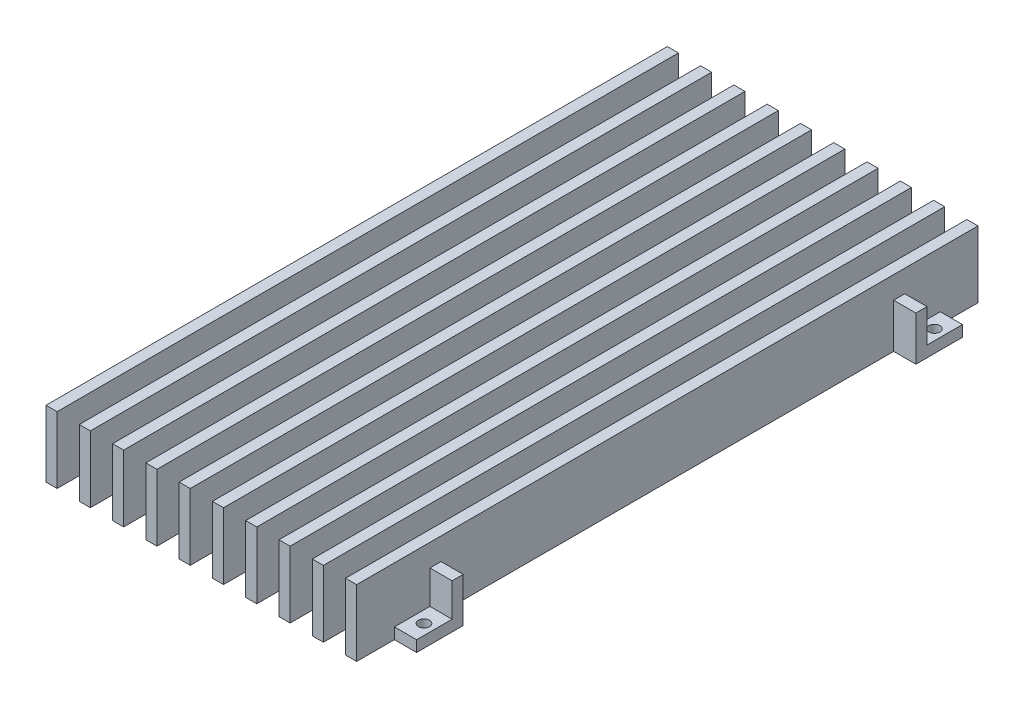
ISO-10303-21;
HEADER;
FILE_DESCRIPTION(('STEP AP214'),'2;1');
FILE_NAME('part.step','',(''),(''),'','','');
FILE_SCHEMA(('AUTOMOTIVE_DESIGN { 1 0 10303 214 1 1 1 1 }'));
ENDSEC;
DATA;
#1=APPLICATION_CONTEXT('core data for automotive mechanical design processes');
#2=APPLICATION_PROTOCOL_DEFINITION('international standard','automotive_design',2000,#1);
#3=PRODUCT_CONTEXT('',#1,'mechanical');
#4=PRODUCT('Part','Part','',(#3));
#5=PRODUCT_RELATED_PRODUCT_CATEGORY('part','',(#4));
#6=PRODUCT_DEFINITION_FORMATION('','',#4);
#7=PRODUCT_DEFINITION_CONTEXT('part definition',#1,'design');
#8=PRODUCT_DEFINITION('design','',#6,#7);
#9=PRODUCT_DEFINITION_SHAPE('','',#8);
#10=(LENGTH_UNIT() NAMED_UNIT(*) SI_UNIT(.MILLI.,.METRE.));
#11=(NAMED_UNIT(*) PLANE_ANGLE_UNIT() SI_UNIT($,.RADIAN.));
#12=(NAMED_UNIT(*) SI_UNIT($,.STERADIAN.) SOLID_ANGLE_UNIT());
#13=UNCERTAINTY_MEASURE_WITH_UNIT(LENGTH_MEASURE(1.E-05),#10,'distance_accuracy_value','');
#14=(GEOMETRIC_REPRESENTATION_CONTEXT(3) GLOBAL_UNCERTAINTY_ASSIGNED_CONTEXT((#13)) GLOBAL_UNIT_ASSIGNED_CONTEXT((#10,
#11,#12)) REPRESENTATION_CONTEXT('',''));
#15=CARTESIAN_POINT('',(0.,0.,0.));
#16=DIRECTION('',(0.,0.,1.));
#17=DIRECTION('',(1.,0.,0.));
#18=AXIS2_PLACEMENT_3D('',#15,#16,#17);
#19=CARTESIAN_POINT('',(87.3125,-9.525,-177.8));
#20=DIRECTION('',(1.,0.,0.));
#21=DIRECTION('',(0.,0.,-1.));
#22=AXIS2_PLACEMENT_3D('',#19,#20,#21);
#23=PLANE('',#22);
#24=DIRECTION('',(0.,0.,-1.));
#25=VECTOR('',#24,1.);
#26=CARTESIAN_POINT('',(87.3125,-6.34999999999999,-10.795));
#27=LINE('',#26,#25);
#28=CARTESIAN_POINT('',(87.3125,-6.34999999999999,-10.795));
#29=VERTEX_POINT('',#28);
#30=CARTESIAN_POINT('',(87.3125,-6.34999999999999,-20.955));
#31=VERTEX_POINT('',#30);
#32=EDGE_CURVE('E1185',#29,#31,#27,.T.);
#33=ORIENTED_EDGE('',*,*,#32,.T.);
#34=DIRECTION('',(0.,1.,0.));
#35=VECTOR('',#34,1.);
#36=CARTESIAN_POINT('',(87.3125,-9.525,-20.955));
#37=LINE('',#36,#35);
#38=CARTESIAN_POINT('',(87.3125,3.17500000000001,-20.955));
#39=VERTEX_POINT('',#38);
#40=EDGE_CURVE('E11',#31,#39,#37,.T.);
#41=ORIENTED_EDGE('',*,*,#40,.T.);
#42=DIRECTION('',(0.,0.,-1.));
#43=VECTOR('',#42,1.);
#44=CARTESIAN_POINT('',(87.3125,3.17499999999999,-177.8));
#45=LINE('',#44,#43);
#46=CARTESIAN_POINT('',(87.3125,3.17500000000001,-24.13));
#47=VERTEX_POINT('',#46);
#48=EDGE_CURVE('E40',#39,#47,#45,.T.);
#49=ORIENTED_EDGE('',*,*,#48,.T.);
#50=DIRECTION('',(0.,-1.,0.));
#51=VECTOR('',#50,1.);
#52=CARTESIAN_POINT('',(87.3125,-9.525,-24.13));
#53=LINE('',#52,#51);
#54=CARTESIAN_POINT('',(87.3125,-9.525,-24.13));
#55=VERTEX_POINT('',#54);
#56=EDGE_CURVE('E1389',#47,#55,#53,.T.);
#57=ORIENTED_EDGE('',*,*,#56,.T.);
#58=DIRECTION('',(0.,0.,1.));
#59=VECTOR('',#58,1.);
#60=CARTESIAN_POINT('',(87.3125,-9.525,-177.8));
#61=LINE('',#60,#59);
#62=CARTESIAN_POINT('',(87.3125,-9.525,-153.67));
#63=VERTEX_POINT('',#62);
#64=EDGE_CURVE('E890',#63,#55,#61,.T.);
#65=ORIENTED_EDGE('',*,*,#64,.F.);
#66=DIRECTION('',(0.,-1.,0.));
#67=VECTOR('',#66,1.);
#68=CARTESIAN_POINT('',(87.3125,-9.525,-153.67));
#69=LINE('',#68,#67);
#70=CARTESIAN_POINT('',(87.3125,3.17499999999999,-153.67));
#71=VERTEX_POINT('',#70);
#72=EDGE_CURVE('E2688',#71,#63,#69,.T.);
#73=ORIENTED_EDGE('',*,*,#72,.F.);
#74=DIRECTION('',(0.,0.,1.));
#75=VECTOR('',#74,1.);
#76=CARTESIAN_POINT('',(87.3125,3.17499999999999,-156.845));
#77=LINE('',#76,#75);
#78=CARTESIAN_POINT('',(87.3125,3.17499999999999,-156.845));
#79=VERTEX_POINT('',#78);
#80=EDGE_CURVE('E905',#79,#71,#77,.T.);
#81=ORIENTED_EDGE('',*,*,#80,.F.);
#82=DIRECTION('',(0.,1.,0.));
#83=VECTOR('',#82,1.);
#84=CARTESIAN_POINT('',(87.3125,-9.525,-156.845));
#85=LINE('',#84,#83);
#86=CARTESIAN_POINT('',(87.3125,-6.34999999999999,-156.845));
#87=VERTEX_POINT('',#86);
#88=EDGE_CURVE('E1384',#87,#79,#85,.T.);
#89=ORIENTED_EDGE('',*,*,#88,.F.);
#90=DIRECTION('',(0.,0.,1.));
#91=VECTOR('',#90,1.);
#92=CARTESIAN_POINT('',(87.3125,-6.34999999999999,-167.005));
#93=LINE('',#92,#91);
#94=CARTESIAN_POINT('',(87.3125,-6.34999999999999,-167.005));
#95=VERTEX_POINT('',#94);
#96=EDGE_CURVE('E1142',#95,#87,#93,.T.);
#97=ORIENTED_EDGE('',*,*,#96,.F.);
#98=DIRECTION('',(0.,1.,0.));
#99=VECTOR('',#98,1.);
#100=CARTESIAN_POINT('',(87.3125,-9.525,-167.005));
#101=LINE('',#100,#99);
#102=CARTESIAN_POINT('',(87.3125,-9.525,-167.005));
#103=VERTEX_POINT('',#102);
#104=EDGE_CURVE('E1158',#103,#95,#101,.T.);
#105=ORIENTED_EDGE('',*,*,#104,.F.);
#106=CARTESIAN_POINT('',(87.3125,-9.525,-177.8));
#107=VERTEX_POINT('',#106);
#108=EDGE_CURVE('E893',#107,#103,#61,.T.);
#109=ORIENTED_EDGE('',*,*,#108,.F.);
#110=DIRECTION('',(0.,1.,0.));
#111=VECTOR('',#110,1.);
#112=CARTESIAN_POINT('',(87.3125,-9.525,-177.8));
#113=LINE('',#112,#111);
#114=CARTESIAN_POINT('',(87.3125,9.525,-177.8));
#115=VERTEX_POINT('',#114);
#116=EDGE_CURVE('E922',#107,#115,#113,.T.);
#117=ORIENTED_EDGE('',*,*,#116,.T.);
#118=DIRECTION('',(0.,0.,1.));
#119=VECTOR('',#118,1.);
#120=CARTESIAN_POINT('',(87.3125,9.525,-177.8));
#121=LINE('',#120,#119);
#122=CARTESIAN_POINT('',(87.3125,9.525,0.));
#123=VERTEX_POINT('',#122);
#124=EDGE_CURVE('E900',#115,#123,#121,.T.);
#125=ORIENTED_EDGE('',*,*,#124,.T.);
#126=DIRECTION('',(0.,1.,0.));
#127=VECTOR('',#126,1.);
#128=CARTESIAN_POINT('',(87.3125,-9.525,0.));
#129=LINE('',#128,#127);
#130=CARTESIAN_POINT('',(87.3125,-9.525,0.));
#131=VERTEX_POINT('',#130);
#132=EDGE_CURVE('E888',#131,#123,#129,.T.);
#133=ORIENTED_EDGE('',*,*,#132,.F.);
#134=CARTESIAN_POINT('',(87.3125,-9.525,-10.795));
#135=VERTEX_POINT('',#134);
#136=EDGE_CURVE('E881',#135,#131,#61,.T.);
#137=ORIENTED_EDGE('',*,*,#136,.F.);
#138=DIRECTION('',(0.,1.,0.));
#139=VECTOR('',#138,1.);
#140=CARTESIAN_POINT('',(87.3125,-9.525,-10.795));
#141=LINE('',#140,#139);
#142=EDGE_CURVE('E865',#135,#29,#141,.T.);
#143=ORIENTED_EDGE('',*,*,#142,.T.);
#144=EDGE_LOOP('',(#33,#41,#49,#57,#65,#73,#81,#89,#97,#105,#109,#117,#125,#133,#137,#143));
#145=FACE_BOUND('',#144,.T.);
#146=ADVANCED_FACE('F32',(#145),#23,.T.);
#147=CARTESIAN_POINT('',(-7.93749999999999,-9.525,-156.845));
#148=DIRECTION('',(0.,0.,1.));
#149=DIRECTION('',(1.,0.,0.));
#150=AXIS2_PLACEMENT_3D('',#147,#148,#149);
#151=PLANE('',#150);
#152=DIRECTION('',(1.,0.,0.));
#153=VECTOR('',#152,1.);
#154=CARTESIAN_POINT('',(87.3125,-6.34999999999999,-156.845));
#155=LINE('',#154,#153);
#156=CARTESIAN_POINT('',(93.6625,-6.34999999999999,-156.845));
#157=VERTEX_POINT('',#156);
#158=EDGE_CURVE('E1156',#87,#157,#155,.T.);
#159=ORIENTED_EDGE('',*,*,#158,.F.);
#160=ORIENTED_EDGE('',*,*,#88,.T.);
#161=DIRECTION('',(1.,0.,0.));
#162=VECTOR('',#161,1.);
#163=CARTESIAN_POINT('',(-7.93749999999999,3.17499999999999,-156.845));
#164=LINE('',#163,#162);
#165=CARTESIAN_POINT('',(93.6625,3.17499999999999,-156.845));
#166=VERTEX_POINT('',#165);
#167=EDGE_CURVE('E1244',#79,#166,#164,.T.);
#168=ORIENTED_EDGE('',*,*,#167,.T.);
#169=DIRECTION('',(0.,-1.,0.));
#170=VECTOR('',#169,1.);
#171=CARTESIAN_POINT('',(93.6625,-9.525,-156.845));
#172=LINE('',#171,#170);
#173=EDGE_CURVE('E1241',#166,#157,#172,.T.);
#174=ORIENTED_EDGE('',*,*,#173,.T.);
#175=EDGE_LOOP('',(#159,#160,#168,#174));
#176=FACE_BOUND('',#175,.T.);
#177=ADVANCED_FACE('F1242',(#176),#151,.F.);
#178=CARTESIAN_POINT('',(-1.5875,-9.525,-177.8));
#179=DIRECTION('',(-1.,0.,0.));
#180=DIRECTION('',(0.,0.,1.));
#181=AXIS2_PLACEMENT_3D('',#178,#179,#180);
#182=PLANE('',#181);
#183=DIRECTION('',(0.,0.,-1.));
#184=VECTOR('',#183,1.);
#185=CARTESIAN_POINT('',(-1.5875,-6.35,-10.795));
#186=LINE('',#185,#184);
#187=CARTESIAN_POINT('',(-1.5875,-6.35,-10.795));
#188=VERTEX_POINT('',#187);
#189=CARTESIAN_POINT('',(-1.5875,-6.35,-20.955));
#190=VERTEX_POINT('',#189);
#191=EDGE_CURVE('E1159',#188,#190,#186,.T.);
#192=ORIENTED_EDGE('',*,*,#191,.F.);
#193=DIRECTION('',(0.,-1.,0.));
#194=VECTOR('',#193,1.);
#195=CARTESIAN_POINT('',(-1.5875,-9.525,-10.795));
#196=LINE('',#195,#194);
#197=CARTESIAN_POINT('',(-1.5875,-9.525,-10.795));
#198=VERTEX_POINT('',#197);
#199=EDGE_CURVE('E1173',#188,#198,#196,.T.);
#200=ORIENTED_EDGE('',*,*,#199,.T.);
#201=DIRECTION('',(0.,0.,1.));
#202=VECTOR('',#201,1.);
#203=CARTESIAN_POINT('',(-1.5875,-9.525,-177.8));
#204=LINE('',#203,#202);
#205=CARTESIAN_POINT('',(-1.5875,-9.525,0.));
#206=VERTEX_POINT('',#205);
#207=EDGE_CURVE('E1309',#198,#206,#204,.T.);
#208=ORIENTED_EDGE('',*,*,#207,.T.);
#209=DIRECTION('',(0.,-1.,0.));
#210=VECTOR('',#209,1.);
#211=CARTESIAN_POINT('',(-1.5875,-9.525,0.));
#212=LINE('',#211,#210);
#213=CARTESIAN_POINT('',(-1.5875,9.525,0.));
#214=VERTEX_POINT('',#213);
#215=EDGE_CURVE('E1295',#214,#206,#212,.T.);
#216=ORIENTED_EDGE('',*,*,#215,.F.);
#217=DIRECTION('',(0.,0.,1.));
#218=VECTOR('',#217,1.);
#219=CARTESIAN_POINT('',(-1.5875,9.525,-177.8));
#220=LINE('',#219,#218);
#221=CARTESIAN_POINT('',(-1.5875,9.525,-177.8));
#222=VERTEX_POINT('',#221);
#223=EDGE_CURVE('E1320',#222,#214,#220,.T.);
#224=ORIENTED_EDGE('',*,*,#223,.F.);
#225=DIRECTION('',(0.,-1.,0.));
#226=VECTOR('',#225,1.);
#227=CARTESIAN_POINT('',(-1.5875,-9.525,-177.8));
#228=LINE('',#227,#226);
#229=CARTESIAN_POINT('',(-1.5875,-9.525,-177.8));
#230=VERTEX_POINT('',#229);
#231=EDGE_CURVE('E1296',#222,#230,#228,.T.);
#232=ORIENTED_EDGE('',*,*,#231,.T.);
#233=CARTESIAN_POINT('',(-1.5875,-9.525,-167.005));
#234=VERTEX_POINT('',#233);
#235=EDGE_CURVE('E1330',#230,#234,#204,.T.);
#236=ORIENTED_EDGE('',*,*,#235,.T.);
#237=DIRECTION('',(0.,-1.,0.));
#238=VECTOR('',#237,1.);
#239=CARTESIAN_POINT('',(-1.5875,-9.525,-167.005));
#240=LINE('',#239,#238);
#241=CARTESIAN_POINT('',(-1.5875,-6.35,-167.005));
#242=VERTEX_POINT('',#241);
#243=EDGE_CURVE('E1141',#242,#234,#240,.T.);
#244=ORIENTED_EDGE('',*,*,#243,.F.);
#245=DIRECTION('',(0.,0.,1.));
#246=VECTOR('',#245,1.);
#247=CARTESIAN_POINT('',(-1.5875,-6.35,-167.005));
#248=LINE('',#247,#246);
#249=CARTESIAN_POINT('',(-1.5875,-6.35,-156.845));
#250=VERTEX_POINT('',#249);
#251=EDGE_CURVE('E1135',#242,#250,#248,.T.);
#252=ORIENTED_EDGE('',*,*,#251,.T.);
#253=DIRECTION('',(0.,1.,0.));
#254=VECTOR('',#253,1.);
#255=CARTESIAN_POINT('',(-1.5875,-9.525,-156.845));
#256=LINE('',#255,#254);
#257=CARTESIAN_POINT('',(-1.5875,3.17499999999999,-156.845));
#258=VERTEX_POINT('',#257);
#259=EDGE_CURVE('E1290',#250,#258,#256,.T.);
#260=ORIENTED_EDGE('',*,*,#259,.T.);
#261=DIRECTION('',(0.,0.,1.));
#262=VECTOR('',#261,1.);
#263=CARTESIAN_POINT('',(-1.5875,3.17499999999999,-177.8));
#264=LINE('',#263,#262);
#265=CARTESIAN_POINT('',(-1.5875,3.17499999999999,-153.67));
#266=VERTEX_POINT('',#265);
#267=EDGE_CURVE('E1292',#258,#266,#264,.T.);
#268=ORIENTED_EDGE('',*,*,#267,.T.);
#269=DIRECTION('',(0.,-1.,0.));
#270=VECTOR('',#269,1.);
#271=CARTESIAN_POINT('',(-1.5875,-9.525,-153.67));
#272=LINE('',#271,#270);
#273=CARTESIAN_POINT('',(-1.5875,-9.525,-153.67));
#274=VERTEX_POINT('',#273);
#275=EDGE_CURVE('E1284',#266,#274,#272,.T.);
#276=ORIENTED_EDGE('',*,*,#275,.T.);
#277=CARTESIAN_POINT('',(-1.5875,-9.52499999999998,-24.13));
#278=VERTEX_POINT('',#277);
#279=EDGE_CURVE('E1333',#274,#278,#204,.T.);
#280=ORIENTED_EDGE('',*,*,#279,.T.);
#281=DIRECTION('',(0.,1.,0.));
#282=VECTOR('',#281,1.);
#283=CARTESIAN_POINT('',(-1.5875,-9.525,-24.13));
#284=LINE('',#283,#282);
#285=CARTESIAN_POINT('',(-1.5875,3.17500000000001,-24.13));
#286=VERTEX_POINT('',#285);
#287=EDGE_CURVE('E1041',#278,#286,#284,.T.);
#288=ORIENTED_EDGE('',*,*,#287,.T.);
#289=DIRECTION('',(0.,0.,1.));
#290=VECTOR('',#289,1.);
#291=CARTESIAN_POINT('',(-1.5875,3.17499999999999,-177.8));
#292=LINE('',#291,#290);
#293=CARTESIAN_POINT('',(-1.5875,3.17500000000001,-20.955));
#294=VERTEX_POINT('',#293);
#295=EDGE_CURVE('E984',#286,#294,#292,.T.);
#296=ORIENTED_EDGE('',*,*,#295,.T.);
#297=DIRECTION('',(0.,-1.,0.));
#298=VECTOR('',#297,1.);
#299=CARTESIAN_POINT('',(-1.5875,-9.525,-20.955));
#300=LINE('',#299,#298);
#301=EDGE_CURVE('E918',#294,#190,#300,.T.);
#302=ORIENTED_EDGE('',*,*,#301,.T.);
#303=EDGE_LOOP('',(#192,#200,#208,#216,#224,#232,#236,#244,#252,#260,#268,#276,#280,#288,#296,#302));
#304=FACE_BOUND('',#303,.T.);
#305=ADVANCED_FACE('F34',(#304),#182,.T.);
#306=DIRECTION('',(1.,0.,0.));
#307=VECTOR('',#306,1.);
#308=CARTESIAN_POINT('',(-1.5875,-6.35,-156.845));
#309=LINE('',#308,#307);
#310=CARTESIAN_POINT('',(-7.93749999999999,-6.35,-156.845));
#311=VERTEX_POINT('',#310);
#312=EDGE_CURVE('E1139',#311,#250,#309,.T.);
#313=ORIENTED_EDGE('',*,*,#312,.F.);
#314=DIRECTION('',(0.,-1.,0.));
#315=VECTOR('',#314,1.);
#316=CARTESIAN_POINT('',(-7.93749999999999,-9.525,-156.845));
#317=LINE('',#316,#315);
#318=CARTESIAN_POINT('',(-7.93749999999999,3.17499999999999,-156.845));
#319=VERTEX_POINT('',#318);
#320=EDGE_CURVE('E1263',#319,#311,#317,.T.);
#321=ORIENTED_EDGE('',*,*,#320,.F.);
#322=EDGE_CURVE('E1264',#319,#258,#164,.T.);
#323=ORIENTED_EDGE('',*,*,#322,.T.);
#324=ORIENTED_EDGE('',*,*,#259,.F.);
#325=EDGE_LOOP('',(#313,#321,#323,#324));
#326=FACE_BOUND('',#325,.T.);
#327=ADVANCED_FACE('F1538',(#326),#151,.F.);
#328=CARTESIAN_POINT('',(1.5875,-9.525,-177.8));
#329=DIRECTION('',(1.,0.,0.));
#330=DIRECTION('',(0.,0.,-1.));
#331=AXIS2_PLACEMENT_3D('',#328,#329,#330);
#332=PLANE('',#331);
#333=DIRECTION('',(0.,0.,1.));
#334=VECTOR('',#333,1.);
#335=CARTESIAN_POINT('',(1.5875,-9.525,-177.8));
#336=LINE('',#335,#334);
#337=CARTESIAN_POINT('',(1.5875,-9.52499999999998,-20.955));
#338=VERTEX_POINT('',#337);
#339=CARTESIAN_POINT('',(1.5875,-9.525,0.));
#340=VERTEX_POINT('',#339);
#341=EDGE_CURVE('E1329',#338,#340,#336,.T.);
#342=ORIENTED_EDGE('',*,*,#341,.F.);
#343=DIRECTION('',(0.,1.,0.));
#344=VECTOR('',#343,1.);
#345=CARTESIAN_POINT('',(1.5875,-9.525,-20.955));
#346=LINE('',#345,#344);
#347=CARTESIAN_POINT('',(1.5875,3.17500000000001,-20.955));
#348=VERTEX_POINT('',#347);
#349=EDGE_CURVE('E930',#338,#348,#346,.T.);
#350=ORIENTED_EDGE('',*,*,#349,.T.);
#351=DIRECTION('',(0.,0.,-1.));
#352=VECTOR('',#351,1.);
#353=CARTESIAN_POINT('',(1.5875,3.17499999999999,-177.8));
#354=LINE('',#353,#352);
#355=CARTESIAN_POINT('',(1.5875,3.17500000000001,-24.13));
#356=VERTEX_POINT('',#355);
#357=EDGE_CURVE('E987',#348,#356,#354,.T.);
#358=ORIENTED_EDGE('',*,*,#357,.T.);
#359=DIRECTION('',(0.,-1.,0.));
#360=VECTOR('',#359,1.);
#361=CARTESIAN_POINT('',(1.5875,-9.525,-24.13));
#362=LINE('',#361,#360);
#363=CARTESIAN_POINT('',(1.5875,-9.525,-24.13));
#364=VERTEX_POINT('',#363);
#365=EDGE_CURVE('E1044',#356,#364,#362,.T.);
#366=ORIENTED_EDGE('',*,*,#365,.T.);
#367=CARTESIAN_POINT('',(1.5875,-9.525,-153.67));
#368=VERTEX_POINT('',#367);
#369=EDGE_CURVE('E1328',#368,#364,#336,.T.);
#370=ORIENTED_EDGE('',*,*,#369,.F.);
#371=DIRECTION('',(0.,1.,0.));
#372=VECTOR('',#371,1.);
#373=CARTESIAN_POINT('',(1.5875,-9.525,-153.67));
#374=LINE('',#373,#372);
#375=CARTESIAN_POINT('',(1.5875,3.17499999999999,-153.67));
#376=VERTEX_POINT('',#375);
#377=EDGE_CURVE('E1281',#368,#376,#374,.T.);
#378=ORIENTED_EDGE('',*,*,#377,.T.);
#379=DIRECTION('',(0.,0.,-1.));
#380=VECTOR('',#379,1.);
#381=CARTESIAN_POINT('',(1.5875,3.17499999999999,-177.8));
#382=LINE('',#381,#380);
#383=CARTESIAN_POINT('',(1.5875,3.17499999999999,-156.845));
#384=VERTEX_POINT('',#383);
#385=EDGE_CURVE('E1322',#376,#384,#382,.T.);
#386=ORIENTED_EDGE('',*,*,#385,.T.);
#387=DIRECTION('',(0.,-1.,0.));
#388=VECTOR('',#387,1.);
#389=CARTESIAN_POINT('',(1.5875,-9.525,-156.845));
#390=LINE('',#389,#388);
#391=CARTESIAN_POINT('',(1.5875,-9.525,-156.845));
#392=VERTEX_POINT('',#391);
#393=EDGE_CURVE('E1287',#384,#392,#390,.T.);
#394=ORIENTED_EDGE('',*,*,#393,.T.);
#395=CARTESIAN_POINT('',(1.5875,-9.525,-177.8));
#396=VERTEX_POINT('',#395);
#397=EDGE_CURVE('E1325',#396,#392,#336,.T.);
#398=ORIENTED_EDGE('',*,*,#397,.F.);
#399=DIRECTION('',(0.,1.,0.));
#400=VECTOR('',#399,1.);
#401=CARTESIAN_POINT('',(1.5875,-9.525,-177.8));
#402=LINE('',#401,#400);
#403=CARTESIAN_POINT('',(1.5875,9.525,-177.8));
#404=VERTEX_POINT('',#403);
#405=EDGE_CURVE('E1303',#396,#404,#402,.T.);
#406=ORIENTED_EDGE('',*,*,#405,.T.);
#407=DIRECTION('',(0.,0.,1.));
#408=VECTOR('',#407,1.);
#409=CARTESIAN_POINT('',(1.5875,9.525,-177.8));
#410=LINE('',#409,#408);
#411=CARTESIAN_POINT('',(1.5875,9.525,0.));
#412=VERTEX_POINT('',#411);
#413=EDGE_CURVE('E1323',#404,#412,#410,.T.);
#414=ORIENTED_EDGE('',*,*,#413,.T.);
#415=DIRECTION('',(0.,1.,0.));
#416=VECTOR('',#415,1.);
#417=CARTESIAN_POINT('',(1.5875,-9.525,0.));
#418=LINE('',#417,#416);
#419=EDGE_CURVE('E1315',#340,#412,#418,.T.);
#420=ORIENTED_EDGE('',*,*,#419,.F.);
#421=EDGE_LOOP('',(#342,#350,#358,#366,#370,#378,#386,#394,#398,#406,#414,#420));
#422=FACE_BOUND('',#421,.T.);
#423=ADVANCED_FACE('F1708',(#422),#332,.T.);
#424=CARTESIAN_POINT('',(7.9375,-9.525,-177.8));
#425=DIRECTION('',(-1.,0.,0.));
#426=DIRECTION('',(0.,0.,1.));
#427=AXIS2_PLACEMENT_3D('',#424,#425,#426);
#428=PLANE('',#427);
#429=DIRECTION('',(0.,0.,1.));
#430=VECTOR('',#429,1.);
#431=CARTESIAN_POINT('',(7.9375,3.17499999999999,-177.8));
#432=LINE('',#431,#430);
#433=CARTESIAN_POINT('',(7.9375,3.17500000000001,-24.13));
#434=VERTEX_POINT('',#433);
#435=CARTESIAN_POINT('',(7.9375,3.17500000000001,-20.955));
#436=VERTEX_POINT('',#435);
#437=EDGE_CURVE('E990',#434,#436,#432,.T.);
#438=ORIENTED_EDGE('',*,*,#437,.T.);
#439=DIRECTION('',(0.,-1.,0.));
#440=VECTOR('',#439,1.);
#441=CARTESIAN_POINT('',(7.9375,-9.525,-20.955));
#442=LINE('',#441,#440);
#443=CARTESIAN_POINT('',(7.9375,-9.52499999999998,-20.955));
#444=VERTEX_POINT('',#443);
#445=EDGE_CURVE('E933',#436,#444,#442,.T.);
#446=ORIENTED_EDGE('',*,*,#445,.T.);
#447=DIRECTION('',(0.,0.,1.));
#448=VECTOR('',#447,1.);
#449=CARTESIAN_POINT('',(7.9375,-9.525,-177.8));
#450=LINE('',#449,#448);
#451=CARTESIAN_POINT('',(7.9375,-9.525,0.));
#452=VERTEX_POINT('',#451);
#453=EDGE_CURVE('E2315',#444,#452,#450,.T.);
#454=ORIENTED_EDGE('',*,*,#453,.T.);
#455=DIRECTION('',(0.,-1.,0.));
#456=VECTOR('',#455,1.);
#457=CARTESIAN_POINT('',(7.9375,-9.525,0.));
#458=LINE('',#457,#456);
#459=CARTESIAN_POINT('',(7.9375,9.525,0.));
#460=VERTEX_POINT('',#459);
#461=EDGE_CURVE('E2332',#460,#452,#458,.T.);
#462=ORIENTED_EDGE('',*,*,#461,.F.);
#463=DIRECTION('',(0.,0.,1.));
#464=VECTOR('',#463,1.);
#465=CARTESIAN_POINT('',(7.9375,9.525,-177.8));
#466=LINE('',#465,#464);
#467=CARTESIAN_POINT('',(7.9375,9.525,-177.8));
#468=VERTEX_POINT('',#467);
#469=EDGE_CURVE('E2311',#468,#460,#466,.T.);
#470=ORIENTED_EDGE('',*,*,#469,.F.);
#471=DIRECTION('',(0.,-1.,0.));
#472=VECTOR('',#471,1.);
#473=CARTESIAN_POINT('',(7.9375,-9.525,-177.8));
#474=LINE('',#473,#472);
#475=CARTESIAN_POINT('',(7.9375,-9.525,-177.8));
#476=VERTEX_POINT('',#475);
#477=EDGE_CURVE('E2325',#468,#476,#474,.T.);
#478=ORIENTED_EDGE('',*,*,#477,.T.);
#479=CARTESIAN_POINT('',(7.9375,-9.525,-156.845));
#480=VERTEX_POINT('',#479);
#481=EDGE_CURVE('E2312',#476,#480,#450,.T.);
#482=ORIENTED_EDGE('',*,*,#481,.T.);
#483=DIRECTION('',(0.,-1.,0.));
#484=VECTOR('',#483,1.);
#485=CARTESIAN_POINT('',(7.9375,-9.525,-156.845));
#486=LINE('',#485,#484);
#487=CARTESIAN_POINT('',(7.9375,3.17499999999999,-156.845));
#488=VERTEX_POINT('',#487);
#489=EDGE_CURVE('E1339',#488,#480,#486,.T.);
#490=ORIENTED_EDGE('',*,*,#489,.F.);
#491=DIRECTION('',(0.,0.,-1.));
#492=VECTOR('',#491,1.);
#493=CARTESIAN_POINT('',(7.9375,3.17499999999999,-156.845));
#494=LINE('',#493,#492);
#495=CARTESIAN_POINT('',(7.9375,3.17499999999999,-153.67));
#496=VERTEX_POINT('',#495);
#497=EDGE_CURVE('E1253',#496,#488,#494,.T.);
#498=ORIENTED_EDGE('',*,*,#497,.F.);
#499=DIRECTION('',(0.,1.,0.));
#500=VECTOR('',#499,1.);
#501=CARTESIAN_POINT('',(7.9375,-9.525,-153.67));
#502=LINE('',#501,#500);
#503=CARTESIAN_POINT('',(7.9375,-9.525,-153.67));
#504=VERTEX_POINT('',#503);
#505=EDGE_CURVE('E1247',#504,#496,#502,.T.);
#506=ORIENTED_EDGE('',*,*,#505,.F.);
#507=CARTESIAN_POINT('',(7.9375,-9.52499999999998,-24.13));
#508=VERTEX_POINT('',#507);
#509=EDGE_CURVE('E1455',#504,#508,#450,.T.);
#510=ORIENTED_EDGE('',*,*,#509,.T.);
#511=DIRECTION('',(0.,1.,0.));
#512=VECTOR('',#511,1.);
#513=CARTESIAN_POINT('',(7.9375,-9.525,-24.13));
#514=LINE('',#513,#512);
#515=EDGE_CURVE('E1047',#508,#434,#514,.T.);
#516=ORIENTED_EDGE('',*,*,#515,.T.);
#517=EDGE_LOOP('',(#438,#446,#454,#462,#470,#478,#482,#490,#498,#506,#510,#516));
#518=FACE_BOUND('',#517,.T.);
#519=ADVANCED_FACE('F1451',(#518),#428,.T.);
#520=CARTESIAN_POINT('',(11.1125,-9.525,-177.8));
#521=DIRECTION('',(1.,0.,0.));
#522=DIRECTION('',(0.,0.,-1.));
#523=AXIS2_PLACEMENT_3D('',#520,#521,#522);
#524=PLANE('',#523);
#525=DIRECTION('',(0.,0.,1.));
#526=VECTOR('',#525,1.);
#527=CARTESIAN_POINT('',(11.1125,-9.525,-177.8));
#528=LINE('',#527,#526);
#529=CARTESIAN_POINT('',(11.1125,-9.52499999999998,-20.955));
#530=VERTEX_POINT('',#529);
#531=CARTESIAN_POINT('',(11.1125,-9.525,0.));
#532=VERTEX_POINT('',#531);
#533=EDGE_CURVE('E2314',#530,#532,#528,.T.);
#534=ORIENTED_EDGE('',*,*,#533,.F.);
#535=DIRECTION('',(0.,1.,0.));
#536=VECTOR('',#535,1.);
#537=CARTESIAN_POINT('',(11.1125,-9.525,-20.955));
#538=LINE('',#537,#536);
#539=CARTESIAN_POINT('',(11.1125,3.17500000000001,-20.955));
#540=VERTEX_POINT('',#539);
#541=EDGE_CURVE('E936',#530,#540,#538,.T.);
#542=ORIENTED_EDGE('',*,*,#541,.T.);
#543=DIRECTION('',(0.,0.,-1.));
#544=VECTOR('',#543,1.);
#545=CARTESIAN_POINT('',(11.1125,3.17499999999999,-177.8));
#546=LINE('',#545,#544);
#547=CARTESIAN_POINT('',(11.1125,3.17500000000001,-24.13));
#548=VERTEX_POINT('',#547);
#549=EDGE_CURVE('E993',#540,#548,#546,.T.);
#550=ORIENTED_EDGE('',*,*,#549,.T.);
#551=DIRECTION('',(0.,-1.,0.));
#552=VECTOR('',#551,1.);
#553=CARTESIAN_POINT('',(11.1125,-9.525,-24.13));
#554=LINE('',#553,#552);
#555=CARTESIAN_POINT('',(11.1125,-9.525,-24.13));
#556=VERTEX_POINT('',#555);
#557=EDGE_CURVE('E1050',#548,#556,#554,.T.);
#558=ORIENTED_EDGE('',*,*,#557,.T.);
#559=CARTESIAN_POINT('',(11.1125,-9.525,-153.67));
#560=VERTEX_POINT('',#559);
#561=EDGE_CURVE('E2319',#560,#556,#528,.T.);
#562=ORIENTED_EDGE('',*,*,#561,.F.);
#563=DIRECTION('',(0.,-1.,0.));
#564=VECTOR('',#563,1.);
#565=CARTESIAN_POINT('',(11.1125,-9.525,-153.67));
#566=LINE('',#565,#564);
#567=CARTESIAN_POINT('',(11.1125,3.17499999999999,-153.67));
#568=VERTEX_POINT('',#567);
#569=EDGE_CURVE('E2304',#568,#560,#566,.T.);
#570=ORIENTED_EDGE('',*,*,#569,.F.);
#571=DIRECTION('',(0.,0.,1.));
#572=VECTOR('',#571,1.);
#573=CARTESIAN_POINT('',(11.1125,3.17499999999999,-156.845));
#574=LINE('',#573,#572);
#575=CARTESIAN_POINT('',(11.1125,3.17499999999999,-156.845));
#576=VERTEX_POINT('',#575);
#577=EDGE_CURVE('E2306',#576,#568,#574,.T.);
#578=ORIENTED_EDGE('',*,*,#577,.F.);
#579=DIRECTION('',(0.,1.,0.));
#580=VECTOR('',#579,1.);
#581=CARTESIAN_POINT('',(11.1125,-9.525,-156.845));
#582=LINE('',#581,#580);
#583=CARTESIAN_POINT('',(11.1125,-9.525,-156.845));
#584=VERTEX_POINT('',#583);
#585=EDGE_CURVE('E1336',#584,#576,#582,.T.);
#586=ORIENTED_EDGE('',*,*,#585,.F.);
#587=CARTESIAN_POINT('',(11.1125,-9.525,-177.8));
#588=VERTEX_POINT('',#587);
#589=EDGE_CURVE('E2316',#588,#584,#528,.T.);
#590=ORIENTED_EDGE('',*,*,#589,.F.);
#591=DIRECTION('',(0.,1.,0.));
#592=VECTOR('',#591,1.);
#593=CARTESIAN_POINT('',(11.1125,-9.525,-177.8));
#594=LINE('',#593,#592);
#595=CARTESIAN_POINT('',(11.1125,9.525,-177.8));
#596=VERTEX_POINT('',#595);
#597=EDGE_CURVE('E2339',#588,#596,#594,.T.);
#598=ORIENTED_EDGE('',*,*,#597,.T.);
#599=DIRECTION('',(0.,0.,1.));
#600=VECTOR('',#599,1.);
#601=CARTESIAN_POINT('',(11.1125,9.525,-177.8));
#602=LINE('',#601,#600);
#603=CARTESIAN_POINT('',(11.1125,9.525,0.));
#604=VERTEX_POINT('',#603);
#605=EDGE_CURVE('E2318',#596,#604,#602,.T.);
#606=ORIENTED_EDGE('',*,*,#605,.T.);
#607=DIRECTION('',(0.,1.,0.));
#608=VECTOR('',#607,1.);
#609=CARTESIAN_POINT('',(11.1125,-9.525,0.));
#610=LINE('',#609,#608);
#611=EDGE_CURVE('E2326',#532,#604,#610,.T.);
#612=ORIENTED_EDGE('',*,*,#611,.F.);
#613=EDGE_LOOP('',(#534,#542,#550,#558,#562,#570,#578,#586,#590,#598,#606,#612));
#614=FACE_BOUND('',#613,.T.);
#615=ADVANCED_FACE('F1689',(#614),#524,.T.);
#616=CARTESIAN_POINT('',(17.4625,-9.525,-177.8));
#617=DIRECTION('',(-1.,0.,0.));
#618=DIRECTION('',(0.,0.,1.));
#619=AXIS2_PLACEMENT_3D('',#616,#617,#618);
#620=PLANE('',#619);
#621=DIRECTION('',(0.,0.,1.));
#622=VECTOR('',#621,1.);
#623=CARTESIAN_POINT('',(17.4625,3.17499999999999,-177.8));
#624=LINE('',#623,#622);
#625=CARTESIAN_POINT('',(17.4625,3.17500000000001,-24.13));
#626=VERTEX_POINT('',#625);
#627=CARTESIAN_POINT('',(17.4625,3.17500000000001,-20.955));
#628=VERTEX_POINT('',#627);
#629=EDGE_CURVE('E996',#626,#628,#624,.T.);
#630=ORIENTED_EDGE('',*,*,#629,.T.);
#631=DIRECTION('',(0.,-1.,0.));
#632=VECTOR('',#631,1.);
#633=CARTESIAN_POINT('',(17.4625,-9.525,-20.955));
#634=LINE('',#633,#632);
#635=CARTESIAN_POINT('',(17.4625,-9.52499999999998,-20.955));
#636=VERTEX_POINT('',#635);
#637=EDGE_CURVE('E939',#628,#636,#634,.T.);
#638=ORIENTED_EDGE('',*,*,#637,.T.);
#639=DIRECTION('',(0.,0.,1.));
#640=VECTOR('',#639,1.);
#641=CARTESIAN_POINT('',(17.4625,-9.525,-177.8));
#642=LINE('',#641,#640);
#643=CARTESIAN_POINT('',(17.4625,-9.525,0.));
#644=VERTEX_POINT('',#643);
#645=EDGE_CURVE('E2363',#636,#644,#642,.T.);
#646=ORIENTED_EDGE('',*,*,#645,.T.);
#647=DIRECTION('',(0.,-1.,0.));
#648=VECTOR('',#647,1.);
#649=CARTESIAN_POINT('',(17.4625,-9.525,0.));
#650=LINE('',#649,#648);
#651=CARTESIAN_POINT('',(17.4625,9.525,0.));
#652=VERTEX_POINT('',#651);
#653=EDGE_CURVE('E2380',#652,#644,#650,.T.);
#654=ORIENTED_EDGE('',*,*,#653,.F.);
#655=DIRECTION('',(0.,0.,1.));
#656=VECTOR('',#655,1.);
#657=CARTESIAN_POINT('',(17.4625,9.525,-177.8));
#658=LINE('',#657,#656);
#659=CARTESIAN_POINT('',(17.4625,9.525,-177.8));
#660=VERTEX_POINT('',#659);
#661=EDGE_CURVE('E2358',#660,#652,#658,.T.);
#662=ORIENTED_EDGE('',*,*,#661,.F.);
#663=DIRECTION('',(0.,-1.,0.));
#664=VECTOR('',#663,1.);
#665=CARTESIAN_POINT('',(17.4625,-9.525,-177.8));
#666=LINE('',#665,#664);
#667=CARTESIAN_POINT('',(17.4625,-9.525,-177.8));
#668=VERTEX_POINT('',#667);
#669=EDGE_CURVE('E2373',#660,#668,#666,.T.);
#670=ORIENTED_EDGE('',*,*,#669,.T.);
#671=CARTESIAN_POINT('',(17.4625,-9.525,-156.845));
#672=VERTEX_POINT('',#671);
#673=EDGE_CURVE('E2359',#668,#672,#642,.T.);
#674=ORIENTED_EDGE('',*,*,#673,.T.);
#675=DIRECTION('',(0.,-1.,0.));
#676=VECTOR('',#675,1.);
#677=CARTESIAN_POINT('',(17.4625,-9.525,-156.845));
#678=LINE('',#677,#676);
#679=CARTESIAN_POINT('',(17.4625,3.17499999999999,-156.845));
#680=VERTEX_POINT('',#679);
#681=EDGE_CURVE('E1345',#680,#672,#678,.T.);
#682=ORIENTED_EDGE('',*,*,#681,.F.);
#683=DIRECTION('',(0.,0.,-1.));
#684=VECTOR('',#683,1.);
#685=CARTESIAN_POINT('',(17.4625,3.17499999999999,-156.845));
#686=LINE('',#685,#684);
#687=CARTESIAN_POINT('',(17.4625,3.17499999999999,-153.67));
#688=VERTEX_POINT('',#687);
#689=EDGE_CURVE('E2349',#688,#680,#686,.T.);
#690=ORIENTED_EDGE('',*,*,#689,.F.);
#691=DIRECTION('',(0.,1.,0.));
#692=VECTOR('',#691,1.);
#693=CARTESIAN_POINT('',(17.4625,-9.525,-153.67));
#694=LINE('',#693,#692);
#695=CARTESIAN_POINT('',(17.4625,-9.525,-153.67));
#696=VERTEX_POINT('',#695);
#697=EDGE_CURVE('E2335',#696,#688,#694,.T.);
#698=ORIENTED_EDGE('',*,*,#697,.F.);
#699=CARTESIAN_POINT('',(17.4625,-9.52499999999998,-24.13));
#700=VERTEX_POINT('',#699);
#701=EDGE_CURVE('E2362',#696,#700,#642,.T.);
#702=ORIENTED_EDGE('',*,*,#701,.T.);
#703=DIRECTION('',(0.,1.,0.));
#704=VECTOR('',#703,1.);
#705=CARTESIAN_POINT('',(17.4625,-9.525,-24.13));
#706=LINE('',#705,#704);
#707=EDGE_CURVE('E1053',#700,#626,#706,.T.);
#708=ORIENTED_EDGE('',*,*,#707,.T.);
#709=EDGE_LOOP('',(#630,#638,#646,#654,#662,#670,#674,#682,#690,#698,#702,#708));
#710=FACE_BOUND('',#709,.T.);
#711=ADVANCED_FACE('F1685',(#710),#620,.T.);
#712=CARTESIAN_POINT('',(20.6375,-9.525,-177.8));
#713=DIRECTION('',(1.,0.,0.));
#714=DIRECTION('',(0.,0.,-1.));
#715=AXIS2_PLACEMENT_3D('',#712,#713,#714);
#716=PLANE('',#715);
#717=DIRECTION('',(0.,0.,1.));
#718=VECTOR('',#717,1.);
#719=CARTESIAN_POINT('',(20.6375,-9.525,-177.8));
#720=LINE('',#719,#718);
#721=CARTESIAN_POINT('',(20.6375,-9.52499999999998,-20.955));
#722=VERTEX_POINT('',#721);
#723=CARTESIAN_POINT('',(20.6375,-9.525,0.));
#724=VERTEX_POINT('',#723);
#725=EDGE_CURVE('E2361',#722,#724,#720,.T.);
#726=ORIENTED_EDGE('',*,*,#725,.F.);
#727=DIRECTION('',(0.,1.,0.));
#728=VECTOR('',#727,1.);
#729=CARTESIAN_POINT('',(20.6375,-9.525,-20.955));
#730=LINE('',#729,#728);
#731=CARTESIAN_POINT('',(20.6375,3.17500000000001,-20.955));
#732=VERTEX_POINT('',#731);
#733=EDGE_CURVE('E942',#722,#732,#730,.T.);
#734=ORIENTED_EDGE('',*,*,#733,.T.);
#735=DIRECTION('',(0.,0.,-1.));
#736=VECTOR('',#735,1.);
#737=CARTESIAN_POINT('',(20.6375,3.17499999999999,-177.8));
#738=LINE('',#737,#736);
#739=CARTESIAN_POINT('',(20.6375,3.17500000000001,-24.13));
#740=VERTEX_POINT('',#739);
#741=EDGE_CURVE('E999',#732,#740,#738,.T.);
#742=ORIENTED_EDGE('',*,*,#741,.T.);
#743=DIRECTION('',(0.,-1.,0.));
#744=VECTOR('',#743,1.);
#745=CARTESIAN_POINT('',(20.6375,-9.525,-24.13));
#746=LINE('',#745,#744);
#747=CARTESIAN_POINT('',(20.6375,-9.525,-24.13));
#748=VERTEX_POINT('',#747);
#749=EDGE_CURVE('E1056',#740,#748,#746,.T.);
#750=ORIENTED_EDGE('',*,*,#749,.T.);
#751=CARTESIAN_POINT('',(20.6375,-9.525,-153.67));
#752=VERTEX_POINT('',#751);
#753=EDGE_CURVE('E2367',#752,#748,#720,.T.);
#754=ORIENTED_EDGE('',*,*,#753,.F.);
#755=DIRECTION('',(0.,-1.,0.));
#756=VECTOR('',#755,1.);
#757=CARTESIAN_POINT('',(20.6375,-9.525,-153.67));
#758=LINE('',#757,#756);
#759=CARTESIAN_POINT('',(20.6375,3.17499999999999,-153.67));
#760=VERTEX_POINT('',#759);
#761=EDGE_CURVE('E2352',#760,#752,#758,.T.);
#762=ORIENTED_EDGE('',*,*,#761,.F.);
#763=DIRECTION('',(0.,0.,1.));
#764=VECTOR('',#763,1.);
#765=CARTESIAN_POINT('',(20.6375,3.17499999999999,-156.845));
#766=LINE('',#765,#764);
#767=CARTESIAN_POINT('',(20.6375,3.17499999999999,-156.845));
#768=VERTEX_POINT('',#767);
#769=EDGE_CURVE('E2355',#768,#760,#766,.T.);
#770=ORIENTED_EDGE('',*,*,#769,.F.);
#771=DIRECTION('',(0.,1.,0.));
#772=VECTOR('',#771,1.);
#773=CARTESIAN_POINT('',(20.6375,-9.525,-156.845));
#774=LINE('',#773,#772);
#775=CARTESIAN_POINT('',(20.6375,-9.525,-156.845));
#776=VERTEX_POINT('',#775);
#777=EDGE_CURVE('E1342',#776,#768,#774,.T.);
#778=ORIENTED_EDGE('',*,*,#777,.F.);
#779=CARTESIAN_POINT('',(20.6375,-9.525,-177.8));
#780=VERTEX_POINT('',#779);
#781=EDGE_CURVE('E2364',#780,#776,#720,.T.);
#782=ORIENTED_EDGE('',*,*,#781,.F.);
#783=DIRECTION('',(0.,1.,0.));
#784=VECTOR('',#783,1.);
#785=CARTESIAN_POINT('',(20.6375,-9.525,-177.8));
#786=LINE('',#785,#784);
#787=CARTESIAN_POINT('',(20.6375,9.525,-177.8));
#788=VERTEX_POINT('',#787);
#789=EDGE_CURVE('E2387',#780,#788,#786,.T.);
#790=ORIENTED_EDGE('',*,*,#789,.T.);
#791=DIRECTION('',(0.,0.,1.));
#792=VECTOR('',#791,1.);
#793=CARTESIAN_POINT('',(20.6375,9.525,-177.8));
#794=LINE('',#793,#792);
#795=CARTESIAN_POINT('',(20.6375,9.525,0.));
#796=VERTEX_POINT('',#795);
#797=EDGE_CURVE('E2366',#788,#796,#794,.T.);
#798=ORIENTED_EDGE('',*,*,#797,.T.);
#799=DIRECTION('',(0.,1.,0.));
#800=VECTOR('',#799,1.);
#801=CARTESIAN_POINT('',(20.6375,-9.525,0.));
#802=LINE('',#801,#800);
#803=EDGE_CURVE('E2374',#724,#796,#802,.T.);
#804=ORIENTED_EDGE('',*,*,#803,.F.);
#805=EDGE_LOOP('',(#726,#734,#742,#750,#754,#762,#770,#778,#782,#790,#798,#804));
#806=FACE_BOUND('',#805,.T.);
#807=ADVANCED_FACE('F1669',(#806),#716,.T.);
#808=CARTESIAN_POINT('',(26.9875,-9.525,-177.8));
#809=DIRECTION('',(-1.,0.,0.));
#810=DIRECTION('',(0.,0.,1.));
#811=AXIS2_PLACEMENT_3D('',#808,#809,#810);
#812=PLANE('',#811);
#813=DIRECTION('',(0.,0.,1.));
#814=VECTOR('',#813,1.);
#815=CARTESIAN_POINT('',(26.9875,3.17499999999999,-177.8));
#816=LINE('',#815,#814);
#817=CARTESIAN_POINT('',(26.9875,3.17500000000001,-24.13));
#818=VERTEX_POINT('',#817);
#819=CARTESIAN_POINT('',(26.9875,3.17500000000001,-20.955));
#820=VERTEX_POINT('',#819);
#821=EDGE_CURVE('E1002',#818,#820,#816,.T.);
#822=ORIENTED_EDGE('',*,*,#821,.T.);
#823=DIRECTION('',(0.,-1.,0.));
#824=VECTOR('',#823,1.);
#825=CARTESIAN_POINT('',(26.9875,-9.525,-20.955));
#826=LINE('',#825,#824);
#827=CARTESIAN_POINT('',(26.9875,-9.52499999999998,-20.955));
#828=VERTEX_POINT('',#827);
#829=EDGE_CURVE('E945',#820,#828,#826,.T.);
#830=ORIENTED_EDGE('',*,*,#829,.T.);
#831=DIRECTION('',(0.,0.,1.));
#832=VECTOR('',#831,1.);
#833=CARTESIAN_POINT('',(26.9875,-9.525,-177.8));
#834=LINE('',#833,#832);
#835=CARTESIAN_POINT('',(26.9875,-9.525,0.));
#836=VERTEX_POINT('',#835);
#837=EDGE_CURVE('E2411',#828,#836,#834,.T.);
#838=ORIENTED_EDGE('',*,*,#837,.T.);
#839=DIRECTION('',(0.,-1.,0.));
#840=VECTOR('',#839,1.);
#841=CARTESIAN_POINT('',(26.9875,-9.525,0.));
#842=LINE('',#841,#840);
#843=CARTESIAN_POINT('',(26.9875,9.525,0.));
#844=VERTEX_POINT('',#843);
#845=EDGE_CURVE('E2428',#844,#836,#842,.T.);
#846=ORIENTED_EDGE('',*,*,#845,.F.);
#847=DIRECTION('',(0.,0.,1.));
#848=VECTOR('',#847,1.);
#849=CARTESIAN_POINT('',(26.9875,9.525,-177.8));
#850=LINE('',#849,#848);
#851=CARTESIAN_POINT('',(26.9875,9.525,-177.8));
#852=VERTEX_POINT('',#851);
#853=EDGE_CURVE('E2406',#852,#844,#850,.T.);
#854=ORIENTED_EDGE('',*,*,#853,.F.);
#855=DIRECTION('',(0.,-1.,0.));
#856=VECTOR('',#855,1.);
#857=CARTESIAN_POINT('',(26.9875,-9.525,-177.8));
#858=LINE('',#857,#856);
#859=CARTESIAN_POINT('',(26.9875,-9.525,-177.8));
#860=VERTEX_POINT('',#859);
#861=EDGE_CURVE('E2421',#852,#860,#858,.T.);
#862=ORIENTED_EDGE('',*,*,#861,.T.);
#863=CARTESIAN_POINT('',(26.9875,-9.525,-156.845));
#864=VERTEX_POINT('',#863);
#865=EDGE_CURVE('E2407',#860,#864,#834,.T.);
#866=ORIENTED_EDGE('',*,*,#865,.T.);
#867=DIRECTION('',(0.,-1.,0.));
#868=VECTOR('',#867,1.);
#869=CARTESIAN_POINT('',(26.9875,-9.525,-156.845));
#870=LINE('',#869,#868);
#871=CARTESIAN_POINT('',(26.9875,3.17499999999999,-156.845));
#872=VERTEX_POINT('',#871);
#873=EDGE_CURVE('E1351',#872,#864,#870,.T.);
#874=ORIENTED_EDGE('',*,*,#873,.F.);
#875=DIRECTION('',(0.,0.,-1.));
#876=VECTOR('',#875,1.);
#877=CARTESIAN_POINT('',(26.9875,3.17499999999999,-156.845));
#878=LINE('',#877,#876);
#879=CARTESIAN_POINT('',(26.9875,3.17499999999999,-153.67));
#880=VERTEX_POINT('',#879);
#881=EDGE_CURVE('E2397',#880,#872,#878,.T.);
#882=ORIENTED_EDGE('',*,*,#881,.F.);
#883=DIRECTION('',(0.,1.,0.));
#884=VECTOR('',#883,1.);
#885=CARTESIAN_POINT('',(26.9875,-9.525,-153.67));
#886=LINE('',#885,#884);
#887=CARTESIAN_POINT('',(26.9875,-9.525,-153.67));
#888=VERTEX_POINT('',#887);
#889=EDGE_CURVE('E2383',#888,#880,#886,.T.);
#890=ORIENTED_EDGE('',*,*,#889,.F.);
#891=CARTESIAN_POINT('',(26.9875,-9.52499999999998,-24.13));
#892=VERTEX_POINT('',#891);
#893=EDGE_CURVE('E2410',#888,#892,#834,.T.);
#894=ORIENTED_EDGE('',*,*,#893,.T.);
#895=DIRECTION('',(0.,1.,0.));
#896=VECTOR('',#895,1.);
#897=CARTESIAN_POINT('',(26.9875,-9.525,-24.13));
#898=LINE('',#897,#896);
#899=EDGE_CURVE('E1059',#892,#818,#898,.T.);
#900=ORIENTED_EDGE('',*,*,#899,.T.);
#901=EDGE_LOOP('',(#822,#830,#838,#846,#854,#862,#866,#874,#882,#890,#894,#900));
#902=FACE_BOUND('',#901,.T.);
#903=ADVANCED_FACE('F1665',(#902),#812,.T.);
#904=CARTESIAN_POINT('',(30.1625,-9.525,-177.8));
#905=DIRECTION('',(1.,0.,0.));
#906=DIRECTION('',(0.,0.,-1.));
#907=AXIS2_PLACEMENT_3D('',#904,#905,#906);
#908=PLANE('',#907);
#909=DIRECTION('',(0.,0.,1.));
#910=VECTOR('',#909,1.);
#911=CARTESIAN_POINT('',(30.1625,-9.525,-177.8));
#912=LINE('',#911,#910);
#913=CARTESIAN_POINT('',(30.1625,-9.52499999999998,-20.955));
#914=VERTEX_POINT('',#913);
#915=CARTESIAN_POINT('',(30.1625,-9.525,0.));
#916=VERTEX_POINT('',#915);
#917=EDGE_CURVE('E2409',#914,#916,#912,.T.);
#918=ORIENTED_EDGE('',*,*,#917,.F.);
#919=DIRECTION('',(0.,1.,0.));
#920=VECTOR('',#919,1.);
#921=CARTESIAN_POINT('',(30.1625,-9.525,-20.955));
#922=LINE('',#921,#920);
#923=CARTESIAN_POINT('',(30.1625,3.17500000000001,-20.955));
#924=VERTEX_POINT('',#923);
#925=EDGE_CURVE('E948',#914,#924,#922,.T.);
#926=ORIENTED_EDGE('',*,*,#925,.T.);
#927=DIRECTION('',(0.,0.,-1.));
#928=VECTOR('',#927,1.);
#929=CARTESIAN_POINT('',(30.1625,3.17499999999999,-177.8));
#930=LINE('',#929,#928);
#931=CARTESIAN_POINT('',(30.1625,3.17500000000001,-24.13));
#932=VERTEX_POINT('',#931);
#933=EDGE_CURVE('E1005',#924,#932,#930,.T.);
#934=ORIENTED_EDGE('',*,*,#933,.T.);
#935=DIRECTION('',(0.,-1.,0.));
#936=VECTOR('',#935,1.);
#937=CARTESIAN_POINT('',(30.1625,-9.525,-24.13));
#938=LINE('',#937,#936);
#939=CARTESIAN_POINT('',(30.1625,-9.525,-24.13));
#940=VERTEX_POINT('',#939);
#941=EDGE_CURVE('E1062',#932,#940,#938,.T.);
#942=ORIENTED_EDGE('',*,*,#941,.T.);
#943=CARTESIAN_POINT('',(30.1625,-9.525,-153.67));
#944=VERTEX_POINT('',#943);
#945=EDGE_CURVE('E2415',#944,#940,#912,.T.);
#946=ORIENTED_EDGE('',*,*,#945,.F.);
#947=DIRECTION('',(0.,-1.,0.));
#948=VECTOR('',#947,1.);
#949=CARTESIAN_POINT('',(30.1625,-9.525,-153.67));
#950=LINE('',#949,#948);
#951=CARTESIAN_POINT('',(30.1625,3.17499999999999,-153.67));
#952=VERTEX_POINT('',#951);
#953=EDGE_CURVE('E2400',#952,#944,#950,.T.);
#954=ORIENTED_EDGE('',*,*,#953,.F.);
#955=DIRECTION('',(0.,0.,1.));
#956=VECTOR('',#955,1.);
#957=CARTESIAN_POINT('',(30.1625,3.17499999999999,-156.845));
#958=LINE('',#957,#956);
#959=CARTESIAN_POINT('',(30.1625,3.17499999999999,-156.845));
#960=VERTEX_POINT('',#959);
#961=EDGE_CURVE('E2403',#960,#952,#958,.T.);
#962=ORIENTED_EDGE('',*,*,#961,.F.);
#963=DIRECTION('',(0.,1.,0.));
#964=VECTOR('',#963,1.);
#965=CARTESIAN_POINT('',(30.1625,-9.525,-156.845));
#966=LINE('',#965,#964);
#967=CARTESIAN_POINT('',(30.1625,-9.525,-156.845));
#968=VERTEX_POINT('',#967);
#969=EDGE_CURVE('E1348',#968,#960,#966,.T.);
#970=ORIENTED_EDGE('',*,*,#969,.F.);
#971=CARTESIAN_POINT('',(30.1625,-9.525,-177.8));
#972=VERTEX_POINT('',#971);
#973=EDGE_CURVE('E2412',#972,#968,#912,.T.);
#974=ORIENTED_EDGE('',*,*,#973,.F.);
#975=DIRECTION('',(0.,1.,0.));
#976=VECTOR('',#975,1.);
#977=CARTESIAN_POINT('',(30.1625,-9.525,-177.8));
#978=LINE('',#977,#976);
#979=CARTESIAN_POINT('',(30.1625,9.525,-177.8));
#980=VERTEX_POINT('',#979);
#981=EDGE_CURVE('E2435',#972,#980,#978,.T.);
#982=ORIENTED_EDGE('',*,*,#981,.T.);
#983=DIRECTION('',(0.,0.,1.));
#984=VECTOR('',#983,1.);
#985=CARTESIAN_POINT('',(30.1625,9.525,-177.8));
#986=LINE('',#985,#984);
#987=CARTESIAN_POINT('',(30.1625,9.525,0.));
#988=VERTEX_POINT('',#987);
#989=EDGE_CURVE('E2414',#980,#988,#986,.T.);
#990=ORIENTED_EDGE('',*,*,#989,.T.);
#991=DIRECTION('',(0.,1.,0.));
#992=VECTOR('',#991,1.);
#993=CARTESIAN_POINT('',(30.1625,-9.525,0.));
#994=LINE('',#993,#992);
#995=EDGE_CURVE('E2422',#916,#988,#994,.T.);
#996=ORIENTED_EDGE('',*,*,#995,.F.);
#997=EDGE_LOOP('',(#918,#926,#934,#942,#946,#954,#962,#970,#974,#982,#990,#996));
#998=FACE_BOUND('',#997,.T.);
#999=ADVANCED_FACE('F1649',(#998),#908,.T.);
#1000=CARTESIAN_POINT('',(36.5125,-9.525,-177.8));
#1001=DIRECTION('',(-1.,0.,0.));
#1002=DIRECTION('',(0.,0.,1.));
#1003=AXIS2_PLACEMENT_3D('',#1000,#1001,#1002);
#1004=PLANE('',#1003);
#1005=DIRECTION('',(0.,0.,1.));
#1006=VECTOR('',#1005,1.);
#1007=CARTESIAN_POINT('',(36.5125,3.17499999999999,-177.8));
#1008=LINE('',#1007,#1006);
#1009=CARTESIAN_POINT('',(36.5125,3.17500000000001,-24.13));
#1010=VERTEX_POINT('',#1009);
#1011=CARTESIAN_POINT('',(36.5125,3.17500000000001,-20.955));
#1012=VERTEX_POINT('',#1011);
#1013=EDGE_CURVE('E1008',#1010,#1012,#1008,.T.);
#1014=ORIENTED_EDGE('',*,*,#1013,.T.);
#1015=DIRECTION('',(0.,-1.,0.));
#1016=VECTOR('',#1015,1.);
#1017=CARTESIAN_POINT('',(36.5125,-9.525,-20.955));
#1018=LINE('',#1017,#1016);
#1019=CARTESIAN_POINT('',(36.5125,-9.52499999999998,-20.955));
#1020=VERTEX_POINT('',#1019);
#1021=EDGE_CURVE('E951',#1012,#1020,#1018,.T.);
#1022=ORIENTED_EDGE('',*,*,#1021,.T.);
#1023=DIRECTION('',(0.,0.,1.));
#1024=VECTOR('',#1023,1.);
#1025=CARTESIAN_POINT('',(36.5125,-9.525,-177.8));
#1026=LINE('',#1025,#1024);
#1027=CARTESIAN_POINT('',(36.5125,-9.525,0.));
#1028=VERTEX_POINT('',#1027);
#1029=EDGE_CURVE('E2459',#1020,#1028,#1026,.T.);
#1030=ORIENTED_EDGE('',*,*,#1029,.T.);
#1031=DIRECTION('',(0.,-1.,0.));
#1032=VECTOR('',#1031,1.);
#1033=CARTESIAN_POINT('',(36.5125,-9.525,0.));
#1034=LINE('',#1033,#1032);
#1035=CARTESIAN_POINT('',(36.5125,9.525,0.));
#1036=VERTEX_POINT('',#1035);
#1037=EDGE_CURVE('E2476',#1036,#1028,#1034,.T.);
#1038=ORIENTED_EDGE('',*,*,#1037,.F.);
#1039=DIRECTION('',(0.,0.,1.));
#1040=VECTOR('',#1039,1.);
#1041=CARTESIAN_POINT('',(36.5125,9.525,-177.8));
#1042=LINE('',#1041,#1040);
#1043=CARTESIAN_POINT('',(36.5125,9.525,-177.8));
#1044=VERTEX_POINT('',#1043);
#1045=EDGE_CURVE('E2454',#1044,#1036,#1042,.T.);
#1046=ORIENTED_EDGE('',*,*,#1045,.F.);
#1047=DIRECTION('',(0.,-1.,0.));
#1048=VECTOR('',#1047,1.);
#1049=CARTESIAN_POINT('',(36.5125,-9.525,-177.8));
#1050=LINE('',#1049,#1048);
#1051=CARTESIAN_POINT('',(36.5125,-9.525,-177.8));
#1052=VERTEX_POINT('',#1051);
#1053=EDGE_CURVE('E2469',#1044,#1052,#1050,.T.);
#1054=ORIENTED_EDGE('',*,*,#1053,.T.);
#1055=CARTESIAN_POINT('',(36.5125,-9.525,-156.845));
#1056=VERTEX_POINT('',#1055);
#1057=EDGE_CURVE('E2455',#1052,#1056,#1026,.T.);
#1058=ORIENTED_EDGE('',*,*,#1057,.T.);
#1059=DIRECTION('',(0.,-1.,0.));
#1060=VECTOR('',#1059,1.);
#1061=CARTESIAN_POINT('',(36.5125,-9.525,-156.845));
#1062=LINE('',#1061,#1060);
#1063=CARTESIAN_POINT('',(36.5125,3.17499999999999,-156.845));
#1064=VERTEX_POINT('',#1063);
#1065=EDGE_CURVE('E1357',#1064,#1056,#1062,.T.);
#1066=ORIENTED_EDGE('',*,*,#1065,.F.);
#1067=DIRECTION('',(0.,0.,-1.));
#1068=VECTOR('',#1067,1.);
#1069=CARTESIAN_POINT('',(36.5125,3.17499999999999,-156.845));
#1070=LINE('',#1069,#1068);
#1071=CARTESIAN_POINT('',(36.5125,3.17499999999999,-153.67));
#1072=VERTEX_POINT('',#1071);
#1073=EDGE_CURVE('E2445',#1072,#1064,#1070,.T.);
#1074=ORIENTED_EDGE('',*,*,#1073,.F.);
#1075=DIRECTION('',(0.,1.,0.));
#1076=VECTOR('',#1075,1.);
#1077=CARTESIAN_POINT('',(36.5125,-9.525,-153.67));
#1078=LINE('',#1077,#1076);
#1079=CARTESIAN_POINT('',(36.5125,-9.525,-153.67));
#1080=VERTEX_POINT('',#1079);
#1081=EDGE_CURVE('E2431',#1080,#1072,#1078,.T.);
#1082=ORIENTED_EDGE('',*,*,#1081,.F.);
#1083=CARTESIAN_POINT('',(36.5125,-9.52499999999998,-24.13));
#1084=VERTEX_POINT('',#1083);
#1085=EDGE_CURVE('E2458',#1080,#1084,#1026,.T.);
#1086=ORIENTED_EDGE('',*,*,#1085,.T.);
#1087=DIRECTION('',(0.,1.,0.));
#1088=VECTOR('',#1087,1.);
#1089=CARTESIAN_POINT('',(36.5125,-9.525,-24.13));
#1090=LINE('',#1089,#1088);
#1091=EDGE_CURVE('E1065',#1084,#1010,#1090,.T.);
#1092=ORIENTED_EDGE('',*,*,#1091,.T.);
#1093=EDGE_LOOP('',(#1014,#1022,#1030,#1038,#1046,#1054,#1058,#1066,#1074,#1082,#1086,#1092));
#1094=FACE_BOUND('',#1093,.T.);
#1095=ADVANCED_FACE('F1645',(#1094),#1004,.T.);
#1096=CARTESIAN_POINT('',(39.6875,-9.525,-177.8));
#1097=DIRECTION('',(1.,0.,0.));
#1098=DIRECTION('',(0.,0.,-1.));
#1099=AXIS2_PLACEMENT_3D('',#1096,#1097,#1098);
#1100=PLANE('',#1099);
#1101=DIRECTION('',(0.,0.,1.));
#1102=VECTOR('',#1101,1.);
#1103=CARTESIAN_POINT('',(39.6875,-9.525,-177.8));
#1104=LINE('',#1103,#1102);
#1105=CARTESIAN_POINT('',(39.6875,-9.52499999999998,-20.955));
#1106=VERTEX_POINT('',#1105);
#1107=CARTESIAN_POINT('',(39.6875,-9.525,0.));
#1108=VERTEX_POINT('',#1107);
#1109=EDGE_CURVE('E2457',#1106,#1108,#1104,.T.);
#1110=ORIENTED_EDGE('',*,*,#1109,.F.);
#1111=DIRECTION('',(0.,1.,0.));
#1112=VECTOR('',#1111,1.);
#1113=CARTESIAN_POINT('',(39.6875,-9.525,-20.955));
#1114=LINE('',#1113,#1112);
#1115=CARTESIAN_POINT('',(39.6875,3.17500000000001,-20.955));
#1116=VERTEX_POINT('',#1115);
#1117=EDGE_CURVE('E954',#1106,#1116,#1114,.T.);
#1118=ORIENTED_EDGE('',*,*,#1117,.T.);
#1119=DIRECTION('',(0.,0.,-1.));
#1120=VECTOR('',#1119,1.);
#1121=CARTESIAN_POINT('',(39.6875,3.17499999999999,-177.8));
#1122=LINE('',#1121,#1120);
#1123=CARTESIAN_POINT('',(39.6875,3.17500000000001,-24.13));
#1124=VERTEX_POINT('',#1123);
#1125=EDGE_CURVE('E1011',#1116,#1124,#1122,.T.);
#1126=ORIENTED_EDGE('',*,*,#1125,.T.);
#1127=DIRECTION('',(0.,-1.,0.));
#1128=VECTOR('',#1127,1.);
#1129=CARTESIAN_POINT('',(39.6875,-9.525,-24.13));
#1130=LINE('',#1129,#1128);
#1131=CARTESIAN_POINT('',(39.6875,-9.525,-24.13));
#1132=VERTEX_POINT('',#1131);
#1133=EDGE_CURVE('E1068',#1124,#1132,#1130,.T.);
#1134=ORIENTED_EDGE('',*,*,#1133,.T.);
#1135=CARTESIAN_POINT('',(39.6875,-9.525,-153.67));
#1136=VERTEX_POINT('',#1135);
#1137=EDGE_CURVE('E2463',#1136,#1132,#1104,.T.);
#1138=ORIENTED_EDGE('',*,*,#1137,.F.);
#1139=DIRECTION('',(0.,-1.,0.));
#1140=VECTOR('',#1139,1.);
#1141=CARTESIAN_POINT('',(39.6875,-9.525,-153.67));
#1142=LINE('',#1141,#1140);
#1143=CARTESIAN_POINT('',(39.6875,3.17499999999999,-153.67));
#1144=VERTEX_POINT('',#1143);
#1145=EDGE_CURVE('E2448',#1144,#1136,#1142,.T.);
#1146=ORIENTED_EDGE('',*,*,#1145,.F.);
#1147=DIRECTION('',(0.,0.,1.));
#1148=VECTOR('',#1147,1.);
#1149=CARTESIAN_POINT('',(39.6875,3.17499999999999,-156.845));
#1150=LINE('',#1149,#1148);
#1151=CARTESIAN_POINT('',(39.6875,3.17499999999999,-156.845));
#1152=VERTEX_POINT('',#1151);
#1153=EDGE_CURVE('E2451',#1152,#1144,#1150,.T.);
#1154=ORIENTED_EDGE('',*,*,#1153,.F.);
#1155=DIRECTION('',(0.,1.,0.));
#1156=VECTOR('',#1155,1.);
#1157=CARTESIAN_POINT('',(39.6875,-9.525,-156.845));
#1158=LINE('',#1157,#1156);
#1159=CARTESIAN_POINT('',(39.6875,-9.525,-156.845));
#1160=VERTEX_POINT('',#1159);
#1161=EDGE_CURVE('E1354',#1160,#1152,#1158,.T.);
#1162=ORIENTED_EDGE('',*,*,#1161,.F.);
#1163=CARTESIAN_POINT('',(39.6875,-9.525,-177.8));
#1164=VERTEX_POINT('',#1163);
#1165=EDGE_CURVE('E2460',#1164,#1160,#1104,.T.);
#1166=ORIENTED_EDGE('',*,*,#1165,.F.);
#1167=DIRECTION('',(0.,1.,0.));
#1168=VECTOR('',#1167,1.);
#1169=CARTESIAN_POINT('',(39.6875,-9.525,-177.8));
#1170=LINE('',#1169,#1168);
#1171=CARTESIAN_POINT('',(39.6875,9.525,-177.8));
#1172=VERTEX_POINT('',#1171);
#1173=EDGE_CURVE('E2483',#1164,#1172,#1170,.T.);
#1174=ORIENTED_EDGE('',*,*,#1173,.T.);
#1175=DIRECTION('',(0.,0.,1.));
#1176=VECTOR('',#1175,1.);
#1177=CARTESIAN_POINT('',(39.6875,9.525,-177.8));
#1178=LINE('',#1177,#1176);
#1179=CARTESIAN_POINT('',(39.6875,9.525,0.));
#1180=VERTEX_POINT('',#1179);
#1181=EDGE_CURVE('E2462',#1172,#1180,#1178,.T.);
#1182=ORIENTED_EDGE('',*,*,#1181,.T.);
#1183=DIRECTION('',(0.,1.,0.));
#1184=VECTOR('',#1183,1.);
#1185=CARTESIAN_POINT('',(39.6875,-9.525,0.));
#1186=LINE('',#1185,#1184);
#1187=EDGE_CURVE('E2470',#1108,#1180,#1186,.T.);
#1188=ORIENTED_EDGE('',*,*,#1187,.F.);
#1189=EDGE_LOOP('',(#1110,#1118,#1126,#1134,#1138,#1146,#1154,#1162,#1166,#1174,#1182,#1188));
#1190=FACE_BOUND('',#1189,.T.);
#1191=ADVANCED_FACE('F1629',(#1190),#1100,.T.);
#1192=CARTESIAN_POINT('',(46.0375,-9.525,-177.8));
#1193=DIRECTION('',(-1.,0.,0.));
#1194=DIRECTION('',(0.,0.,1.));
#1195=AXIS2_PLACEMENT_3D('',#1192,#1193,#1194);
#1196=PLANE('',#1195);
#1197=DIRECTION('',(0.,0.,1.));
#1198=VECTOR('',#1197,1.);
#1199=CARTESIAN_POINT('',(46.0375,3.17499999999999,-177.8));
#1200=LINE('',#1199,#1198);
#1201=CARTESIAN_POINT('',(46.0375,3.17500000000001,-24.13));
#1202=VERTEX_POINT('',#1201);
#1203=CARTESIAN_POINT('',(46.0375,3.17500000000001,-20.955));
#1204=VERTEX_POINT('',#1203);
#1205=EDGE_CURVE('E1014',#1202,#1204,#1200,.T.);
#1206=ORIENTED_EDGE('',*,*,#1205,.T.);
#1207=DIRECTION('',(0.,-1.,0.));
#1208=VECTOR('',#1207,1.);
#1209=CARTESIAN_POINT('',(46.0375,-9.525,-20.955));
#1210=LINE('',#1209,#1208);
#1211=CARTESIAN_POINT('',(46.0375,-9.52499999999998,-20.955));
#1212=VERTEX_POINT('',#1211);
#1213=EDGE_CURVE('E957',#1204,#1212,#1210,.T.);
#1214=ORIENTED_EDGE('',*,*,#1213,.T.);
#1215=DIRECTION('',(0.,0.,1.));
#1216=VECTOR('',#1215,1.);
#1217=CARTESIAN_POINT('',(46.0375,-9.525,-177.8));
#1218=LINE('',#1217,#1216);
#1219=CARTESIAN_POINT('',(46.0375,-9.525,0.));
#1220=VERTEX_POINT('',#1219);
#1221=EDGE_CURVE('E2507',#1212,#1220,#1218,.T.);
#1222=ORIENTED_EDGE('',*,*,#1221,.T.);
#1223=DIRECTION('',(0.,-1.,0.));
#1224=VECTOR('',#1223,1.);
#1225=CARTESIAN_POINT('',(46.0375,-9.525,0.));
#1226=LINE('',#1225,#1224);
#1227=CARTESIAN_POINT('',(46.0375,9.525,0.));
#1228=VERTEX_POINT('',#1227);
#1229=EDGE_CURVE('E2524',#1228,#1220,#1226,.T.);
#1230=ORIENTED_EDGE('',*,*,#1229,.F.);
#1231=DIRECTION('',(0.,0.,1.));
#1232=VECTOR('',#1231,1.);
#1233=CARTESIAN_POINT('',(46.0375,9.525,-177.8));
#1234=LINE('',#1233,#1232);
#1235=CARTESIAN_POINT('',(46.0375,9.525,-177.8));
#1236=VERTEX_POINT('',#1235);
#1237=EDGE_CURVE('E2502',#1236,#1228,#1234,.T.);
#1238=ORIENTED_EDGE('',*,*,#1237,.F.);
#1239=DIRECTION('',(0.,-1.,0.));
#1240=VECTOR('',#1239,1.);
#1241=CARTESIAN_POINT('',(46.0375,-9.525,-177.8));
#1242=LINE('',#1241,#1240);
#1243=CARTESIAN_POINT('',(46.0375,-9.525,-177.8));
#1244=VERTEX_POINT('',#1243);
#1245=EDGE_CURVE('E2517',#1236,#1244,#1242,.T.);
#1246=ORIENTED_EDGE('',*,*,#1245,.T.);
#1247=CARTESIAN_POINT('',(46.0375,-9.525,-156.845));
#1248=VERTEX_POINT('',#1247);
#1249=EDGE_CURVE('E2503',#1244,#1248,#1218,.T.);
#1250=ORIENTED_EDGE('',*,*,#1249,.T.);
#1251=DIRECTION('',(0.,-1.,0.));
#1252=VECTOR('',#1251,1.);
#1253=CARTESIAN_POINT('',(46.0375,-9.525,-156.845));
#1254=LINE('',#1253,#1252);
#1255=CARTESIAN_POINT('',(46.0375,3.17499999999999,-156.845));
#1256=VERTEX_POINT('',#1255);
#1257=EDGE_CURVE('E1363',#1256,#1248,#1254,.T.);
#1258=ORIENTED_EDGE('',*,*,#1257,.F.);
#1259=DIRECTION('',(0.,0.,-1.));
#1260=VECTOR('',#1259,1.);
#1261=CARTESIAN_POINT('',(46.0375,3.17499999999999,-156.845));
#1262=LINE('',#1261,#1260);
#1263=CARTESIAN_POINT('',(46.0375,3.17499999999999,-153.67));
#1264=VERTEX_POINT('',#1263);
#1265=EDGE_CURVE('E2493',#1264,#1256,#1262,.T.);
#1266=ORIENTED_EDGE('',*,*,#1265,.F.);
#1267=DIRECTION('',(0.,1.,0.));
#1268=VECTOR('',#1267,1.);
#1269=CARTESIAN_POINT('',(46.0375,-9.525,-153.67));
#1270=LINE('',#1269,#1268);
#1271=CARTESIAN_POINT('',(46.0375,-9.525,-153.67));
#1272=VERTEX_POINT('',#1271);
#1273=EDGE_CURVE('E2479',#1272,#1264,#1270,.T.);
#1274=ORIENTED_EDGE('',*,*,#1273,.F.);
#1275=CARTESIAN_POINT('',(46.0375,-9.52499999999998,-24.13));
#1276=VERTEX_POINT('',#1275);
#1277=EDGE_CURVE('E2506',#1272,#1276,#1218,.T.);
#1278=ORIENTED_EDGE('',*,*,#1277,.T.);
#1279=DIRECTION('',(0.,1.,0.));
#1280=VECTOR('',#1279,1.);
#1281=CARTESIAN_POINT('',(46.0375,-9.525,-24.13));
#1282=LINE('',#1281,#1280);
#1283=EDGE_CURVE('E1071',#1276,#1202,#1282,.T.);
#1284=ORIENTED_EDGE('',*,*,#1283,.T.);
#1285=EDGE_LOOP('',(#1206,#1214,#1222,#1230,#1238,#1246,#1250,#1258,#1266,#1274,#1278,#1284));
#1286=FACE_BOUND('',#1285,.T.);
#1287=ADVANCED_FACE('F1625',(#1286),#1196,.T.);
#1288=CARTESIAN_POINT('',(49.2125,-9.525,-177.8));
#1289=DIRECTION('',(1.,0.,0.));
#1290=DIRECTION('',(0.,0.,-1.));
#1291=AXIS2_PLACEMENT_3D('',#1288,#1289,#1290);
#1292=PLANE('',#1291);
#1293=DIRECTION('',(0.,0.,1.));
#1294=VECTOR('',#1293,1.);
#1295=CARTESIAN_POINT('',(49.2125,-9.525,-177.8));
#1296=LINE('',#1295,#1294);
#1297=CARTESIAN_POINT('',(49.2125,-9.52499999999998,-20.955));
#1298=VERTEX_POINT('',#1297);
#1299=CARTESIAN_POINT('',(49.2125,-9.525,0.));
#1300=VERTEX_POINT('',#1299);
#1301=EDGE_CURVE('E2505',#1298,#1300,#1296,.T.);
#1302=ORIENTED_EDGE('',*,*,#1301,.F.);
#1303=DIRECTION('',(0.,1.,0.));
#1304=VECTOR('',#1303,1.);
#1305=CARTESIAN_POINT('',(49.2125,-9.525,-20.955));
#1306=LINE('',#1305,#1304);
#1307=CARTESIAN_POINT('',(49.2125,3.17500000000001,-20.955));
#1308=VERTEX_POINT('',#1307);
#1309=EDGE_CURVE('E960',#1298,#1308,#1306,.T.);
#1310=ORIENTED_EDGE('',*,*,#1309,.T.);
#1311=DIRECTION('',(0.,0.,-1.));
#1312=VECTOR('',#1311,1.);
#1313=CARTESIAN_POINT('',(49.2125,3.17499999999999,-177.8));
#1314=LINE('',#1313,#1312);
#1315=CARTESIAN_POINT('',(49.2125,3.17500000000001,-24.13));
#1316=VERTEX_POINT('',#1315);
#1317=EDGE_CURVE('E1017',#1308,#1316,#1314,.T.);
#1318=ORIENTED_EDGE('',*,*,#1317,.T.);
#1319=DIRECTION('',(0.,-1.,0.));
#1320=VECTOR('',#1319,1.);
#1321=CARTESIAN_POINT('',(49.2125,-9.525,-24.13));
#1322=LINE('',#1321,#1320);
#1323=CARTESIAN_POINT('',(49.2125,-9.525,-24.13));
#1324=VERTEX_POINT('',#1323);
#1325=EDGE_CURVE('E1074',#1316,#1324,#1322,.T.);
#1326=ORIENTED_EDGE('',*,*,#1325,.T.);
#1327=CARTESIAN_POINT('',(49.2125,-9.525,-153.67));
#1328=VERTEX_POINT('',#1327);
#1329=EDGE_CURVE('E2511',#1328,#1324,#1296,.T.);
#1330=ORIENTED_EDGE('',*,*,#1329,.F.);
#1331=DIRECTION('',(0.,-1.,0.));
#1332=VECTOR('',#1331,1.);
#1333=CARTESIAN_POINT('',(49.2125,-9.525,-153.67));
#1334=LINE('',#1333,#1332);
#1335=CARTESIAN_POINT('',(49.2125,3.17499999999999,-153.67));
#1336=VERTEX_POINT('',#1335);
#1337=EDGE_CURVE('E2496',#1336,#1328,#1334,.T.);
#1338=ORIENTED_EDGE('',*,*,#1337,.F.);
#1339=DIRECTION('',(0.,0.,1.));
#1340=VECTOR('',#1339,1.);
#1341=CARTESIAN_POINT('',(49.2125,3.17499999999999,-156.845));
#1342=LINE('',#1341,#1340);
#1343=CARTESIAN_POINT('',(49.2125,3.17499999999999,-156.845));
#1344=VERTEX_POINT('',#1343);
#1345=EDGE_CURVE('E2499',#1344,#1336,#1342,.T.);
#1346=ORIENTED_EDGE('',*,*,#1345,.F.);
#1347=DIRECTION('',(0.,1.,0.));
#1348=VECTOR('',#1347,1.);
#1349=CARTESIAN_POINT('',(49.2125,-9.525,-156.845));
#1350=LINE('',#1349,#1348);
#1351=CARTESIAN_POINT('',(49.2125,-9.525,-156.845));
#1352=VERTEX_POINT('',#1351);
#1353=EDGE_CURVE('E1360',#1352,#1344,#1350,.T.);
#1354=ORIENTED_EDGE('',*,*,#1353,.F.);
#1355=CARTESIAN_POINT('',(49.2125,-9.525,-177.8));
#1356=VERTEX_POINT('',#1355);
#1357=EDGE_CURVE('E2508',#1356,#1352,#1296,.T.);
#1358=ORIENTED_EDGE('',*,*,#1357,.F.);
#1359=DIRECTION('',(0.,1.,0.));
#1360=VECTOR('',#1359,1.);
#1361=CARTESIAN_POINT('',(49.2125,-9.525,-177.8));
#1362=LINE('',#1361,#1360);
#1363=CARTESIAN_POINT('',(49.2125,9.525,-177.8));
#1364=VERTEX_POINT('',#1363);
#1365=EDGE_CURVE('E2531',#1356,#1364,#1362,.T.);
#1366=ORIENTED_EDGE('',*,*,#1365,.T.);
#1367=DIRECTION('',(0.,0.,1.));
#1368=VECTOR('',#1367,1.);
#1369=CARTESIAN_POINT('',(49.2125,9.525,-177.8));
#1370=LINE('',#1369,#1368);
#1371=CARTESIAN_POINT('',(49.2125,9.525,0.));
#1372=VERTEX_POINT('',#1371);
#1373=EDGE_CURVE('E2510',#1364,#1372,#1370,.T.);
#1374=ORIENTED_EDGE('',*,*,#1373,.T.);
#1375=DIRECTION('',(0.,1.,0.));
#1376=VECTOR('',#1375,1.);
#1377=CARTESIAN_POINT('',(49.2125,-9.525,0.));
#1378=LINE('',#1377,#1376);
#1379=EDGE_CURVE('E2518',#1300,#1372,#1378,.T.);
#1380=ORIENTED_EDGE('',*,*,#1379,.F.);
#1381=EDGE_LOOP('',(#1302,#1310,#1318,#1326,#1330,#1338,#1346,#1354,#1358,#1366,#1374,#1380));
#1382=FACE_BOUND('',#1381,.T.);
#1383=ADVANCED_FACE('F1609',(#1382),#1292,.T.);
#1384=CARTESIAN_POINT('',(55.5625,-9.525,-177.8));
#1385=DIRECTION('',(-1.,0.,0.));
#1386=DIRECTION('',(0.,0.,1.));
#1387=AXIS2_PLACEMENT_3D('',#1384,#1385,#1386);
#1388=PLANE('',#1387);
#1389=DIRECTION('',(0.,0.,1.));
#1390=VECTOR('',#1389,1.);
#1391=CARTESIAN_POINT('',(55.5625,3.17499999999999,-177.8));
#1392=LINE('',#1391,#1390);
#1393=CARTESIAN_POINT('',(55.5625,3.17500000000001,-24.13));
#1394=VERTEX_POINT('',#1393);
#1395=CARTESIAN_POINT('',(55.5625,3.17500000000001,-20.955));
#1396=VERTEX_POINT('',#1395);
#1397=EDGE_CURVE('E1020',#1394,#1396,#1392,.T.);
#1398=ORIENTED_EDGE('',*,*,#1397,.T.);
#1399=DIRECTION('',(0.,-1.,0.));
#1400=VECTOR('',#1399,1.);
#1401=CARTESIAN_POINT('',(55.5625,-9.525,-20.955));
#1402=LINE('',#1401,#1400);
#1403=CARTESIAN_POINT('',(55.5625,-9.52499999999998,-20.955));
#1404=VERTEX_POINT('',#1403);
#1405=EDGE_CURVE('E963',#1396,#1404,#1402,.T.);
#1406=ORIENTED_EDGE('',*,*,#1405,.T.);
#1407=DIRECTION('',(0.,0.,1.));
#1408=VECTOR('',#1407,1.);
#1409=CARTESIAN_POINT('',(55.5625,-9.525,-177.8));
#1410=LINE('',#1409,#1408);
#1411=CARTESIAN_POINT('',(55.5625,-9.525,0.));
#1412=VERTEX_POINT('',#1411);
#1413=EDGE_CURVE('E2555',#1404,#1412,#1410,.T.);
#1414=ORIENTED_EDGE('',*,*,#1413,.T.);
#1415=DIRECTION('',(0.,-1.,0.));
#1416=VECTOR('',#1415,1.);
#1417=CARTESIAN_POINT('',(55.5625,-9.525,0.));
#1418=LINE('',#1417,#1416);
#1419=CARTESIAN_POINT('',(55.5625,9.525,0.));
#1420=VERTEX_POINT('',#1419);
#1421=EDGE_CURVE('E2572',#1420,#1412,#1418,.T.);
#1422=ORIENTED_EDGE('',*,*,#1421,.F.);
#1423=DIRECTION('',(0.,0.,1.));
#1424=VECTOR('',#1423,1.);
#1425=CARTESIAN_POINT('',(55.5625,9.525,-177.8));
#1426=LINE('',#1425,#1424);
#1427=CARTESIAN_POINT('',(55.5625,9.525,-177.8));
#1428=VERTEX_POINT('',#1427);
#1429=EDGE_CURVE('E2550',#1428,#1420,#1426,.T.);
#1430=ORIENTED_EDGE('',*,*,#1429,.F.);
#1431=DIRECTION('',(0.,-1.,0.));
#1432=VECTOR('',#1431,1.);
#1433=CARTESIAN_POINT('',(55.5625,-9.525,-177.8));
#1434=LINE('',#1433,#1432);
#1435=CARTESIAN_POINT('',(55.5625,-9.525,-177.8));
#1436=VERTEX_POINT('',#1435);
#1437=EDGE_CURVE('E2565',#1428,#1436,#1434,.T.);
#1438=ORIENTED_EDGE('',*,*,#1437,.T.);
#1439=CARTESIAN_POINT('',(55.5625,-9.525,-156.845));
#1440=VERTEX_POINT('',#1439);
#1441=EDGE_CURVE('E2551',#1436,#1440,#1410,.T.);
#1442=ORIENTED_EDGE('',*,*,#1441,.T.);
#1443=DIRECTION('',(0.,-1.,0.));
#1444=VECTOR('',#1443,1.);
#1445=CARTESIAN_POINT('',(55.5625,-9.525,-156.845));
#1446=LINE('',#1445,#1444);
#1447=CARTESIAN_POINT('',(55.5625,3.17499999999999,-156.845));
#1448=VERTEX_POINT('',#1447);
#1449=EDGE_CURVE('E1369',#1448,#1440,#1446,.T.);
#1450=ORIENTED_EDGE('',*,*,#1449,.F.);
#1451=DIRECTION('',(0.,0.,-1.));
#1452=VECTOR('',#1451,1.);
#1453=CARTESIAN_POINT('',(55.5625,3.17499999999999,-156.845));
#1454=LINE('',#1453,#1452);
#1455=CARTESIAN_POINT('',(55.5625,3.17499999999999,-153.67));
#1456=VERTEX_POINT('',#1455);
#1457=EDGE_CURVE('E2541',#1456,#1448,#1454,.T.);
#1458=ORIENTED_EDGE('',*,*,#1457,.F.);
#1459=DIRECTION('',(0.,1.,0.));
#1460=VECTOR('',#1459,1.);
#1461=CARTESIAN_POINT('',(55.5625,-9.525,-153.67));
#1462=LINE('',#1461,#1460);
#1463=CARTESIAN_POINT('',(55.5625,-9.525,-153.67));
#1464=VERTEX_POINT('',#1463);
#1465=EDGE_CURVE('E2527',#1464,#1456,#1462,.T.);
#1466=ORIENTED_EDGE('',*,*,#1465,.F.);
#1467=CARTESIAN_POINT('',(55.5625,-9.52499999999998,-24.13));
#1468=VERTEX_POINT('',#1467);
#1469=EDGE_CURVE('E2554',#1464,#1468,#1410,.T.);
#1470=ORIENTED_EDGE('',*,*,#1469,.T.);
#1471=DIRECTION('',(0.,1.,0.));
#1472=VECTOR('',#1471,1.);
#1473=CARTESIAN_POINT('',(55.5625,-9.525,-24.13));
#1474=LINE('',#1473,#1472);
#1475=EDGE_CURVE('E1077',#1468,#1394,#1474,.T.);
#1476=ORIENTED_EDGE('',*,*,#1475,.T.);
#1477=EDGE_LOOP('',(#1398,#1406,#1414,#1422,#1430,#1438,#1442,#1450,#1458,#1466,#1470,#1476));
#1478=FACE_BOUND('',#1477,.T.);
#1479=ADVANCED_FACE('F1605',(#1478),#1388,.T.);
#1480=CARTESIAN_POINT('',(58.7375,-9.525,-177.8));
#1481=DIRECTION('',(1.,0.,0.));
#1482=DIRECTION('',(0.,0.,-1.));
#1483=AXIS2_PLACEMENT_3D('',#1480,#1481,#1482);
#1484=PLANE('',#1483);
#1485=DIRECTION('',(0.,0.,1.));
#1486=VECTOR('',#1485,1.);
#1487=CARTESIAN_POINT('',(58.7375,-9.525,-177.8));
#1488=LINE('',#1487,#1486);
#1489=CARTESIAN_POINT('',(58.7375,-9.52499999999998,-20.955));
#1490=VERTEX_POINT('',#1489);
#1491=CARTESIAN_POINT('',(58.7375,-9.525,0.));
#1492=VERTEX_POINT('',#1491);
#1493=EDGE_CURVE('E2553',#1490,#1492,#1488,.T.);
#1494=ORIENTED_EDGE('',*,*,#1493,.F.);
#1495=DIRECTION('',(0.,1.,0.));
#1496=VECTOR('',#1495,1.);
#1497=CARTESIAN_POINT('',(58.7375,-9.525,-20.955));
#1498=LINE('',#1497,#1496);
#1499=CARTESIAN_POINT('',(58.7375,3.17500000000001,-20.955));
#1500=VERTEX_POINT('',#1499);
#1501=EDGE_CURVE('E966',#1490,#1500,#1498,.T.);
#1502=ORIENTED_EDGE('',*,*,#1501,.T.);
#1503=DIRECTION('',(0.,0.,-1.));
#1504=VECTOR('',#1503,1.);
#1505=CARTESIAN_POINT('',(58.7375,3.17499999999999,-177.8));
#1506=LINE('',#1505,#1504);
#1507=CARTESIAN_POINT('',(58.7375,3.17500000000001,-24.13));
#1508=VERTEX_POINT('',#1507);
#1509=EDGE_CURVE('E1023',#1500,#1508,#1506,.T.);
#1510=ORIENTED_EDGE('',*,*,#1509,.T.);
#1511=DIRECTION('',(0.,-1.,0.));
#1512=VECTOR('',#1511,1.);
#1513=CARTESIAN_POINT('',(58.7375,-9.525,-24.13));
#1514=LINE('',#1513,#1512);
#1515=CARTESIAN_POINT('',(58.7375,-9.525,-24.13));
#1516=VERTEX_POINT('',#1515);
#1517=EDGE_CURVE('E1080',#1508,#1516,#1514,.T.);
#1518=ORIENTED_EDGE('',*,*,#1517,.T.);
#1519=CARTESIAN_POINT('',(58.7375,-9.525,-153.67));
#1520=VERTEX_POINT('',#1519);
#1521=EDGE_CURVE('E2559',#1520,#1516,#1488,.T.);
#1522=ORIENTED_EDGE('',*,*,#1521,.F.);
#1523=DIRECTION('',(0.,-1.,0.));
#1524=VECTOR('',#1523,1.);
#1525=CARTESIAN_POINT('',(58.7375,-9.525,-153.67));
#1526=LINE('',#1525,#1524);
#1527=CARTESIAN_POINT('',(58.7375,3.17499999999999,-153.67));
#1528=VERTEX_POINT('',#1527);
#1529=EDGE_CURVE('E2544',#1528,#1520,#1526,.T.);
#1530=ORIENTED_EDGE('',*,*,#1529,.F.);
#1531=DIRECTION('',(0.,0.,1.));
#1532=VECTOR('',#1531,1.);
#1533=CARTESIAN_POINT('',(58.7375,3.17499999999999,-156.845));
#1534=LINE('',#1533,#1532);
#1535=CARTESIAN_POINT('',(58.7375,3.17499999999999,-156.845));
#1536=VERTEX_POINT('',#1535);
#1537=EDGE_CURVE('E2547',#1536,#1528,#1534,.T.);
#1538=ORIENTED_EDGE('',*,*,#1537,.F.);
#1539=DIRECTION('',(0.,1.,0.));
#1540=VECTOR('',#1539,1.);
#1541=CARTESIAN_POINT('',(58.7375,-9.525,-156.845));
#1542=LINE('',#1541,#1540);
#1543=CARTESIAN_POINT('',(58.7375,-9.525,-156.845));
#1544=VERTEX_POINT('',#1543);
#1545=EDGE_CURVE('E1366',#1544,#1536,#1542,.T.);
#1546=ORIENTED_EDGE('',*,*,#1545,.F.);
#1547=CARTESIAN_POINT('',(58.7375,-9.525,-177.8));
#1548=VERTEX_POINT('',#1547);
#1549=EDGE_CURVE('E2556',#1548,#1544,#1488,.T.);
#1550=ORIENTED_EDGE('',*,*,#1549,.F.);
#1551=DIRECTION('',(0.,1.,0.));
#1552=VECTOR('',#1551,1.);
#1553=CARTESIAN_POINT('',(58.7375,-9.525,-177.8));
#1554=LINE('',#1553,#1552);
#1555=CARTESIAN_POINT('',(58.7375,9.525,-177.8));
#1556=VERTEX_POINT('',#1555);
#1557=EDGE_CURVE('E2579',#1548,#1556,#1554,.T.);
#1558=ORIENTED_EDGE('',*,*,#1557,.T.);
#1559=DIRECTION('',(0.,0.,1.));
#1560=VECTOR('',#1559,1.);
#1561=CARTESIAN_POINT('',(58.7375,9.525,-177.8));
#1562=LINE('',#1561,#1560);
#1563=CARTESIAN_POINT('',(58.7375,9.525,0.));
#1564=VERTEX_POINT('',#1563);
#1565=EDGE_CURVE('E2558',#1556,#1564,#1562,.T.);
#1566=ORIENTED_EDGE('',*,*,#1565,.T.);
#1567=DIRECTION('',(0.,1.,0.));
#1568=VECTOR('',#1567,1.);
#1569=CARTESIAN_POINT('',(58.7375,-9.525,0.));
#1570=LINE('',#1569,#1568);
#1571=EDGE_CURVE('E2566',#1492,#1564,#1570,.T.);
#1572=ORIENTED_EDGE('',*,*,#1571,.F.);
#1573=EDGE_LOOP('',(#1494,#1502,#1510,#1518,#1522,#1530,#1538,#1546,#1550,#1558,#1566,#1572));
#1574=FACE_BOUND('',#1573,.T.);
#1575=ADVANCED_FACE('F1589',(#1574),#1484,.T.);
#1576=CARTESIAN_POINT('',(65.0875,-9.525,-177.8));
#1577=DIRECTION('',(-1.,0.,0.));
#1578=DIRECTION('',(0.,0.,1.));
#1579=AXIS2_PLACEMENT_3D('',#1576,#1577,#1578);
#1580=PLANE('',#1579);
#1581=DIRECTION('',(0.,0.,1.));
#1582=VECTOR('',#1581,1.);
#1583=CARTESIAN_POINT('',(65.0875,3.17499999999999,-177.8));
#1584=LINE('',#1583,#1582);
#1585=CARTESIAN_POINT('',(65.0875,3.17500000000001,-24.13));
#1586=VERTEX_POINT('',#1585);
#1587=CARTESIAN_POINT('',(65.0875,3.17500000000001,-20.955));
#1588=VERTEX_POINT('',#1587);
#1589=EDGE_CURVE('E1026',#1586,#1588,#1584,.T.);
#1590=ORIENTED_EDGE('',*,*,#1589,.T.);
#1591=DIRECTION('',(0.,-1.,0.));
#1592=VECTOR('',#1591,1.);
#1593=CARTESIAN_POINT('',(65.0875,-9.525,-20.955));
#1594=LINE('',#1593,#1592);
#1595=CARTESIAN_POINT('',(65.0875,-9.52499999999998,-20.955));
#1596=VERTEX_POINT('',#1595);
#1597=EDGE_CURVE('E969',#1588,#1596,#1594,.T.);
#1598=ORIENTED_EDGE('',*,*,#1597,.T.);
#1599=DIRECTION('',(0.,0.,1.));
#1600=VECTOR('',#1599,1.);
#1601=CARTESIAN_POINT('',(65.0875,-9.525,-177.8));
#1602=LINE('',#1601,#1600);
#1603=CARTESIAN_POINT('',(65.0875,-9.525,0.));
#1604=VERTEX_POINT('',#1603);
#1605=EDGE_CURVE('E2603',#1596,#1604,#1602,.T.);
#1606=ORIENTED_EDGE('',*,*,#1605,.T.);
#1607=DIRECTION('',(0.,-1.,0.));
#1608=VECTOR('',#1607,1.);
#1609=CARTESIAN_POINT('',(65.0875,-9.525,0.));
#1610=LINE('',#1609,#1608);
#1611=CARTESIAN_POINT('',(65.0875,9.525,0.));
#1612=VERTEX_POINT('',#1611);
#1613=EDGE_CURVE('E2620',#1612,#1604,#1610,.T.);
#1614=ORIENTED_EDGE('',*,*,#1613,.F.);
#1615=DIRECTION('',(0.,0.,1.));
#1616=VECTOR('',#1615,1.);
#1617=CARTESIAN_POINT('',(65.0875,9.525,-177.8));
#1618=LINE('',#1617,#1616);
#1619=CARTESIAN_POINT('',(65.0875,9.525,-177.8));
#1620=VERTEX_POINT('',#1619);
#1621=EDGE_CURVE('E2598',#1620,#1612,#1618,.T.);
#1622=ORIENTED_EDGE('',*,*,#1621,.F.);
#1623=DIRECTION('',(0.,-1.,0.));
#1624=VECTOR('',#1623,1.);
#1625=CARTESIAN_POINT('',(65.0875,-9.525,-177.8));
#1626=LINE('',#1625,#1624);
#1627=CARTESIAN_POINT('',(65.0875,-9.525,-177.8));
#1628=VERTEX_POINT('',#1627);
#1629=EDGE_CURVE('E2613',#1620,#1628,#1626,.T.);
#1630=ORIENTED_EDGE('',*,*,#1629,.T.);
#1631=CARTESIAN_POINT('',(65.0875,-9.525,-156.845));
#1632=VERTEX_POINT('',#1631);
#1633=EDGE_CURVE('E2599',#1628,#1632,#1602,.T.);
#1634=ORIENTED_EDGE('',*,*,#1633,.T.);
#1635=DIRECTION('',(0.,-1.,0.));
#1636=VECTOR('',#1635,1.);
#1637=CARTESIAN_POINT('',(65.0875,-9.525,-156.845));
#1638=LINE('',#1637,#1636);
#1639=CARTESIAN_POINT('',(65.0875,3.17499999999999,-156.845));
#1640=VERTEX_POINT('',#1639);
#1641=EDGE_CURVE('E1375',#1640,#1632,#1638,.T.);
#1642=ORIENTED_EDGE('',*,*,#1641,.F.);
#1643=DIRECTION('',(0.,0.,-1.));
#1644=VECTOR('',#1643,1.);
#1645=CARTESIAN_POINT('',(65.0875,3.17499999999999,-156.845));
#1646=LINE('',#1645,#1644);
#1647=CARTESIAN_POINT('',(65.0875,3.17499999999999,-153.67));
#1648=VERTEX_POINT('',#1647);
#1649=EDGE_CURVE('E2589',#1648,#1640,#1646,.T.);
#1650=ORIENTED_EDGE('',*,*,#1649,.F.);
#1651=DIRECTION('',(0.,1.,0.));
#1652=VECTOR('',#1651,1.);
#1653=CARTESIAN_POINT('',(65.0875,-9.525,-153.67));
#1654=LINE('',#1653,#1652);
#1655=CARTESIAN_POINT('',(65.0875,-9.525,-153.67));
#1656=VERTEX_POINT('',#1655);
#1657=EDGE_CURVE('E2575',#1656,#1648,#1654,.T.);
#1658=ORIENTED_EDGE('',*,*,#1657,.F.);
#1659=CARTESIAN_POINT('',(65.0875,-9.52499999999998,-24.13));
#1660=VERTEX_POINT('',#1659);
#1661=EDGE_CURVE('E2602',#1656,#1660,#1602,.T.);
#1662=ORIENTED_EDGE('',*,*,#1661,.T.);
#1663=DIRECTION('',(0.,1.,0.));
#1664=VECTOR('',#1663,1.);
#1665=CARTESIAN_POINT('',(65.0875,-9.525,-24.13));
#1666=LINE('',#1665,#1664);
#1667=EDGE_CURVE('E1083',#1660,#1586,#1666,.T.);
#1668=ORIENTED_EDGE('',*,*,#1667,.T.);
#1669=EDGE_LOOP('',(#1590,#1598,#1606,#1614,#1622,#1630,#1634,#1642,#1650,#1658,#1662,#1668));
#1670=FACE_BOUND('',#1669,.T.);
#1671=ADVANCED_FACE('F1585',(#1670),#1580,.T.);
#1672=CARTESIAN_POINT('',(68.2625,-9.525,-177.8));
#1673=DIRECTION('',(1.,0.,0.));
#1674=DIRECTION('',(0.,0.,-1.));
#1675=AXIS2_PLACEMENT_3D('',#1672,#1673,#1674);
#1676=PLANE('',#1675);
#1677=DIRECTION('',(0.,0.,1.));
#1678=VECTOR('',#1677,1.);
#1679=CARTESIAN_POINT('',(68.2625,-9.525,-177.8));
#1680=LINE('',#1679,#1678);
#1681=CARTESIAN_POINT('',(68.2625,-9.52499999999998,-20.955));
#1682=VERTEX_POINT('',#1681);
#1683=CARTESIAN_POINT('',(68.2625,-9.525,0.));
#1684=VERTEX_POINT('',#1683);
#1685=EDGE_CURVE('E2601',#1682,#1684,#1680,.T.);
#1686=ORIENTED_EDGE('',*,*,#1685,.F.);
#1687=DIRECTION('',(0.,1.,0.));
#1688=VECTOR('',#1687,1.);
#1689=CARTESIAN_POINT('',(68.2625,-9.525,-20.955));
#1690=LINE('',#1689,#1688);
#1691=CARTESIAN_POINT('',(68.2625,3.17500000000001,-20.955));
#1692=VERTEX_POINT('',#1691);
#1693=EDGE_CURVE('E972',#1682,#1692,#1690,.T.);
#1694=ORIENTED_EDGE('',*,*,#1693,.T.);
#1695=DIRECTION('',(0.,0.,-1.));
#1696=VECTOR('',#1695,1.);
#1697=CARTESIAN_POINT('',(68.2625,3.17499999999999,-177.8));
#1698=LINE('',#1697,#1696);
#1699=CARTESIAN_POINT('',(68.2625,3.17500000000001,-24.13));
#1700=VERTEX_POINT('',#1699);
#1701=EDGE_CURVE('E1029',#1692,#1700,#1698,.T.);
#1702=ORIENTED_EDGE('',*,*,#1701,.T.);
#1703=DIRECTION('',(0.,-1.,0.));
#1704=VECTOR('',#1703,1.);
#1705=CARTESIAN_POINT('',(68.2625,-9.525,-24.13));
#1706=LINE('',#1705,#1704);
#1707=CARTESIAN_POINT('',(68.2625,-9.525,-24.13));
#1708=VERTEX_POINT('',#1707);
#1709=EDGE_CURVE('E1086',#1700,#1708,#1706,.T.);
#1710=ORIENTED_EDGE('',*,*,#1709,.T.);
#1711=CARTESIAN_POINT('',(68.2625,-9.525,-153.67));
#1712=VERTEX_POINT('',#1711);
#1713=EDGE_CURVE('E2607',#1712,#1708,#1680,.T.);
#1714=ORIENTED_EDGE('',*,*,#1713,.F.);
#1715=DIRECTION('',(0.,-1.,0.));
#1716=VECTOR('',#1715,1.);
#1717=CARTESIAN_POINT('',(68.2625,-9.525,-153.67));
#1718=LINE('',#1717,#1716);
#1719=CARTESIAN_POINT('',(68.2625,3.17499999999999,-153.67));
#1720=VERTEX_POINT('',#1719);
#1721=EDGE_CURVE('E2592',#1720,#1712,#1718,.T.);
#1722=ORIENTED_EDGE('',*,*,#1721,.F.);
#1723=DIRECTION('',(0.,0.,1.));
#1724=VECTOR('',#1723,1.);
#1725=CARTESIAN_POINT('',(68.2625,3.17499999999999,-156.845));
#1726=LINE('',#1725,#1724);
#1727=CARTESIAN_POINT('',(68.2625,3.17499999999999,-156.845));
#1728=VERTEX_POINT('',#1727);
#1729=EDGE_CURVE('E2595',#1728,#1720,#1726,.T.);
#1730=ORIENTED_EDGE('',*,*,#1729,.F.);
#1731=DIRECTION('',(0.,1.,0.));
#1732=VECTOR('',#1731,1.);
#1733=CARTESIAN_POINT('',(68.2625,-9.525,-156.845));
#1734=LINE('',#1733,#1732);
#1735=CARTESIAN_POINT('',(68.2625,-9.525,-156.845));
#1736=VERTEX_POINT('',#1735);
#1737=EDGE_CURVE('E1372',#1736,#1728,#1734,.T.);
#1738=ORIENTED_EDGE('',*,*,#1737,.F.);
#1739=CARTESIAN_POINT('',(68.2625,-9.525,-177.8));
#1740=VERTEX_POINT('',#1739);
#1741=EDGE_CURVE('E2604',#1740,#1736,#1680,.T.);
#1742=ORIENTED_EDGE('',*,*,#1741,.F.);
#1743=DIRECTION('',(0.,1.,0.));
#1744=VECTOR('',#1743,1.);
#1745=CARTESIAN_POINT('',(68.2625,-9.525,-177.8));
#1746=LINE('',#1745,#1744);
#1747=CARTESIAN_POINT('',(68.2625,9.525,-177.8));
#1748=VERTEX_POINT('',#1747);
#1749=EDGE_CURVE('E2627',#1740,#1748,#1746,.T.);
#1750=ORIENTED_EDGE('',*,*,#1749,.T.);
#1751=DIRECTION('',(0.,0.,1.));
#1752=VECTOR('',#1751,1.);
#1753=CARTESIAN_POINT('',(68.2625,9.525,-177.8));
#1754=LINE('',#1753,#1752);
#1755=CARTESIAN_POINT('',(68.2625,9.525,0.));
#1756=VERTEX_POINT('',#1755);
#1757=EDGE_CURVE('E2606',#1748,#1756,#1754,.T.);
#1758=ORIENTED_EDGE('',*,*,#1757,.T.);
#1759=DIRECTION('',(0.,1.,0.));
#1760=VECTOR('',#1759,1.);
#1761=CARTESIAN_POINT('',(68.2625,-9.525,0.));
#1762=LINE('',#1761,#1760);
#1763=EDGE_CURVE('E2614',#1684,#1756,#1762,.T.);
#1764=ORIENTED_EDGE('',*,*,#1763,.F.);
#1765=EDGE_LOOP('',(#1686,#1694,#1702,#1710,#1714,#1722,#1730,#1738,#1742,#1750,#1758,#1764));
#1766=FACE_BOUND('',#1765,.T.);
#1767=ADVANCED_FACE('F1569',(#1766),#1676,.T.);
#1768=CARTESIAN_POINT('',(74.6125,-9.525,-177.8));
#1769=DIRECTION('',(-1.,0.,0.));
#1770=DIRECTION('',(0.,0.,1.));
#1771=AXIS2_PLACEMENT_3D('',#1768,#1769,#1770);
#1772=PLANE('',#1771);
#1773=DIRECTION('',(0.,0.,1.));
#1774=VECTOR('',#1773,1.);
#1775=CARTESIAN_POINT('',(74.6125,3.17499999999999,-177.8));
#1776=LINE('',#1775,#1774);
#1777=CARTESIAN_POINT('',(74.6125,3.17500000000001,-24.13));
#1778=VERTEX_POINT('',#1777);
#1779=CARTESIAN_POINT('',(74.6125,3.17500000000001,-20.955));
#1780=VERTEX_POINT('',#1779);
#1781=EDGE_CURVE('E1032',#1778,#1780,#1776,.T.);
#1782=ORIENTED_EDGE('',*,*,#1781,.T.);
#1783=DIRECTION('',(0.,-1.,0.));
#1784=VECTOR('',#1783,1.);
#1785=CARTESIAN_POINT('',(74.6125,-9.525,-20.955));
#1786=LINE('',#1785,#1784);
#1787=CARTESIAN_POINT('',(74.6125,-9.52499999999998,-20.955));
#1788=VERTEX_POINT('',#1787);
#1789=EDGE_CURVE('E975',#1780,#1788,#1786,.T.);
#1790=ORIENTED_EDGE('',*,*,#1789,.T.);
#1791=DIRECTION('',(0.,0.,1.));
#1792=VECTOR('',#1791,1.);
#1793=CARTESIAN_POINT('',(74.6125,-9.525,-177.8));
#1794=LINE('',#1793,#1792);
#1795=CARTESIAN_POINT('',(74.6125,-9.525,0.));
#1796=VERTEX_POINT('',#1795);
#1797=EDGE_CURVE('E2651',#1788,#1796,#1794,.T.);
#1798=ORIENTED_EDGE('',*,*,#1797,.T.);
#1799=DIRECTION('',(0.,-1.,0.));
#1800=VECTOR('',#1799,1.);
#1801=CARTESIAN_POINT('',(74.6125,-9.525,0.));
#1802=LINE('',#1801,#1800);
#1803=CARTESIAN_POINT('',(74.6125,9.525,0.));
#1804=VERTEX_POINT('',#1803);
#1805=EDGE_CURVE('E2668',#1804,#1796,#1802,.T.);
#1806=ORIENTED_EDGE('',*,*,#1805,.F.);
#1807=DIRECTION('',(0.,0.,1.));
#1808=VECTOR('',#1807,1.);
#1809=CARTESIAN_POINT('',(74.6125,9.525,-177.8));
#1810=LINE('',#1809,#1808);
#1811=CARTESIAN_POINT('',(74.6125,9.525,-177.8));
#1812=VERTEX_POINT('',#1811);
#1813=EDGE_CURVE('E2646',#1812,#1804,#1810,.T.);
#1814=ORIENTED_EDGE('',*,*,#1813,.F.);
#1815=DIRECTION('',(0.,-1.,0.));
#1816=VECTOR('',#1815,1.);
#1817=CARTESIAN_POINT('',(74.6125,-9.525,-177.8));
#1818=LINE('',#1817,#1816);
#1819=CARTESIAN_POINT('',(74.6125,-9.525,-177.8));
#1820=VERTEX_POINT('',#1819);
#1821=EDGE_CURVE('E2661',#1812,#1820,#1818,.T.);
#1822=ORIENTED_EDGE('',*,*,#1821,.T.);
#1823=CARTESIAN_POINT('',(74.6125,-9.525,-156.845));
#1824=VERTEX_POINT('',#1823);
#1825=EDGE_CURVE('E2647',#1820,#1824,#1794,.T.);
#1826=ORIENTED_EDGE('',*,*,#1825,.T.);
#1827=DIRECTION('',(0.,-1.,0.));
#1828=VECTOR('',#1827,1.);
#1829=CARTESIAN_POINT('',(74.6125,-9.525,-156.845));
#1830=LINE('',#1829,#1828);
#1831=CARTESIAN_POINT('',(74.6125,3.17499999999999,-156.845));
#1832=VERTEX_POINT('',#1831);
#1833=EDGE_CURVE('E1381',#1832,#1824,#1830,.T.);
#1834=ORIENTED_EDGE('',*,*,#1833,.F.);
#1835=DIRECTION('',(0.,0.,-1.));
#1836=VECTOR('',#1835,1.);
#1837=CARTESIAN_POINT('',(74.6125,3.17499999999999,-156.845));
#1838=LINE('',#1837,#1836);
#1839=CARTESIAN_POINT('',(74.6125,3.17499999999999,-153.67));
#1840=VERTEX_POINT('',#1839);
#1841=EDGE_CURVE('E2637',#1840,#1832,#1838,.T.);
#1842=ORIENTED_EDGE('',*,*,#1841,.F.);
#1843=DIRECTION('',(0.,1.,0.));
#1844=VECTOR('',#1843,1.);
#1845=CARTESIAN_POINT('',(74.6125,-9.525,-153.67));
#1846=LINE('',#1845,#1844);
#1847=CARTESIAN_POINT('',(74.6125,-9.525,-153.67));
#1848=VERTEX_POINT('',#1847);
#1849=EDGE_CURVE('E2623',#1848,#1840,#1846,.T.);
#1850=ORIENTED_EDGE('',*,*,#1849,.F.);
#1851=CARTESIAN_POINT('',(74.6125,-9.52499999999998,-24.13));
#1852=VERTEX_POINT('',#1851);
#1853=EDGE_CURVE('E2650',#1848,#1852,#1794,.T.);
#1854=ORIENTED_EDGE('',*,*,#1853,.T.);
#1855=DIRECTION('',(0.,1.,0.));
#1856=VECTOR('',#1855,1.);
#1857=CARTESIAN_POINT('',(74.6125,-9.525,-24.13));
#1858=LINE('',#1857,#1856);
#1859=EDGE_CURVE('E1089',#1852,#1778,#1858,.T.);
#1860=ORIENTED_EDGE('',*,*,#1859,.T.);
#1861=EDGE_LOOP('',(#1782,#1790,#1798,#1806,#1814,#1822,#1826,#1834,#1842,#1850,#1854,#1860));
#1862=FACE_BOUND('',#1861,.T.);
#1863=ADVANCED_FACE('F1565',(#1862),#1772,.T.);
#1864=CARTESIAN_POINT('',(77.7875,-9.525,-177.8));
#1865=DIRECTION('',(1.,0.,0.));
#1866=DIRECTION('',(0.,0.,-1.));
#1867=AXIS2_PLACEMENT_3D('',#1864,#1865,#1866);
#1868=PLANE('',#1867);
#1869=DIRECTION('',(0.,0.,1.));
#1870=VECTOR('',#1869,1.);
#1871=CARTESIAN_POINT('',(77.7875,-9.525,-177.8));
#1872=LINE('',#1871,#1870);
#1873=CARTESIAN_POINT('',(77.7875,-9.52499999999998,-20.955));
#1874=VERTEX_POINT('',#1873);
#1875=CARTESIAN_POINT('',(77.7875,-9.525,0.));
#1876=VERTEX_POINT('',#1875);
#1877=EDGE_CURVE('E2649',#1874,#1876,#1872,.T.);
#1878=ORIENTED_EDGE('',*,*,#1877,.F.);
#1879=DIRECTION('',(0.,1.,0.));
#1880=VECTOR('',#1879,1.);
#1881=CARTESIAN_POINT('',(77.7875,-9.525,-20.955));
#1882=LINE('',#1881,#1880);
#1883=CARTESIAN_POINT('',(77.7875,3.17500000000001,-20.955));
#1884=VERTEX_POINT('',#1883);
#1885=EDGE_CURVE('E978',#1874,#1884,#1882,.T.);
#1886=ORIENTED_EDGE('',*,*,#1885,.T.);
#1887=DIRECTION('',(0.,0.,-1.));
#1888=VECTOR('',#1887,1.);
#1889=CARTESIAN_POINT('',(77.7875,3.17499999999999,-177.8));
#1890=LINE('',#1889,#1888);
#1891=CARTESIAN_POINT('',(77.7875,3.17500000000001,-24.13));
#1892=VERTEX_POINT('',#1891);
#1893=EDGE_CURVE('E1035',#1884,#1892,#1890,.T.);
#1894=ORIENTED_EDGE('',*,*,#1893,.T.);
#1895=DIRECTION('',(0.,-1.,0.));
#1896=VECTOR('',#1895,1.);
#1897=CARTESIAN_POINT('',(77.7875,-9.525,-24.13));
#1898=LINE('',#1897,#1896);
#1899=CARTESIAN_POINT('',(77.7875,-9.525,-24.13));
#1900=VERTEX_POINT('',#1899);
#1901=EDGE_CURVE('E1092',#1892,#1900,#1898,.T.);
#1902=ORIENTED_EDGE('',*,*,#1901,.T.);
#1903=CARTESIAN_POINT('',(77.7875,-9.525,-153.67));
#1904=VERTEX_POINT('',#1903);
#1905=EDGE_CURVE('E2655',#1904,#1900,#1872,.T.);
#1906=ORIENTED_EDGE('',*,*,#1905,.F.);
#1907=DIRECTION('',(0.,-1.,0.));
#1908=VECTOR('',#1907,1.);
#1909=CARTESIAN_POINT('',(77.7875,-9.525,-153.67));
#1910=LINE('',#1909,#1908);
#1911=CARTESIAN_POINT('',(77.7875,3.17499999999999,-153.67));
#1912=VERTEX_POINT('',#1911);
#1913=EDGE_CURVE('E2640',#1912,#1904,#1910,.T.);
#1914=ORIENTED_EDGE('',*,*,#1913,.F.);
#1915=DIRECTION('',(0.,0.,1.));
#1916=VECTOR('',#1915,1.);
#1917=CARTESIAN_POINT('',(77.7875,3.17499999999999,-156.845));
#1918=LINE('',#1917,#1916);
#1919=CARTESIAN_POINT('',(77.7875,3.17499999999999,-156.845));
#1920=VERTEX_POINT('',#1919);
#1921=EDGE_CURVE('E2643',#1920,#1912,#1918,.T.);
#1922=ORIENTED_EDGE('',*,*,#1921,.F.);
#1923=DIRECTION('',(0.,1.,0.));
#1924=VECTOR('',#1923,1.);
#1925=CARTESIAN_POINT('',(77.7875,-9.525,-156.845));
#1926=LINE('',#1925,#1924);
#1927=CARTESIAN_POINT('',(77.7875,-9.525,-156.845));
#1928=VERTEX_POINT('',#1927);
#1929=EDGE_CURVE('E1378',#1928,#1920,#1926,.T.);
#1930=ORIENTED_EDGE('',*,*,#1929,.F.);
#1931=CARTESIAN_POINT('',(77.7875,-9.525,-177.8));
#1932=VERTEX_POINT('',#1931);
#1933=EDGE_CURVE('E2652',#1932,#1928,#1872,.T.);
#1934=ORIENTED_EDGE('',*,*,#1933,.F.);
#1935=DIRECTION('',(0.,1.,0.));
#1936=VECTOR('',#1935,1.);
#1937=CARTESIAN_POINT('',(77.7875,-9.525,-177.8));
#1938=LINE('',#1937,#1936);
#1939=CARTESIAN_POINT('',(77.7875,9.525,-177.8));
#1940=VERTEX_POINT('',#1939);
#1941=EDGE_CURVE('E2675',#1932,#1940,#1938,.T.);
#1942=ORIENTED_EDGE('',*,*,#1941,.T.);
#1943=DIRECTION('',(0.,0.,1.));
#1944=VECTOR('',#1943,1.);
#1945=CARTESIAN_POINT('',(77.7875,9.525,-177.8));
#1946=LINE('',#1945,#1944);
#1947=CARTESIAN_POINT('',(77.7875,9.525,0.));
#1948=VERTEX_POINT('',#1947);
#1949=EDGE_CURVE('E2654',#1940,#1948,#1946,.T.);
#1950=ORIENTED_EDGE('',*,*,#1949,.T.);
#1951=DIRECTION('',(0.,1.,0.));
#1952=VECTOR('',#1951,1.);
#1953=CARTESIAN_POINT('',(77.7875,-9.525,0.));
#1954=LINE('',#1953,#1952);
#1955=EDGE_CURVE('E2662',#1876,#1948,#1954,.T.);
#1956=ORIENTED_EDGE('',*,*,#1955,.F.);
#1957=EDGE_LOOP('',(#1878,#1886,#1894,#1902,#1906,#1914,#1922,#1930,#1934,#1942,#1950,#1956));
#1958=FACE_BOUND('',#1957,.T.);
#1959=ADVANCED_FACE('F1548',(#1958),#1868,.T.);
#1960=CARTESIAN_POINT('',(84.1375,-9.525,-177.8));
#1961=DIRECTION('',(-1.,0.,0.));
#1962=DIRECTION('',(0.,0.,1.));
#1963=AXIS2_PLACEMENT_3D('',#1960,#1961,#1962);
#1964=PLANE('',#1963);
#1965=DIRECTION('',(0.,0.,1.));
#1966=VECTOR('',#1965,1.);
#1967=CARTESIAN_POINT('',(84.1375,3.17499999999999,-177.8));
#1968=LINE('',#1967,#1966);
#1969=CARTESIAN_POINT('',(84.1375,3.17500000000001,-24.13));
#1970=VERTEX_POINT('',#1969);
#1971=CARTESIAN_POINT('',(84.1375,3.17500000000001,-20.955));
#1972=VERTEX_POINT('',#1971);
#1973=EDGE_CURVE('E1038',#1970,#1972,#1968,.T.);
#1974=ORIENTED_EDGE('',*,*,#1973,.T.);
#1975=DIRECTION('',(0.,-1.,0.));
#1976=VECTOR('',#1975,1.);
#1977=CARTESIAN_POINT('',(84.1375,-9.525,-20.955));
#1978=LINE('',#1977,#1976);
#1979=CARTESIAN_POINT('',(84.1375,-9.52499999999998,-20.955));
#1980=VERTEX_POINT('',#1979);
#1981=EDGE_CURVE('E981',#1972,#1980,#1978,.T.);
#1982=ORIENTED_EDGE('',*,*,#1981,.T.);
#1983=DIRECTION('',(0.,0.,1.));
#1984=VECTOR('',#1983,1.);
#1985=CARTESIAN_POINT('',(84.1375,-9.525,-177.8));
#1986=LINE('',#1985,#1984);
#1987=CARTESIAN_POINT('',(84.1375,-9.525,0.));
#1988=VERTEX_POINT('',#1987);
#1989=EDGE_CURVE('E897',#1980,#1988,#1986,.T.);
#1990=ORIENTED_EDGE('',*,*,#1989,.T.);
#1991=DIRECTION('',(0.,-1.,0.));
#1992=VECTOR('',#1991,1.);
#1993=CARTESIAN_POINT('',(84.1375,-9.525,0.));
#1994=LINE('',#1993,#1992);
#1995=CARTESIAN_POINT('',(84.1375,9.525,0.));
#1996=VERTEX_POINT('',#1995);
#1997=EDGE_CURVE('E915',#1996,#1988,#1994,.T.);
#1998=ORIENTED_EDGE('',*,*,#1997,.F.);
#1999=DIRECTION('',(0.,0.,1.));
#2000=VECTOR('',#1999,1.);
#2001=CARTESIAN_POINT('',(84.1375,9.525,-177.8));
#2002=LINE('',#2001,#2000);
#2003=CARTESIAN_POINT('',(84.1375,9.525,-177.8));
#2004=VERTEX_POINT('',#2003);
#2005=EDGE_CURVE('E903',#2004,#1996,#2002,.T.);
#2006=ORIENTED_EDGE('',*,*,#2005,.F.);
#2007=DIRECTION('',(0.,-1.,0.));
#2008=VECTOR('',#2007,1.);
#2009=CARTESIAN_POINT('',(84.1375,-9.525,-177.8));
#2010=LINE('',#2009,#2008);
#2011=CARTESIAN_POINT('',(84.1375,-9.525,-177.8));
#2012=VERTEX_POINT('',#2011);
#2013=EDGE_CURVE('E911',#2004,#2012,#2010,.T.);
#2014=ORIENTED_EDGE('',*,*,#2013,.T.);
#2015=CARTESIAN_POINT('',(84.1375,-9.525,-156.845));
#2016=VERTEX_POINT('',#2015);
#2017=EDGE_CURVE('E891',#2012,#2016,#1986,.T.);
#2018=ORIENTED_EDGE('',*,*,#2017,.T.);
#2019=DIRECTION('',(0.,-1.,0.));
#2020=VECTOR('',#2019,1.);
#2021=CARTESIAN_POINT('',(84.1375,-9.525,-156.845));
#2022=LINE('',#2021,#2020);
#2023=CARTESIAN_POINT('',(84.1375,3.17499999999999,-156.845));
#2024=VERTEX_POINT('',#2023);
#2025=EDGE_CURVE('E1386',#2024,#2016,#2022,.T.);
#2026=ORIENTED_EDGE('',*,*,#2025,.F.);
#2027=DIRECTION('',(0.,0.,-1.));
#2028=VECTOR('',#2027,1.);
#2029=CARTESIAN_POINT('',(84.1375,3.17499999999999,-156.845));
#2030=LINE('',#2029,#2028);
#2031=CARTESIAN_POINT('',(84.1375,3.17499999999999,-153.67));
#2032=VERTEX_POINT('',#2031);
#2033=EDGE_CURVE('E2685',#2032,#2024,#2030,.T.);
#2034=ORIENTED_EDGE('',*,*,#2033,.F.);
#2035=DIRECTION('',(0.,1.,0.));
#2036=VECTOR('',#2035,1.);
#2037=CARTESIAN_POINT('',(84.1375,-9.525,-153.67));
#2038=LINE('',#2037,#2036);
#2039=CARTESIAN_POINT('',(84.1375,-9.525,-153.67));
#2040=VERTEX_POINT('',#2039);
#2041=EDGE_CURVE('E2671',#2040,#2032,#2038,.T.);
#2042=ORIENTED_EDGE('',*,*,#2041,.F.);
#2043=CARTESIAN_POINT('',(84.1375,-9.52499999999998,-24.13));
#2044=VERTEX_POINT('',#2043);
#2045=EDGE_CURVE('E895',#2040,#2044,#1986,.T.);
#2046=ORIENTED_EDGE('',*,*,#2045,.T.);
#2047=DIRECTION('',(0.,1.,0.));
#2048=VECTOR('',#2047,1.);
#2049=CARTESIAN_POINT('',(84.1375,-9.525,-24.13));
#2050=LINE('',#2049,#2048);
#2051=EDGE_CURVE('E1095',#2044,#1970,#2050,.T.);
#2052=ORIENTED_EDGE('',*,*,#2051,.T.);
#2053=EDGE_LOOP('',(#1974,#1982,#1990,#1998,#2006,#2014,#2018,#2026,#2034,#2042,#2046,#2052));
#2054=FACE_BOUND('',#2053,.T.);
#2055=ADVANCED_FACE('F1544',(#2054),#1964,.T.);
#2056=CARTESIAN_POINT('',(-7.93749999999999,3.17499999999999,-156.845));
#2057=DIRECTION('',(0.,-1.,0.));
#2058=DIRECTION('',(0.,0.,-1.));
#2059=AXIS2_PLACEMENT_3D('',#2056,#2057,#2058);
#2060=PLANE('',#2059);
#2061=DIRECTION('',(1.,0.,0.));
#2062=VECTOR('',#2061,1.);
#2063=CARTESIAN_POINT('',(-7.93749999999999,3.17499999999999,-153.67));
#2064=LINE('',#2063,#2062);
#2065=EDGE_CURVE('E2695',#1912,#2032,#2064,.T.);
#2066=ORIENTED_EDGE('',*,*,#2065,.T.);
#2067=ORIENTED_EDGE('',*,*,#2033,.T.);
#2068=EDGE_CURVE('E2265',#1920,#2024,#164,.T.);
#2069=ORIENTED_EDGE('',*,*,#2068,.F.);
#2070=ORIENTED_EDGE('',*,*,#1921,.T.);
#2071=EDGE_LOOP('',(#2066,#2067,#2069,#2070));
#2072=FACE_BOUND('',#2071,.T.);
#2073=ADVANCED_FACE('F1547',(#2072),#2060,.F.);
#2074=CARTESIAN_POINT('',(-7.93749999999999,-9.525,-153.67));
#2075=DIRECTION('',(0.,0.,-1.));
#2076=DIRECTION('',(-1.,0.,0.));
#2077=AXIS2_PLACEMENT_3D('',#2074,#2075,#2076);
#2078=PLANE('',#2077);
#2079=DIRECTION('',(1.,0.,0.));
#2080=VECTOR('',#2079,1.);
#2081=CARTESIAN_POINT('',(-7.93749999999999,-9.525,-153.67));
#2082=LINE('',#2081,#2080);
#2083=EDGE_CURVE('E2794',#1904,#2040,#2082,.T.);
#2084=ORIENTED_EDGE('',*,*,#2083,.T.);
#2085=ORIENTED_EDGE('',*,*,#2041,.T.);
#2086=ORIENTED_EDGE('',*,*,#2065,.F.);
#2087=ORIENTED_EDGE('',*,*,#1913,.T.);
#2088=EDGE_LOOP('',(#2084,#2085,#2086,#2087));
#2089=FACE_BOUND('',#2088,.T.);
#2090=ADVANCED_FACE('F1724',(#2089),#2078,.F.);
#2091=ORIENTED_EDGE('',*,*,#2068,.T.);
#2092=ORIENTED_EDGE('',*,*,#2025,.T.);
#2093=DIRECTION('',(1.,0.,0.));
#2094=VECTOR('',#2093,1.);
#2095=CARTESIAN_POINT('',(-7.93749999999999,-9.525,-156.845));
#2096=LINE('',#2095,#2094);
#2097=EDGE_CURVE('E1275',#1928,#2016,#2096,.T.);
#2098=ORIENTED_EDGE('',*,*,#2097,.F.);
#2099=ORIENTED_EDGE('',*,*,#1929,.T.);
#2100=EDGE_LOOP('',(#2091,#2092,#2098,#2099));
#2101=FACE_BOUND('',#2100,.T.);
#2102=ADVANCED_FACE('F2790',(#2101),#151,.F.);
#2103=EDGE_CURVE('E2697',#1720,#1840,#2064,.T.);
#2104=ORIENTED_EDGE('',*,*,#2103,.T.);
#2105=ORIENTED_EDGE('',*,*,#1841,.T.);
#2106=EDGE_CURVE('E2267',#1728,#1832,#164,.T.);
#2107=ORIENTED_EDGE('',*,*,#2106,.F.);
#2108=ORIENTED_EDGE('',*,*,#1729,.T.);
#2109=EDGE_LOOP('',(#2104,#2105,#2107,#2108));
#2110=FACE_BOUND('',#2109,.T.);
#2111=ADVANCED_FACE('F2771',(#2110),#2060,.F.);
#2112=EDGE_CURVE('E2776',#1712,#1848,#2082,.T.);
#2113=ORIENTED_EDGE('',*,*,#2112,.T.);
#2114=ORIENTED_EDGE('',*,*,#1849,.T.);
#2115=ORIENTED_EDGE('',*,*,#2103,.F.);
#2116=ORIENTED_EDGE('',*,*,#1721,.T.);
#2117=EDGE_LOOP('',(#2113,#2114,#2115,#2116));
#2118=FACE_BOUND('',#2117,.T.);
#2119=ADVANCED_FACE('F2774',(#2118),#2078,.F.);
#2120=ORIENTED_EDGE('',*,*,#2106,.T.);
#2121=ORIENTED_EDGE('',*,*,#1833,.T.);
#2122=EDGE_CURVE('E1279',#1736,#1824,#2096,.T.);
#2123=ORIENTED_EDGE('',*,*,#2122,.F.);
#2124=ORIENTED_EDGE('',*,*,#1737,.T.);
#2125=EDGE_LOOP('',(#2120,#2121,#2123,#2124));
#2126=FACE_BOUND('',#2125,.T.);
#2127=ADVANCED_FACE('F2770',(#2126),#151,.F.);
#2128=EDGE_CURVE('E2701',#1528,#1648,#2064,.T.);
#2129=ORIENTED_EDGE('',*,*,#2128,.T.);
#2130=ORIENTED_EDGE('',*,*,#1649,.T.);
#2131=EDGE_CURVE('E2271',#1536,#1640,#164,.T.);
#2132=ORIENTED_EDGE('',*,*,#2131,.F.);
#2133=ORIENTED_EDGE('',*,*,#1537,.T.);
#2134=EDGE_LOOP('',(#2129,#2130,#2132,#2133));
#2135=FACE_BOUND('',#2134,.T.);
#2136=ADVANCED_FACE('F2901',(#2135),#2060,.F.);
#2137=EDGE_CURVE('E2803',#1520,#1656,#2082,.T.);
#2138=ORIENTED_EDGE('',*,*,#2137,.T.);
#2139=ORIENTED_EDGE('',*,*,#1657,.T.);
#2140=ORIENTED_EDGE('',*,*,#2128,.F.);
#2141=ORIENTED_EDGE('',*,*,#1529,.T.);
#2142=EDGE_LOOP('',(#2138,#2139,#2140,#2141));
#2143=FACE_BOUND('',#2142,.T.);
#2144=ADVANCED_FACE('F2895',(#2143),#2078,.F.);
#2145=ORIENTED_EDGE('',*,*,#2131,.T.);
#2146=ORIENTED_EDGE('',*,*,#1641,.T.);
#2147=EDGE_CURVE('E2762',#1544,#1632,#2096,.T.);
#2148=ORIENTED_EDGE('',*,*,#2147,.F.);
#2149=ORIENTED_EDGE('',*,*,#1545,.T.);
#2150=EDGE_LOOP('',(#2145,#2146,#2148,#2149));
#2151=FACE_BOUND('',#2150,.T.);
#2152=ADVANCED_FACE('F2900',(#2151),#151,.F.);
#2153=EDGE_CURVE('E2705',#1336,#1456,#2064,.T.);
#2154=ORIENTED_EDGE('',*,*,#2153,.T.);
#2155=ORIENTED_EDGE('',*,*,#1457,.T.);
#2156=EDGE_CURVE('E2275',#1344,#1448,#164,.T.);
#2157=ORIENTED_EDGE('',*,*,#2156,.F.);
#2158=ORIENTED_EDGE('',*,*,#1345,.T.);
#2159=EDGE_LOOP('',(#2154,#2155,#2157,#2158));
#2160=FACE_BOUND('',#2159,.T.);
#2161=ADVANCED_FACE('F2893',(#2160),#2060,.F.);
#2162=EDGE_CURVE('E2805',#1328,#1464,#2082,.T.);
#2163=ORIENTED_EDGE('',*,*,#2162,.T.);
#2164=ORIENTED_EDGE('',*,*,#1465,.T.);
#2165=ORIENTED_EDGE('',*,*,#2153,.F.);
#2166=ORIENTED_EDGE('',*,*,#1337,.T.);
#2167=EDGE_LOOP('',(#2163,#2164,#2165,#2166));
#2168=FACE_BOUND('',#2167,.T.);
#2169=ADVANCED_FACE('F2887',(#2168),#2078,.F.);
#2170=ORIENTED_EDGE('',*,*,#2156,.T.);
#2171=ORIENTED_EDGE('',*,*,#1449,.T.);
#2172=EDGE_CURVE('E2759',#1352,#1440,#2096,.T.);
#2173=ORIENTED_EDGE('',*,*,#2172,.F.);
#2174=ORIENTED_EDGE('',*,*,#1353,.T.);
#2175=EDGE_LOOP('',(#2170,#2171,#2173,#2174));
#2176=FACE_BOUND('',#2175,.T.);
#2177=ADVANCED_FACE('F2892',(#2176),#151,.F.);
#2178=EDGE_CURVE('E2709',#1144,#1264,#2064,.T.);
#2179=ORIENTED_EDGE('',*,*,#2178,.T.);
#2180=ORIENTED_EDGE('',*,*,#1265,.T.);
#2181=EDGE_CURVE('E2279',#1152,#1256,#164,.T.);
#2182=ORIENTED_EDGE('',*,*,#2181,.F.);
#2183=ORIENTED_EDGE('',*,*,#1153,.T.);
#2184=EDGE_LOOP('',(#2179,#2180,#2182,#2183));
#2185=FACE_BOUND('',#2184,.T.);
#2186=ADVANCED_FACE('F2885',(#2185),#2060,.F.);
#2187=EDGE_CURVE('E2809',#1136,#1272,#2082,.T.);
#2188=ORIENTED_EDGE('',*,*,#2187,.T.);
#2189=ORIENTED_EDGE('',*,*,#1273,.T.);
#2190=ORIENTED_EDGE('',*,*,#2178,.F.);
#2191=ORIENTED_EDGE('',*,*,#1145,.T.);
#2192=EDGE_LOOP('',(#2188,#2189,#2190,#2191));
#2193=FACE_BOUND('',#2192,.T.);
#2194=ADVANCED_FACE('F2879',(#2193),#2078,.F.);
#2195=ORIENTED_EDGE('',*,*,#2181,.T.);
#2196=ORIENTED_EDGE('',*,*,#1257,.T.);
#2197=EDGE_CURVE('E2756',#1160,#1248,#2096,.T.);
#2198=ORIENTED_EDGE('',*,*,#2197,.F.);
#2199=ORIENTED_EDGE('',*,*,#1161,.T.);
#2200=EDGE_LOOP('',(#2195,#2196,#2198,#2199));
#2201=FACE_BOUND('',#2200,.T.);
#2202=ADVANCED_FACE('F2884',(#2201),#151,.F.);
#2203=EDGE_CURVE('E2713',#952,#1072,#2064,.T.);
#2204=ORIENTED_EDGE('',*,*,#2203,.T.);
#2205=ORIENTED_EDGE('',*,*,#1073,.T.);
#2206=EDGE_CURVE('E2283',#960,#1064,#164,.T.);
#2207=ORIENTED_EDGE('',*,*,#2206,.F.);
#2208=ORIENTED_EDGE('',*,*,#961,.T.);
#2209=EDGE_LOOP('',(#2204,#2205,#2207,#2208));
#2210=FACE_BOUND('',#2209,.T.);
#2211=ADVANCED_FACE('F2876',(#2210),#2060,.F.);
#2212=EDGE_CURVE('E2813',#944,#1080,#2082,.T.);
#2213=ORIENTED_EDGE('',*,*,#2212,.T.);
#2214=ORIENTED_EDGE('',*,*,#1081,.T.);
#2215=ORIENTED_EDGE('',*,*,#2203,.F.);
#2216=ORIENTED_EDGE('',*,*,#953,.T.);
#2217=EDGE_LOOP('',(#2213,#2214,#2215,#2216));
#2218=FACE_BOUND('',#2217,.T.);
#2219=ADVANCED_FACE('F2870',(#2218),#2078,.F.);
#2220=ORIENTED_EDGE('',*,*,#2206,.T.);
#2221=ORIENTED_EDGE('',*,*,#1065,.T.);
#2222=EDGE_CURVE('E2753',#968,#1056,#2096,.T.);
#2223=ORIENTED_EDGE('',*,*,#2222,.F.);
#2224=ORIENTED_EDGE('',*,*,#969,.T.);
#2225=EDGE_LOOP('',(#2220,#2221,#2223,#2224));
#2226=FACE_BOUND('',#2225,.T.);
#2227=ADVANCED_FACE('F2875',(#2226),#151,.F.);
#2228=EDGE_CURVE('E2717',#760,#880,#2064,.T.);
#2229=ORIENTED_EDGE('',*,*,#2228,.T.);
#2230=ORIENTED_EDGE('',*,*,#881,.T.);
#2231=EDGE_CURVE('E2287',#768,#872,#164,.T.);
#2232=ORIENTED_EDGE('',*,*,#2231,.F.);
#2233=ORIENTED_EDGE('',*,*,#769,.T.);
#2234=EDGE_LOOP('',(#2229,#2230,#2232,#2233));
#2235=FACE_BOUND('',#2234,.T.);
#2236=ADVANCED_FACE('F2869',(#2235),#2060,.F.);
#2237=EDGE_CURVE('E2817',#752,#888,#2082,.T.);
#2238=ORIENTED_EDGE('',*,*,#2237,.T.);
#2239=ORIENTED_EDGE('',*,*,#889,.T.);
#2240=ORIENTED_EDGE('',*,*,#2228,.F.);
#2241=ORIENTED_EDGE('',*,*,#761,.T.);
#2242=EDGE_LOOP('',(#2238,#2239,#2240,#2241));
#2243=FACE_BOUND('',#2242,.T.);
#2244=ADVANCED_FACE('F2866',(#2243),#2078,.F.);
#2245=ORIENTED_EDGE('',*,*,#2231,.T.);
#2246=ORIENTED_EDGE('',*,*,#873,.T.);
#2247=EDGE_CURVE('E2752',#776,#864,#2096,.T.);
#2248=ORIENTED_EDGE('',*,*,#2247,.F.);
#2249=ORIENTED_EDGE('',*,*,#777,.T.);
#2250=EDGE_LOOP('',(#2245,#2246,#2248,#2249));
#2251=FACE_BOUND('',#2250,.T.);
#2252=ADVANCED_FACE('F2868',(#2251),#151,.F.);
#2253=EDGE_CURVE('E2721',#568,#688,#2064,.T.);
#2254=ORIENTED_EDGE('',*,*,#2253,.T.);
#2255=ORIENTED_EDGE('',*,*,#689,.T.);
#2256=EDGE_CURVE('E2291',#576,#680,#164,.T.);
#2257=ORIENTED_EDGE('',*,*,#2256,.F.);
#2258=ORIENTED_EDGE('',*,*,#577,.T.);
#2259=EDGE_LOOP('',(#2254,#2255,#2257,#2258));
#2260=FACE_BOUND('',#2259,.T.);
#2261=ADVANCED_FACE('F2727',(#2260),#2060,.F.);
#2262=EDGE_CURVE('E2732',#560,#696,#2082,.T.);
#2263=ORIENTED_EDGE('',*,*,#2262,.T.);
#2264=ORIENTED_EDGE('',*,*,#697,.T.);
#2265=ORIENTED_EDGE('',*,*,#2253,.F.);
#2266=ORIENTED_EDGE('',*,*,#569,.T.);
#2267=EDGE_LOOP('',(#2263,#2264,#2265,#2266));
#2268=FACE_BOUND('',#2267,.T.);
#2269=ADVANCED_FACE('F2730',(#2268),#2078,.F.);
#2270=ORIENTED_EDGE('',*,*,#2256,.T.);
#2271=ORIENTED_EDGE('',*,*,#681,.T.);
#2272=EDGE_CURVE('E2749',#584,#672,#2096,.T.);
#2273=ORIENTED_EDGE('',*,*,#2272,.F.);
#2274=ORIENTED_EDGE('',*,*,#585,.T.);
#2275=EDGE_LOOP('',(#2270,#2271,#2273,#2274));
#2276=FACE_BOUND('',#2275,.T.);
#2277=ADVANCED_FACE('F2750',(#2276),#151,.F.);
#2278=EDGE_CURVE('E1272',#376,#496,#2064,.T.);
#2279=ORIENTED_EDGE('',*,*,#2278,.T.);
#2280=ORIENTED_EDGE('',*,*,#497,.T.);
#2281=EDGE_CURVE('E1268',#384,#488,#164,.T.);
#2282=ORIENTED_EDGE('',*,*,#2281,.F.);
#2283=ORIENTED_EDGE('',*,*,#385,.F.);
#2284=EDGE_LOOP('',(#2279,#2280,#2282,#2283));
#2285=FACE_BOUND('',#2284,.T.);
#2286=ADVANCED_FACE('F1778',(#2285),#2060,.F.);
#2287=EDGE_CURVE('E1276',#368,#504,#2082,.T.);
#2288=ORIENTED_EDGE('',*,*,#2287,.T.);
#2289=ORIENTED_EDGE('',*,*,#505,.T.);
#2290=ORIENTED_EDGE('',*,*,#2278,.F.);
#2291=ORIENTED_EDGE('',*,*,#377,.F.);
#2292=EDGE_LOOP('',(#2288,#2289,#2290,#2291));
#2293=FACE_BOUND('',#2292,.T.);
#2294=ADVANCED_FACE('F1784',(#2293),#2078,.F.);
#2295=ORIENTED_EDGE('',*,*,#2281,.T.);
#2296=ORIENTED_EDGE('',*,*,#489,.T.);
#2297=EDGE_CURVE('E1280',#392,#480,#2096,.T.);
#2298=ORIENTED_EDGE('',*,*,#2297,.F.);
#2299=ORIENTED_EDGE('',*,*,#393,.F.);
#2300=EDGE_LOOP('',(#2295,#2296,#2298,#2299));
#2301=FACE_BOUND('',#2300,.T.);
#2302=ADVANCED_FACE('F1539',(#2301),#151,.F.);
#2303=CARTESIAN_POINT('',(1.5875,9.525,-177.8));
#2304=DIRECTION('',(0.,1.,0.));
#2305=DIRECTION('',(0.,0.,1.));
#2306=AXIS2_PLACEMENT_3D('',#2303,#2304,#2305);
#2307=PLANE('',#2306);
#2308=DIRECTION('',(-1.,0.,0.));
#2309=VECTOR('',#2308,1.);
#2310=CARTESIAN_POINT('',(1.5875,9.525,0.));
#2311=LINE('',#2310,#2309);
#2312=EDGE_CURVE('E1300',#412,#214,#2311,.T.);
#2313=ORIENTED_EDGE('',*,*,#2312,.F.);
#2314=ORIENTED_EDGE('',*,*,#413,.F.);
#2315=DIRECTION('',(-1.,0.,0.));
#2316=VECTOR('',#2315,1.);
#2317=CARTESIAN_POINT('',(1.5875,9.525,-177.8));
#2318=LINE('',#2317,#2316);
#2319=EDGE_CURVE('E1306',#404,#222,#2318,.T.);
#2320=ORIENTED_EDGE('',*,*,#2319,.T.);
#2321=ORIENTED_EDGE('',*,*,#223,.T.);
#2322=EDGE_LOOP('',(#2313,#2314,#2320,#2321));
#2323=FACE_BOUND('',#2322,.T.);
#2324=ADVANCED_FACE('F1733',(#2323),#2307,.T.);
#2325=CARTESIAN_POINT('',(1.5875,-9.525,-177.8));
#2326=DIRECTION('',(0.,-1.,0.));
#2327=DIRECTION('',(0.,0.,-1.));
#2328=AXIS2_PLACEMENT_3D('',#2325,#2326,#2327);
#2329=PLANE('',#2328);
#2330=CARTESIAN_POINT('',(90.699911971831,-9.525,-161.925));
#2331=DIRECTION('',(0.,1.,0.));
#2332=DIRECTION('',(0.,0.,1.));
#2333=AXIS2_PLACEMENT_3D('',#2330,#2331,#2332);
#2334=CIRCLE('',#2333,1.58750000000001);
#2335=CARTESIAN_POINT('',(90.699911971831,-9.525,-160.3375));
#2336=VERTEX_POINT('',#2335);
#2337=EDGE_CURVE('E1211',#2336,#2336,#2334,.T.);
#2338=ORIENTED_EDGE('',*,*,#2337,.T.);
#2339=EDGE_LOOP('',(#2338));
#2340=FACE_BOUND('',#2339,.T.);
#2341=CARTESIAN_POINT('',(90.699911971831,-9.525,-15.875));
#2342=DIRECTION('',(0.,1.,0.));
#2343=DIRECTION('',(0.,0.,1.));
#2344=AXIS2_PLACEMENT_3D('',#2341,#2342,#2343);
#2345=CIRCLE('',#2344,1.58750000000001);
#2346=CARTESIAN_POINT('',(90.699911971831,-9.525,-14.2875));
#2347=VERTEX_POINT('',#2346);
#2348=EDGE_CURVE('E1205',#2347,#2347,#2345,.T.);
#2349=ORIENTED_EDGE('',*,*,#2348,.T.);
#2350=EDGE_LOOP('',(#2349));
#2351=FACE_BOUND('',#2350,.T.);
#2352=CARTESIAN_POINT('',(-4.97491197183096,-9.525,-15.875));
#2353=DIRECTION('',(0.,1.,0.));
#2354=DIRECTION('',(0.,0.,1.));
#2355=AXIS2_PLACEMENT_3D('',#2352,#2353,#2354);
#2356=CIRCLE('',#2355,1.5875);
#2357=CARTESIAN_POINT('',(-4.97491197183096,-9.525,-14.2875));
#2358=VERTEX_POINT('',#2357);
#2359=EDGE_CURVE('E1199',#2358,#2358,#2356,.T.);
#2360=ORIENTED_EDGE('',*,*,#2359,.T.);
#2361=EDGE_LOOP('',(#2360));
#2362=FACE_BOUND('',#2361,.T.);
#2363=CARTESIAN_POINT('',(-4.97491197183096,-9.525,-161.925));
#2364=DIRECTION('',(0.,1.,0.));
#2365=DIRECTION('',(0.,0.,1.));
#2366=AXIS2_PLACEMENT_3D('',#2363,#2364,#2365);
#2367=CIRCLE('',#2366,1.5875);
#2368=CARTESIAN_POINT('',(-4.97491197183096,-9.525,-160.3375));
#2369=VERTEX_POINT('',#2368);
#2370=EDGE_CURVE('E1193',#2369,#2369,#2367,.T.);
#2371=ORIENTED_EDGE('',*,*,#2370,.T.);
#2372=EDGE_LOOP('',(#2371));
#2373=FACE_BOUND('',#2372,.T.);
#2374=DIRECTION('',(-1.,0.,0.));
#2375=VECTOR('',#2374,1.);
#2376=CARTESIAN_POINT('',(87.3125,-9.525,-10.795));
#2377=LINE('',#2376,#2375);
#2378=CARTESIAN_POINT('',(93.6625,-9.525,-10.795));
#2379=VERTEX_POINT('',#2378);
#2380=EDGE_CURVE('E869',#2379,#135,#2377,.T.);
#2381=ORIENTED_EDGE('',*,*,#2380,.T.);
#2382=ORIENTED_EDGE('',*,*,#136,.T.);
#2383=DIRECTION('',(1.,0.,0.));
#2384=VECTOR('',#2383,1.);
#2385=CARTESIAN_POINT('',(87.3125,-9.525,0.));
#2386=LINE('',#2385,#2384);
#2387=EDGE_CURVE('E913',#1988,#131,#2386,.T.);
#2388=ORIENTED_EDGE('',*,*,#2387,.F.);
#2389=ORIENTED_EDGE('',*,*,#1989,.F.);
#2390=DIRECTION('',(1.,0.,0.));
#2391=VECTOR('',#2390,1.);
#2392=CARTESIAN_POINT('',(-7.93749999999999,-9.52499999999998,-20.955));
#2393=LINE('',#2392,#2391);
#2394=EDGE_CURVE('E1099',#1874,#1980,#2393,.T.);
#2395=ORIENTED_EDGE('',*,*,#2394,.F.);
#2396=ORIENTED_EDGE('',*,*,#1877,.T.);
#2397=DIRECTION('',(1.,0.,0.));
#2398=VECTOR('',#2397,1.);
#2399=CARTESIAN_POINT('',(77.7875,-9.525,0.));
#2400=LINE('',#2399,#2398);
#2401=EDGE_CURVE('E2665',#1796,#1876,#2400,.T.);
#2402=ORIENTED_EDGE('',*,*,#2401,.F.);
#2403=ORIENTED_EDGE('',*,*,#1797,.F.);
#2404=EDGE_CURVE('E1101',#1682,#1788,#2393,.T.);
#2405=ORIENTED_EDGE('',*,*,#2404,.F.);
#2406=ORIENTED_EDGE('',*,*,#1685,.T.);
#2407=DIRECTION('',(1.,0.,0.));
#2408=VECTOR('',#2407,1.);
#2409=CARTESIAN_POINT('',(68.2625,-9.525,0.));
#2410=LINE('',#2409,#2408);
#2411=EDGE_CURVE('E2617',#1604,#1684,#2410,.T.);
#2412=ORIENTED_EDGE('',*,*,#2411,.F.);
#2413=ORIENTED_EDGE('',*,*,#1605,.F.);
#2414=EDGE_CURVE('E2844',#1490,#1596,#2393,.T.);
#2415=ORIENTED_EDGE('',*,*,#2414,.F.);
#2416=ORIENTED_EDGE('',*,*,#1493,.T.);
#2417=DIRECTION('',(1.,0.,0.));
#2418=VECTOR('',#2417,1.);
#2419=CARTESIAN_POINT('',(58.7375,-9.525,0.));
#2420=LINE('',#2419,#2418);
#2421=EDGE_CURVE('E2569',#1412,#1492,#2420,.T.);
#2422=ORIENTED_EDGE('',*,*,#2421,.F.);
#2423=ORIENTED_EDGE('',*,*,#1413,.F.);
#2424=EDGE_CURVE('E2845',#1298,#1404,#2393,.T.);
#2425=ORIENTED_EDGE('',*,*,#2424,.F.);
#2426=ORIENTED_EDGE('',*,*,#1301,.T.);
#2427=DIRECTION('',(1.,0.,0.));
#2428=VECTOR('',#2427,1.);
#2429=CARTESIAN_POINT('',(49.2125,-9.525,0.));
#2430=LINE('',#2429,#2428);
#2431=EDGE_CURVE('E2521',#1220,#1300,#2430,.T.);
#2432=ORIENTED_EDGE('',*,*,#2431,.F.);
#2433=ORIENTED_EDGE('',*,*,#1221,.F.);
#2434=EDGE_CURVE('E2847',#1106,#1212,#2393,.T.);
#2435=ORIENTED_EDGE('',*,*,#2434,.F.);
#2436=ORIENTED_EDGE('',*,*,#1109,.T.);
#2437=DIRECTION('',(1.,0.,0.));
#2438=VECTOR('',#2437,1.);
#2439=CARTESIAN_POINT('',(39.6875,-9.525,0.));
#2440=LINE('',#2439,#2438);
#2441=EDGE_CURVE('E2473',#1028,#1108,#2440,.T.);
#2442=ORIENTED_EDGE('',*,*,#2441,.F.);
#2443=ORIENTED_EDGE('',*,*,#1029,.F.);
#2444=EDGE_CURVE('E2849',#914,#1020,#2393,.T.);
#2445=ORIENTED_EDGE('',*,*,#2444,.F.);
#2446=ORIENTED_EDGE('',*,*,#917,.T.);
#2447=DIRECTION('',(1.,0.,0.));
#2448=VECTOR('',#2447,1.);
#2449=CARTESIAN_POINT('',(30.1625,-9.525,0.));
#2450=LINE('',#2449,#2448);
#2451=EDGE_CURVE('E2425',#836,#916,#2450,.T.);
#2452=ORIENTED_EDGE('',*,*,#2451,.F.);
#2453=ORIENTED_EDGE('',*,*,#837,.F.);
#2454=EDGE_CURVE('E2851',#722,#828,#2393,.T.);
#2455=ORIENTED_EDGE('',*,*,#2454,.F.);
#2456=ORIENTED_EDGE('',*,*,#725,.T.);
#2457=DIRECTION('',(1.,0.,0.));
#2458=VECTOR('',#2457,1.);
#2459=CARTESIAN_POINT('',(20.6375,-9.525,0.));
#2460=LINE('',#2459,#2458);
#2461=EDGE_CURVE('E2377',#644,#724,#2460,.T.);
#2462=ORIENTED_EDGE('',*,*,#2461,.F.);
#2463=ORIENTED_EDGE('',*,*,#645,.F.);
#2464=EDGE_CURVE('E2853',#530,#636,#2393,.T.);
#2465=ORIENTED_EDGE('',*,*,#2464,.F.);
#2466=ORIENTED_EDGE('',*,*,#533,.T.);
#2467=DIRECTION('',(1.,0.,0.));
#2468=VECTOR('',#2467,1.);
#2469=CARTESIAN_POINT('',(11.1125,-9.525,0.));
#2470=LINE('',#2469,#2468);
#2471=EDGE_CURVE('E2329',#452,#532,#2470,.T.);
#2472=ORIENTED_EDGE('',*,*,#2471,.F.);
#2473=ORIENTED_EDGE('',*,*,#453,.F.);
#2474=EDGE_CURVE('E1098',#338,#444,#2393,.T.);
#2475=ORIENTED_EDGE('',*,*,#2474,.F.);
#2476=ORIENTED_EDGE('',*,*,#341,.T.);
#2477=DIRECTION('',(1.,0.,0.));
#2478=VECTOR('',#2477,1.);
#2479=CARTESIAN_POINT('',(1.5875,-9.525,0.));
#2480=LINE('',#2479,#2478);
#2481=EDGE_CURVE('E1312',#206,#340,#2480,.T.);
#2482=ORIENTED_EDGE('',*,*,#2481,.F.);
#2483=ORIENTED_EDGE('',*,*,#207,.F.);
#2484=DIRECTION('',(-1.,0.,0.));
#2485=VECTOR('',#2484,1.);
#2486=CARTESIAN_POINT('',(-1.5875,-9.525,-10.795));
#2487=LINE('',#2486,#2485);
#2488=CARTESIAN_POINT('',(-7.93749999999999,-9.525,-10.795));
#2489=VERTEX_POINT('',#2488);
#2490=EDGE_CURVE('E1171',#198,#2489,#2487,.T.);
#2491=ORIENTED_EDGE('',*,*,#2490,.T.);
#2492=DIRECTION('',(0.,0.,1.));
#2493=VECTOR('',#2492,1.);
#2494=CARTESIAN_POINT('',(-7.93749999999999,-9.52499999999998,-20.955));
#2495=LINE('',#2494,#2493);
#2496=CARTESIAN_POINT('',(-7.93749999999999,-9.52499999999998,-24.13));
#2497=VERTEX_POINT('',#2496);
#2498=EDGE_CURVE('E1119',#2497,#2489,#2495,.T.);
#2499=ORIENTED_EDGE('',*,*,#2498,.F.);
#2500=DIRECTION('',(1.,0.,0.));
#2501=VECTOR('',#2500,1.);
#2502=CARTESIAN_POINT('',(-7.93749999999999,-9.52499999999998,-24.13));
#2503=LINE('',#2502,#2501);
#2504=EDGE_CURVE('E1111',#2497,#278,#2503,.T.);
#2505=ORIENTED_EDGE('',*,*,#2504,.T.);
#2506=ORIENTED_EDGE('',*,*,#279,.F.);
#2507=CARTESIAN_POINT('',(-7.93749999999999,-9.525,-153.67));
#2508=VERTEX_POINT('',#2507);
#2509=EDGE_CURVE('E1273',#2508,#274,#2082,.T.);
#2510=ORIENTED_EDGE('',*,*,#2509,.F.);
#2511=DIRECTION('',(0.,0.,1.));
#2512=VECTOR('',#2511,1.);
#2513=CARTESIAN_POINT('',(-7.93749999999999,-9.525,-156.845));
#2514=LINE('',#2513,#2512);
#2515=CARTESIAN_POINT('',(-7.93749999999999,-9.525,-167.005));
#2516=VERTEX_POINT('',#2515);
#2517=EDGE_CURVE('E2259',#2516,#2508,#2514,.T.);
#2518=ORIENTED_EDGE('',*,*,#2517,.F.);
#2519=DIRECTION('',(-1.,0.,0.));
#2520=VECTOR('',#2519,1.);
#2521=CARTESIAN_POINT('',(-1.5875,-9.525,-167.005));
#2522=LINE('',#2521,#2520);
#2523=EDGE_CURVE('E1146',#234,#2516,#2522,.T.);
#2524=ORIENTED_EDGE('',*,*,#2523,.F.);
#2525=ORIENTED_EDGE('',*,*,#235,.F.);
#2526=DIRECTION('',(1.,0.,0.));
#2527=VECTOR('',#2526,1.);
#2528=CARTESIAN_POINT('',(1.5875,-9.525,-177.8));
#2529=LINE('',#2528,#2527);
#2530=EDGE_CURVE('E1299',#230,#396,#2529,.T.);
#2531=ORIENTED_EDGE('',*,*,#2530,.T.);
#2532=ORIENTED_EDGE('',*,*,#397,.T.);
#2533=ORIENTED_EDGE('',*,*,#2297,.T.);
#2534=ORIENTED_EDGE('',*,*,#481,.F.);
#2535=DIRECTION('',(1.,0.,0.));
#2536=VECTOR('',#2535,1.);
#2537=CARTESIAN_POINT('',(11.1125,-9.525,-177.8));
#2538=LINE('',#2537,#2536);
#2539=EDGE_CURVE('E2342',#476,#588,#2538,.T.);
#2540=ORIENTED_EDGE('',*,*,#2539,.T.);
#2541=ORIENTED_EDGE('',*,*,#589,.T.);
#2542=ORIENTED_EDGE('',*,*,#2272,.T.);
#2543=ORIENTED_EDGE('',*,*,#673,.F.);
#2544=DIRECTION('',(1.,0.,0.));
#2545=VECTOR('',#2544,1.);
#2546=CARTESIAN_POINT('',(20.6375,-9.525,-177.8));
#2547=LINE('',#2546,#2545);
#2548=EDGE_CURVE('E2390',#668,#780,#2547,.T.);
#2549=ORIENTED_EDGE('',*,*,#2548,.T.);
#2550=ORIENTED_EDGE('',*,*,#781,.T.);
#2551=ORIENTED_EDGE('',*,*,#2247,.T.);
#2552=ORIENTED_EDGE('',*,*,#865,.F.);
#2553=DIRECTION('',(1.,0.,0.));
#2554=VECTOR('',#2553,1.);
#2555=CARTESIAN_POINT('',(30.1625,-9.525,-177.8));
#2556=LINE('',#2555,#2554);
#2557=EDGE_CURVE('E2438',#860,#972,#2556,.T.);
#2558=ORIENTED_EDGE('',*,*,#2557,.T.);
#2559=ORIENTED_EDGE('',*,*,#973,.T.);
#2560=ORIENTED_EDGE('',*,*,#2222,.T.);
#2561=ORIENTED_EDGE('',*,*,#1057,.F.);
#2562=DIRECTION('',(1.,0.,0.));
#2563=VECTOR('',#2562,1.);
#2564=CARTESIAN_POINT('',(39.6875,-9.525,-177.8));
#2565=LINE('',#2564,#2563);
#2566=EDGE_CURVE('E2486',#1052,#1164,#2565,.T.);
#2567=ORIENTED_EDGE('',*,*,#2566,.T.);
#2568=ORIENTED_EDGE('',*,*,#1165,.T.);
#2569=ORIENTED_EDGE('',*,*,#2197,.T.);
#2570=ORIENTED_EDGE('',*,*,#1249,.F.);
#2571=DIRECTION('',(1.,0.,0.));
#2572=VECTOR('',#2571,1.);
#2573=CARTESIAN_POINT('',(49.2125,-9.525,-177.8));
#2574=LINE('',#2573,#2572);
#2575=EDGE_CURVE('E2534',#1244,#1356,#2574,.T.);
#2576=ORIENTED_EDGE('',*,*,#2575,.T.);
#2577=ORIENTED_EDGE('',*,*,#1357,.T.);
#2578=ORIENTED_EDGE('',*,*,#2172,.T.);
#2579=ORIENTED_EDGE('',*,*,#1441,.F.);
#2580=DIRECTION('',(1.,0.,0.));
#2581=VECTOR('',#2580,1.);
#2582=CARTESIAN_POINT('',(58.7375,-9.525,-177.8));
#2583=LINE('',#2582,#2581);
#2584=EDGE_CURVE('E2582',#1436,#1548,#2583,.T.);
#2585=ORIENTED_EDGE('',*,*,#2584,.T.);
#2586=ORIENTED_EDGE('',*,*,#1549,.T.);
#2587=ORIENTED_EDGE('',*,*,#2147,.T.);
#2588=ORIENTED_EDGE('',*,*,#1633,.F.);
#2589=DIRECTION('',(1.,0.,0.));
#2590=VECTOR('',#2589,1.);
#2591=CARTESIAN_POINT('',(68.2625,-9.525,-177.8));
#2592=LINE('',#2591,#2590);
#2593=EDGE_CURVE('E2630',#1628,#1740,#2592,.T.);
#2594=ORIENTED_EDGE('',*,*,#2593,.T.);
#2595=ORIENTED_EDGE('',*,*,#1741,.T.);
#2596=ORIENTED_EDGE('',*,*,#2122,.T.);
#2597=ORIENTED_EDGE('',*,*,#1825,.F.);
#2598=DIRECTION('',(1.,0.,0.));
#2599=VECTOR('',#2598,1.);
#2600=CARTESIAN_POINT('',(77.7875,-9.525,-177.8));
#2601=LINE('',#2600,#2599);
#2602=EDGE_CURVE('E2678',#1820,#1932,#2601,.T.);
#2603=ORIENTED_EDGE('',*,*,#2602,.T.);
#2604=ORIENTED_EDGE('',*,*,#1933,.T.);
#2605=ORIENTED_EDGE('',*,*,#2097,.T.);
#2606=ORIENTED_EDGE('',*,*,#2017,.F.);
#2607=DIRECTION('',(1.,0.,0.));
#2608=VECTOR('',#2607,1.);
#2609=CARTESIAN_POINT('',(87.3125,-9.525,-177.8));
#2610=LINE('',#2609,#2608);
#2611=EDGE_CURVE('E924',#2012,#107,#2610,.T.);
#2612=ORIENTED_EDGE('',*,*,#2611,.T.);
#2613=ORIENTED_EDGE('',*,*,#108,.T.);
#2614=DIRECTION('',(-1.,0.,0.));
#2615=VECTOR('',#2614,1.);
#2616=CARTESIAN_POINT('',(87.3125,-9.525,-167.005));
#2617=LINE('',#2616,#2615);
#2618=CARTESIAN_POINT('',(93.6625,-9.525,-167.005));
#2619=VERTEX_POINT('',#2618);
#2620=EDGE_CURVE('E1155',#2619,#103,#2617,.T.);
#2621=ORIENTED_EDGE('',*,*,#2620,.F.);
#2622=DIRECTION('',(0.,0.,1.));
#2623=VECTOR('',#2622,1.);
#2624=CARTESIAN_POINT('',(93.6625,-9.525,-156.845));
#2625=LINE('',#2624,#2623);
#2626=CARTESIAN_POINT('',(93.6625,-9.525,-153.67));
#2627=VERTEX_POINT('',#2626);
#2628=EDGE_CURVE('E1246',#2619,#2627,#2625,.T.);
#2629=ORIENTED_EDGE('',*,*,#2628,.T.);
#2630=EDGE_CURVE('E1271',#63,#2627,#2082,.T.);
#2631=ORIENTED_EDGE('',*,*,#2630,.F.);
#2632=ORIENTED_EDGE('',*,*,#64,.T.);
#2633=CARTESIAN_POINT('',(93.6625,-9.52499999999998,-24.13));
#2634=VERTEX_POINT('',#2633);
#2635=EDGE_CURVE('E1115',#55,#2634,#2503,.T.);
#2636=ORIENTED_EDGE('',*,*,#2635,.T.);
#2637=DIRECTION('',(0.,0.,1.));
#2638=VECTOR('',#2637,1.);
#2639=CARTESIAN_POINT('',(93.6625,-9.52499999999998,-20.955));
#2640=LINE('',#2639,#2638);
#2641=EDGE_CURVE('E884',#2634,#2379,#2640,.T.);
#2642=ORIENTED_EDGE('',*,*,#2641,.T.);
#2643=EDGE_LOOP('',(#2381,#2382,#2388,#2389,#2395,#2396,#2402,#2403,#2405,#2406,#2412,#2413,
#2415,#2416,#2422,#2423,#2425,#2426,#2432,#2433,#2435,#2436,#2442,#2443,#2445,#2446,#2452,#2453,
#2455,#2456,#2462,#2463,#2465,#2466,#2472,#2473,#2475,#2476,#2482,#2483,#2491,#2499,#2505,#2506,
#2510,#2518,#2524,#2525,#2531,#2532,#2533,#2534,#2540,#2541,#2542,#2543,#2549,#2550,#2551,#2552,
#2558,#2559,#2560,#2561,#2567,#2568,#2569,#2570,#2576,#2577,#2578,#2579,#2585,#2586,#2587,#2588,
#2594,#2595,#2596,#2597,#2603,#2604,#2605,#2606,#2612,#2613,#2621,#2629,#2631,#2632,#2636,#2642));
#2644=FACE_BOUND('',#2643,.T.);
#2645=EDGE_CURVE('E1502',#1900,#2044,#2503,.T.);
#2646=ORIENTED_EDGE('',*,*,#2645,.T.);
#2647=ORIENTED_EDGE('',*,*,#2045,.F.);
#2648=ORIENTED_EDGE('',*,*,#2083,.F.);
#2649=ORIENTED_EDGE('',*,*,#1905,.T.);
#2650=EDGE_LOOP('',(#2646,#2647,#2648,#2649));
#2651=FACE_BOUND('',#2650,.T.);
#2652=EDGE_CURVE('E1496',#1708,#1852,#2503,.T.);
#2653=ORIENTED_EDGE('',*,*,#2652,.T.);
#2654=ORIENTED_EDGE('',*,*,#1853,.F.);
#2655=ORIENTED_EDGE('',*,*,#2112,.F.);
#2656=ORIENTED_EDGE('',*,*,#1713,.T.);
#2657=EDGE_LOOP('',(#2653,#2654,#2655,#2656));
#2658=FACE_BOUND('',#2657,.T.);
#2659=EDGE_CURVE('E1490',#1516,#1660,#2503,.T.);
#2660=ORIENTED_EDGE('',*,*,#2659,.T.);
#2661=ORIENTED_EDGE('',*,*,#1661,.F.);
#2662=ORIENTED_EDGE('',*,*,#2137,.F.);
#2663=ORIENTED_EDGE('',*,*,#1521,.T.);
#2664=EDGE_LOOP('',(#2660,#2661,#2662,#2663));
#2665=FACE_BOUND('',#2664,.T.);
#2666=EDGE_CURVE('E1484',#1324,#1468,#2503,.T.);
#2667=ORIENTED_EDGE('',*,*,#2666,.T.);
#2668=ORIENTED_EDGE('',*,*,#1469,.F.);
#2669=ORIENTED_EDGE('',*,*,#2162,.F.);
#2670=ORIENTED_EDGE('',*,*,#1329,.T.);
#2671=EDGE_LOOP('',(#2667,#2668,#2669,#2670));
#2672=FACE_BOUND('',#2671,.T.);
#2673=EDGE_CURVE('E1478',#1132,#1276,#2503,.T.);
#2674=ORIENTED_EDGE('',*,*,#2673,.T.);
#2675=ORIENTED_EDGE('',*,*,#1277,.F.);
#2676=ORIENTED_EDGE('',*,*,#2187,.F.);
#2677=ORIENTED_EDGE('',*,*,#1137,.T.);
#2678=EDGE_LOOP('',(#2674,#2675,#2676,#2677));
#2679=FACE_BOUND('',#2678,.T.);
#2680=EDGE_CURVE('E1472',#940,#1084,#2503,.T.);
#2681=ORIENTED_EDGE('',*,*,#2680,.T.);
#2682=ORIENTED_EDGE('',*,*,#1085,.F.);
#2683=ORIENTED_EDGE('',*,*,#2212,.F.);
#2684=ORIENTED_EDGE('',*,*,#945,.T.);
#2685=EDGE_LOOP('',(#2681,#2682,#2683,#2684));
#2686=FACE_BOUND('',#2685,.T.);
#2687=EDGE_CURVE('E1466',#748,#892,#2503,.T.);
#2688=ORIENTED_EDGE('',*,*,#2687,.T.);
#2689=ORIENTED_EDGE('',*,*,#893,.F.);
#2690=ORIENTED_EDGE('',*,*,#2237,.F.);
#2691=ORIENTED_EDGE('',*,*,#753,.T.);
#2692=EDGE_LOOP('',(#2688,#2689,#2690,#2691));
#2693=FACE_BOUND('',#2692,.T.);
#2694=EDGE_CURVE('E1464',#556,#700,#2503,.T.);
#2695=ORIENTED_EDGE('',*,*,#2694,.T.);
#2696=ORIENTED_EDGE('',*,*,#701,.F.);
#2697=ORIENTED_EDGE('',*,*,#2262,.F.);
#2698=ORIENTED_EDGE('',*,*,#561,.T.);
#2699=EDGE_LOOP('',(#2695,#2696,#2697,#2698));
#2700=FACE_BOUND('',#2699,.T.);
#2701=ORIENTED_EDGE('',*,*,#369,.T.);
#2702=EDGE_CURVE('E1114',#364,#508,#2503,.T.);
#2703=ORIENTED_EDGE('',*,*,#2702,.T.);
#2704=ORIENTED_EDGE('',*,*,#509,.F.);
#2705=ORIENTED_EDGE('',*,*,#2287,.F.);
#2706=EDGE_LOOP('',(#2701,#2703,#2704,#2705));
#2707=FACE_BOUND('',#2706,.T.);
#2708=ADVANCED_FACE('F878',(#2340,#2351,#2362,#2373,#2644,#2651,#2658,#2665,#2672,#2679,#2686,
#2693,#2700,#2707),#2329,.T.);
#2709=CARTESIAN_POINT('',(0.,0.,-177.8));
#2710=DIRECTION('',(0.,0.,1.));
#2711=DIRECTION('',(1.,0.,0.));
#2712=AXIS2_PLACEMENT_3D('',#2709,#2710,#2711);
#2713=PLANE('',#2712);
#2714=ORIENTED_EDGE('',*,*,#231,.F.);
#2715=ORIENTED_EDGE('',*,*,#2319,.F.);
#2716=ORIENTED_EDGE('',*,*,#405,.F.);
#2717=ORIENTED_EDGE('',*,*,#2530,.F.);
#2718=EDGE_LOOP('',(#2714,#2715,#2716,#2717));
#2719=FACE_BOUND('',#2718,.T.);
#2720=ADVANCED_FACE('F1726',(#2719),#2713,.F.);
#2721=CARTESIAN_POINT('',(0.,0.,0.));
#2722=DIRECTION('',(0.,0.,1.));
#2723=DIRECTION('',(1.,0.,0.));
#2724=AXIS2_PLACEMENT_3D('',#2721,#2722,#2723);
#2725=PLANE('',#2724);
#2726=ORIENTED_EDGE('',*,*,#215,.T.);
#2727=ORIENTED_EDGE('',*,*,#2481,.T.);
#2728=ORIENTED_EDGE('',*,*,#419,.T.);
#2729=ORIENTED_EDGE('',*,*,#2312,.T.);
#2730=EDGE_LOOP('',(#2726,#2727,#2728,#2729));
#2731=FACE_BOUND('',#2730,.T.);
#2732=ADVANCED_FACE('F1716',(#2731),#2725,.T.);
#2733=CARTESIAN_POINT('',(93.6625,0.,0.));
#2734=DIRECTION('',(1.,0.,0.));
#2735=DIRECTION('',(0.,0.,-1.));
#2736=AXIS2_PLACEMENT_3D('',#2733,#2734,#2735);
#2737=PLANE('',#2736);
#2738=ORIENTED_EDGE('',*,*,#173,.F.);
#2739=DIRECTION('',(0.,0.,-1.));
#2740=VECTOR('',#2739,1.);
#2741=CARTESIAN_POINT('',(93.6625,3.17499999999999,-156.845));
#2742=LINE('',#2741,#2740);
#2743=CARTESIAN_POINT('',(93.6625,3.17499999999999,-153.67));
#2744=VERTEX_POINT('',#2743);
#2745=EDGE_CURVE('E1261',#2744,#166,#2742,.T.);
#2746=ORIENTED_EDGE('',*,*,#2745,.F.);
#2747=DIRECTION('',(0.,1.,0.));
#2748=VECTOR('',#2747,1.);
#2749=CARTESIAN_POINT('',(93.6625,-9.525,-153.67));
#2750=LINE('',#2749,#2748);
#2751=EDGE_CURVE('E1250',#2627,#2744,#2750,.T.);
#2752=ORIENTED_EDGE('',*,*,#2751,.F.);
#2753=ORIENTED_EDGE('',*,*,#2628,.F.);
#2754=DIRECTION('',(0.,-1.,0.));
#2755=VECTOR('',#2754,1.);
#2756=CARTESIAN_POINT('',(93.6625,-9.525,-167.005));
#2757=LINE('',#2756,#2755);
#2758=CARTESIAN_POINT('',(93.6625,-6.34999999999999,-167.005));
#2759=VERTEX_POINT('',#2758);
#2760=EDGE_CURVE('E1161',#2759,#2619,#2757,.T.);
#2761=ORIENTED_EDGE('',*,*,#2760,.F.);
#2762=DIRECTION('',(0.,0.,1.));
#2763=VECTOR('',#2762,1.);
#2764=CARTESIAN_POINT('',(93.6625,-6.34999999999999,-167.005));
#2765=LINE('',#2764,#2763);
#2766=EDGE_CURVE('E1152',#2759,#157,#2765,.T.);
#2767=ORIENTED_EDGE('',*,*,#2766,.T.);
#2768=EDGE_LOOP('',(#2738,#2746,#2752,#2753,#2761,#2767));
#2769=FACE_BOUND('',#2768,.T.);
#2770=ADVANCED_FACE('F1239',(#2769),#2737,.T.);
#2771=ORIENTED_EDGE('',*,*,#167,.F.);
#2772=ORIENTED_EDGE('',*,*,#80,.T.);
#2773=EDGE_CURVE('E1267',#71,#2744,#2064,.T.);
#2774=ORIENTED_EDGE('',*,*,#2773,.T.);
#2775=ORIENTED_EDGE('',*,*,#2745,.T.);
#2776=EDGE_LOOP('',(#2771,#2772,#2774,#2775));
#2777=FACE_BOUND('',#2776,.T.);
#2778=ADVANCED_FACE('F1715',(#2777),#2060,.F.);
#2779=ORIENTED_EDGE('',*,*,#2773,.F.);
#2780=ORIENTED_EDGE('',*,*,#72,.T.);
#2781=ORIENTED_EDGE('',*,*,#2630,.T.);
#2782=ORIENTED_EDGE('',*,*,#2751,.T.);
#2783=EDGE_LOOP('',(#2779,#2780,#2781,#2782));
#2784=FACE_BOUND('',#2783,.T.);
#2785=ADVANCED_FACE('F1719',(#2784),#2078,.F.);
#2786=ORIENTED_EDGE('',*,*,#267,.F.);
#2787=ORIENTED_EDGE('',*,*,#322,.F.);
#2788=DIRECTION('',(0.,0.,-1.));
#2789=VECTOR('',#2788,1.);
#2790=CARTESIAN_POINT('',(-7.93749999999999,3.17499999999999,-156.845));
#2791=LINE('',#2790,#2789);
#2792=CARTESIAN_POINT('',(-7.93749999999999,3.17499999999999,-153.67));
#2793=VERTEX_POINT('',#2792);
#2794=EDGE_CURVE('E1256',#2793,#319,#2791,.T.);
#2795=ORIENTED_EDGE('',*,*,#2794,.F.);
#2796=EDGE_CURVE('E1269',#2793,#266,#2064,.T.);
#2797=ORIENTED_EDGE('',*,*,#2796,.T.);
#2798=EDGE_LOOP('',(#2786,#2787,#2795,#2797));
#2799=FACE_BOUND('',#2798,.T.);
#2800=ADVANCED_FACE('F1721',(#2799),#2060,.F.);
#2801=ORIENTED_EDGE('',*,*,#275,.F.);
#2802=ORIENTED_EDGE('',*,*,#2796,.F.);
#2803=DIRECTION('',(0.,1.,0.));
#2804=VECTOR('',#2803,1.);
#2805=CARTESIAN_POINT('',(-7.93749999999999,-9.525,-153.67));
#2806=LINE('',#2805,#2804);
#2807=EDGE_CURVE('E2262',#2508,#2793,#2806,.T.);
#2808=ORIENTED_EDGE('',*,*,#2807,.F.);
#2809=ORIENTED_EDGE('',*,*,#2509,.T.);
#2810=EDGE_LOOP('',(#2801,#2802,#2808,#2809));
#2811=FACE_BOUND('',#2810,.T.);
#2812=ADVANCED_FACE('F1711',(#2811),#2078,.F.);
#2813=CARTESIAN_POINT('',(-7.93749999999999,0.,0.));
#2814=DIRECTION('',(1.,0.,0.));
#2815=DIRECTION('',(0.,0.,-1.));
#2816=AXIS2_PLACEMENT_3D('',#2813,#2814,#2815);
#2817=PLANE('',#2816);
#2818=ORIENTED_EDGE('',*,*,#320,.T.);
#2819=DIRECTION('',(0.,0.,1.));
#2820=VECTOR('',#2819,1.);
#2821=CARTESIAN_POINT('',(-7.93749999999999,-6.35,-167.005));
#2822=LINE('',#2821,#2820);
#2823=CARTESIAN_POINT('',(-7.93749999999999,-6.35,-167.005));
#2824=VERTEX_POINT('',#2823);
#2825=EDGE_CURVE('E1126',#2824,#311,#2822,.T.);
#2826=ORIENTED_EDGE('',*,*,#2825,.F.);
#2827=DIRECTION('',(0.,1.,0.));
#2828=VECTOR('',#2827,1.);
#2829=CARTESIAN_POINT('',(-7.93749999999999,-9.525,-167.005));
#2830=LINE('',#2829,#2828);
#2831=EDGE_CURVE('E1144',#2516,#2824,#2830,.T.);
#2832=ORIENTED_EDGE('',*,*,#2831,.F.);
#2833=ORIENTED_EDGE('',*,*,#2517,.T.);
#2834=ORIENTED_EDGE('',*,*,#2807,.T.);
#2835=ORIENTED_EDGE('',*,*,#2794,.T.);
#2836=EDGE_LOOP('',(#2818,#2826,#2832,#2833,#2834,#2835));
#2837=FACE_BOUND('',#2836,.T.);
#2838=ADVANCED_FACE('F1701',(#2837),#2817,.F.);
#2839=CARTESIAN_POINT('',(11.1125,9.525,-177.8));
#2840=DIRECTION('',(0.,1.,0.));
#2841=DIRECTION('',(0.,0.,1.));
#2842=AXIS2_PLACEMENT_3D('',#2839,#2840,#2841);
#2843=PLANE('',#2842);
#2844=DIRECTION('',(-1.,0.,0.));
#2845=VECTOR('',#2844,1.);
#2846=CARTESIAN_POINT('',(11.1125,9.525,0.));
#2847=LINE('',#2846,#2845);
#2848=EDGE_CURVE('E2322',#604,#460,#2847,.T.);
#2849=ORIENTED_EDGE('',*,*,#2848,.F.);
#2850=ORIENTED_EDGE('',*,*,#605,.F.);
#2851=DIRECTION('',(-1.,0.,0.));
#2852=VECTOR('',#2851,1.);
#2853=CARTESIAN_POINT('',(11.1125,9.525,-177.8));
#2854=LINE('',#2853,#2852);
#2855=EDGE_CURVE('E2336',#596,#468,#2854,.T.);
#2856=ORIENTED_EDGE('',*,*,#2855,.T.);
#2857=ORIENTED_EDGE('',*,*,#469,.T.);
#2858=EDGE_LOOP('',(#2849,#2850,#2856,#2857));
#2859=FACE_BOUND('',#2858,.T.);
#2860=ADVANCED_FACE('F1694',(#2859),#2843,.T.);
#2861=CARTESIAN_POINT('',(9.525,0.,-177.8));
#2862=DIRECTION('',(0.,0.,1.));
#2863=DIRECTION('',(1.,0.,0.));
#2864=AXIS2_PLACEMENT_3D('',#2861,#2862,#2863);
#2865=PLANE('',#2864);
#2866=ORIENTED_EDGE('',*,*,#477,.F.);
#2867=ORIENTED_EDGE('',*,*,#2855,.F.);
#2868=ORIENTED_EDGE('',*,*,#597,.F.);
#2869=ORIENTED_EDGE('',*,*,#2539,.F.);
#2870=EDGE_LOOP('',(#2866,#2867,#2868,#2869));
#2871=FACE_BOUND('',#2870,.T.);
#2872=ADVANCED_FACE('F1691',(#2871),#2865,.F.);
#2873=CARTESIAN_POINT('',(9.525,0.,0.));
#2874=DIRECTION('',(0.,0.,1.));
#2875=DIRECTION('',(1.,0.,0.));
#2876=AXIS2_PLACEMENT_3D('',#2873,#2874,#2875);
#2877=PLANE('',#2876);
#2878=ORIENTED_EDGE('',*,*,#461,.T.);
#2879=ORIENTED_EDGE('',*,*,#2471,.T.);
#2880=ORIENTED_EDGE('',*,*,#611,.T.);
#2881=ORIENTED_EDGE('',*,*,#2848,.T.);
#2882=EDGE_LOOP('',(#2878,#2879,#2880,#2881));
#2883=FACE_BOUND('',#2882,.T.);
#2884=ADVANCED_FACE('F1681',(#2883),#2877,.T.);
#2885=CARTESIAN_POINT('',(20.6375,9.525,-177.8));
#2886=DIRECTION('',(0.,1.,0.));
#2887=DIRECTION('',(0.,0.,1.));
#2888=AXIS2_PLACEMENT_3D('',#2885,#2886,#2887);
#2889=PLANE('',#2888);
#2890=DIRECTION('',(-1.,0.,0.));
#2891=VECTOR('',#2890,1.);
#2892=CARTESIAN_POINT('',(20.6375,9.525,0.));
#2893=LINE('',#2892,#2891);
#2894=EDGE_CURVE('E2370',#796,#652,#2893,.T.);
#2895=ORIENTED_EDGE('',*,*,#2894,.F.);
#2896=ORIENTED_EDGE('',*,*,#797,.F.);
#2897=DIRECTION('',(-1.,0.,0.));
#2898=VECTOR('',#2897,1.);
#2899=CARTESIAN_POINT('',(20.6375,9.525,-177.8));
#2900=LINE('',#2899,#2898);
#2901=EDGE_CURVE('E2384',#788,#660,#2900,.T.);
#2902=ORIENTED_EDGE('',*,*,#2901,.T.);
#2903=ORIENTED_EDGE('',*,*,#661,.T.);
#2904=EDGE_LOOP('',(#2895,#2896,#2902,#2903));
#2905=FACE_BOUND('',#2904,.T.);
#2906=ADVANCED_FACE('F1674',(#2905),#2889,.T.);
#2907=CARTESIAN_POINT('',(19.05,0.,-177.8));
#2908=DIRECTION('',(0.,0.,1.));
#2909=DIRECTION('',(1.,0.,0.));
#2910=AXIS2_PLACEMENT_3D('',#2907,#2908,#2909);
#2911=PLANE('',#2910);
#2912=ORIENTED_EDGE('',*,*,#669,.F.);
#2913=ORIENTED_EDGE('',*,*,#2901,.F.);
#2914=ORIENTED_EDGE('',*,*,#789,.F.);
#2915=ORIENTED_EDGE('',*,*,#2548,.F.);
#2916=EDGE_LOOP('',(#2912,#2913,#2914,#2915));
#2917=FACE_BOUND('',#2916,.T.);
#2918=ADVANCED_FACE('F1671',(#2917),#2911,.F.);
#2919=CARTESIAN_POINT('',(19.05,0.,0.));
#2920=DIRECTION('',(0.,0.,1.));
#2921=DIRECTION('',(1.,0.,0.));
#2922=AXIS2_PLACEMENT_3D('',#2919,#2920,#2921);
#2923=PLANE('',#2922);
#2924=ORIENTED_EDGE('',*,*,#653,.T.);
#2925=ORIENTED_EDGE('',*,*,#2461,.T.);
#2926=ORIENTED_EDGE('',*,*,#803,.T.);
#2927=ORIENTED_EDGE('',*,*,#2894,.T.);
#2928=EDGE_LOOP('',(#2924,#2925,#2926,#2927));
#2929=FACE_BOUND('',#2928,.T.);
#2930=ADVANCED_FACE('F1661',(#2929),#2923,.T.);
#2931=CARTESIAN_POINT('',(30.1625,9.525,-177.8));
#2932=DIRECTION('',(0.,1.,0.));
#2933=DIRECTION('',(0.,0.,1.));
#2934=AXIS2_PLACEMENT_3D('',#2931,#2932,#2933);
#2935=PLANE('',#2934);
#2936=DIRECTION('',(-1.,0.,0.));
#2937=VECTOR('',#2936,1.);
#2938=CARTESIAN_POINT('',(30.1625,9.525,0.));
#2939=LINE('',#2938,#2937);
#2940=EDGE_CURVE('E2418',#988,#844,#2939,.T.);
#2941=ORIENTED_EDGE('',*,*,#2940,.F.);
#2942=ORIENTED_EDGE('',*,*,#989,.F.);
#2943=DIRECTION('',(-1.,0.,0.));
#2944=VECTOR('',#2943,1.);
#2945=CARTESIAN_POINT('',(30.1625,9.525,-177.8));
#2946=LINE('',#2945,#2944);
#2947=EDGE_CURVE('E2432',#980,#852,#2946,.T.);
#2948=ORIENTED_EDGE('',*,*,#2947,.T.);
#2949=ORIENTED_EDGE('',*,*,#853,.T.);
#2950=EDGE_LOOP('',(#2941,#2942,#2948,#2949));
#2951=FACE_BOUND('',#2950,.T.);
#2952=ADVANCED_FACE('F1654',(#2951),#2935,.T.);
#2953=CARTESIAN_POINT('',(28.575,0.,-177.8));
#2954=DIRECTION('',(0.,0.,1.));
#2955=DIRECTION('',(1.,0.,0.));
#2956=AXIS2_PLACEMENT_3D('',#2953,#2954,#2955);
#2957=PLANE('',#2956);
#2958=ORIENTED_EDGE('',*,*,#861,.F.);
#2959=ORIENTED_EDGE('',*,*,#2947,.F.);
#2960=ORIENTED_EDGE('',*,*,#981,.F.);
#2961=ORIENTED_EDGE('',*,*,#2557,.F.);
#2962=EDGE_LOOP('',(#2958,#2959,#2960,#2961));
#2963=FACE_BOUND('',#2962,.T.);
#2964=ADVANCED_FACE('F1651',(#2963),#2957,.F.);
#2965=CARTESIAN_POINT('',(28.575,0.,0.));
#2966=DIRECTION('',(0.,0.,1.));
#2967=DIRECTION('',(1.,0.,0.));
#2968=AXIS2_PLACEMENT_3D('',#2965,#2966,#2967);
#2969=PLANE('',#2968);
#2970=ORIENTED_EDGE('',*,*,#845,.T.);
#2971=ORIENTED_EDGE('',*,*,#2451,.T.);
#2972=ORIENTED_EDGE('',*,*,#995,.T.);
#2973=ORIENTED_EDGE('',*,*,#2940,.T.);
#2974=EDGE_LOOP('',(#2970,#2971,#2972,#2973));
#2975=FACE_BOUND('',#2974,.T.);
#2976=ADVANCED_FACE('F1641',(#2975),#2969,.T.);
#2977=CARTESIAN_POINT('',(39.6875,9.525,-177.8));
#2978=DIRECTION('',(0.,1.,0.));
#2979=DIRECTION('',(0.,0.,1.));
#2980=AXIS2_PLACEMENT_3D('',#2977,#2978,#2979);
#2981=PLANE('',#2980);
#2982=DIRECTION('',(-1.,0.,0.));
#2983=VECTOR('',#2982,1.);
#2984=CARTESIAN_POINT('',(39.6875,9.525,0.));
#2985=LINE('',#2984,#2983);
#2986=EDGE_CURVE('E2466',#1180,#1036,#2985,.T.);
#2987=ORIENTED_EDGE('',*,*,#2986,.F.);
#2988=ORIENTED_EDGE('',*,*,#1181,.F.);
#2989=DIRECTION('',(-1.,0.,0.));
#2990=VECTOR('',#2989,1.);
#2991=CARTESIAN_POINT('',(39.6875,9.525,-177.8));
#2992=LINE('',#2991,#2990);
#2993=EDGE_CURVE('E2480',#1172,#1044,#2992,.T.);
#2994=ORIENTED_EDGE('',*,*,#2993,.T.);
#2995=ORIENTED_EDGE('',*,*,#1045,.T.);
#2996=EDGE_LOOP('',(#2987,#2988,#2994,#2995));
#2997=FACE_BOUND('',#2996,.T.);
#2998=ADVANCED_FACE('F1634',(#2997),#2981,.T.);
#2999=CARTESIAN_POINT('',(38.1,0.,-177.8));
#3000=DIRECTION('',(0.,0.,1.));
#3001=DIRECTION('',(1.,0.,0.));
#3002=AXIS2_PLACEMENT_3D('',#2999,#3000,#3001);
#3003=PLANE('',#3002);
#3004=ORIENTED_EDGE('',*,*,#1053,.F.);
#3005=ORIENTED_EDGE('',*,*,#2993,.F.);
#3006=ORIENTED_EDGE('',*,*,#1173,.F.);
#3007=ORIENTED_EDGE('',*,*,#2566,.F.);
#3008=EDGE_LOOP('',(#3004,#3005,#3006,#3007));
#3009=FACE_BOUND('',#3008,.T.);
#3010=ADVANCED_FACE('F1631',(#3009),#3003,.F.);
#3011=CARTESIAN_POINT('',(38.1,0.,0.));
#3012=DIRECTION('',(0.,0.,1.));
#3013=DIRECTION('',(1.,0.,0.));
#3014=AXIS2_PLACEMENT_3D('',#3011,#3012,#3013);
#3015=PLANE('',#3014);
#3016=ORIENTED_EDGE('',*,*,#1037,.T.);
#3017=ORIENTED_EDGE('',*,*,#2441,.T.);
#3018=ORIENTED_EDGE('',*,*,#1187,.T.);
#3019=ORIENTED_EDGE('',*,*,#2986,.T.);
#3020=EDGE_LOOP('',(#3016,#3017,#3018,#3019));
#3021=FACE_BOUND('',#3020,.T.);
#3022=ADVANCED_FACE('F1621',(#3021),#3015,.T.);
#3023=CARTESIAN_POINT('',(49.2125,9.525,-177.8));
#3024=DIRECTION('',(0.,1.,0.));
#3025=DIRECTION('',(0.,0.,1.));
#3026=AXIS2_PLACEMENT_3D('',#3023,#3024,#3025);
#3027=PLANE('',#3026);
#3028=DIRECTION('',(-1.,0.,0.));
#3029=VECTOR('',#3028,1.);
#3030=CARTESIAN_POINT('',(49.2125,9.525,0.));
#3031=LINE('',#3030,#3029);
#3032=EDGE_CURVE('E2514',#1372,#1228,#3031,.T.);
#3033=ORIENTED_EDGE('',*,*,#3032,.F.);
#3034=ORIENTED_EDGE('',*,*,#1373,.F.);
#3035=DIRECTION('',(-1.,0.,0.));
#3036=VECTOR('',#3035,1.);
#3037=CARTESIAN_POINT('',(49.2125,9.525,-177.8));
#3038=LINE('',#3037,#3036);
#3039=EDGE_CURVE('E2528',#1364,#1236,#3038,.T.);
#3040=ORIENTED_EDGE('',*,*,#3039,.T.);
#3041=ORIENTED_EDGE('',*,*,#1237,.T.);
#3042=EDGE_LOOP('',(#3033,#3034,#3040,#3041));
#3043=FACE_BOUND('',#3042,.T.);
#3044=ADVANCED_FACE('F1614',(#3043),#3027,.T.);
#3045=CARTESIAN_POINT('',(47.625,0.,-177.8));
#3046=DIRECTION('',(0.,0.,1.));
#3047=DIRECTION('',(1.,0.,0.));
#3048=AXIS2_PLACEMENT_3D('',#3045,#3046,#3047);
#3049=PLANE('',#3048);
#3050=ORIENTED_EDGE('',*,*,#1245,.F.);
#3051=ORIENTED_EDGE('',*,*,#3039,.F.);
#3052=ORIENTED_EDGE('',*,*,#1365,.F.);
#3053=ORIENTED_EDGE('',*,*,#2575,.F.);
#3054=EDGE_LOOP('',(#3050,#3051,#3052,#3053));
#3055=FACE_BOUND('',#3054,.T.);
#3056=ADVANCED_FACE('F1611',(#3055),#3049,.F.);
#3057=CARTESIAN_POINT('',(47.625,0.,0.));
#3058=DIRECTION('',(0.,0.,1.));
#3059=DIRECTION('',(1.,0.,0.));
#3060=AXIS2_PLACEMENT_3D('',#3057,#3058,#3059);
#3061=PLANE('',#3060);
#3062=ORIENTED_EDGE('',*,*,#1229,.T.);
#3063=ORIENTED_EDGE('',*,*,#2431,.T.);
#3064=ORIENTED_EDGE('',*,*,#1379,.T.);
#3065=ORIENTED_EDGE('',*,*,#3032,.T.);
#3066=EDGE_LOOP('',(#3062,#3063,#3064,#3065));
#3067=FACE_BOUND('',#3066,.T.);
#3068=ADVANCED_FACE('F1601',(#3067),#3061,.T.);
#3069=CARTESIAN_POINT('',(58.7375,9.525,-177.8));
#3070=DIRECTION('',(0.,1.,0.));
#3071=DIRECTION('',(0.,0.,1.));
#3072=AXIS2_PLACEMENT_3D('',#3069,#3070,#3071);
#3073=PLANE('',#3072);
#3074=DIRECTION('',(-1.,0.,0.));
#3075=VECTOR('',#3074,1.);
#3076=CARTESIAN_POINT('',(58.7375,9.525,0.));
#3077=LINE('',#3076,#3075);
#3078=EDGE_CURVE('E2562',#1564,#1420,#3077,.T.);
#3079=ORIENTED_EDGE('',*,*,#3078,.F.);
#3080=ORIENTED_EDGE('',*,*,#1565,.F.);
#3081=DIRECTION('',(-1.,0.,0.));
#3082=VECTOR('',#3081,1.);
#3083=CARTESIAN_POINT('',(58.7375,9.525,-177.8));
#3084=LINE('',#3083,#3082);
#3085=EDGE_CURVE('E2576',#1556,#1428,#3084,.T.);
#3086=ORIENTED_EDGE('',*,*,#3085,.T.);
#3087=ORIENTED_EDGE('',*,*,#1429,.T.);
#3088=EDGE_LOOP('',(#3079,#3080,#3086,#3087));
#3089=FACE_BOUND('',#3088,.T.);
#3090=ADVANCED_FACE('F1594',(#3089),#3073,.T.);
#3091=CARTESIAN_POINT('',(57.15,0.,-177.8));
#3092=DIRECTION('',(0.,0.,1.));
#3093=DIRECTION('',(1.,0.,0.));
#3094=AXIS2_PLACEMENT_3D('',#3091,#3092,#3093);
#3095=PLANE('',#3094);
#3096=ORIENTED_EDGE('',*,*,#1437,.F.);
#3097=ORIENTED_EDGE('',*,*,#3085,.F.);
#3098=ORIENTED_EDGE('',*,*,#1557,.F.);
#3099=ORIENTED_EDGE('',*,*,#2584,.F.);
#3100=EDGE_LOOP('',(#3096,#3097,#3098,#3099));
#3101=FACE_BOUND('',#3100,.T.);
#3102=ADVANCED_FACE('F1591',(#3101),#3095,.F.);
#3103=CARTESIAN_POINT('',(57.15,0.,0.));
#3104=DIRECTION('',(0.,0.,1.));
#3105=DIRECTION('',(1.,0.,0.));
#3106=AXIS2_PLACEMENT_3D('',#3103,#3104,#3105);
#3107=PLANE('',#3106);
#3108=ORIENTED_EDGE('',*,*,#1421,.T.);
#3109=ORIENTED_EDGE('',*,*,#2421,.T.);
#3110=ORIENTED_EDGE('',*,*,#1571,.T.);
#3111=ORIENTED_EDGE('',*,*,#3078,.T.);
#3112=EDGE_LOOP('',(#3108,#3109,#3110,#3111));
#3113=FACE_BOUND('',#3112,.T.);
#3114=ADVANCED_FACE('F1581',(#3113),#3107,.T.);
#3115=CARTESIAN_POINT('',(68.2625,9.525,-177.8));
#3116=DIRECTION('',(0.,1.,0.));
#3117=DIRECTION('',(0.,0.,1.));
#3118=AXIS2_PLACEMENT_3D('',#3115,#3116,#3117);
#3119=PLANE('',#3118);
#3120=DIRECTION('',(-1.,0.,0.));
#3121=VECTOR('',#3120,1.);
#3122=CARTESIAN_POINT('',(68.2625,9.525,0.));
#3123=LINE('',#3122,#3121);
#3124=EDGE_CURVE('E2610',#1756,#1612,#3123,.T.);
#3125=ORIENTED_EDGE('',*,*,#3124,.F.);
#3126=ORIENTED_EDGE('',*,*,#1757,.F.);
#3127=DIRECTION('',(-1.,0.,0.));
#3128=VECTOR('',#3127,1.);
#3129=CARTESIAN_POINT('',(68.2625,9.525,-177.8));
#3130=LINE('',#3129,#3128);
#3131=EDGE_CURVE('E2624',#1748,#1620,#3130,.T.);
#3132=ORIENTED_EDGE('',*,*,#3131,.T.);
#3133=ORIENTED_EDGE('',*,*,#1621,.T.);
#3134=EDGE_LOOP('',(#3125,#3126,#3132,#3133));
#3135=FACE_BOUND('',#3134,.T.);
#3136=ADVANCED_FACE('F1574',(#3135),#3119,.T.);
#3137=CARTESIAN_POINT('',(66.675,0.,-177.8));
#3138=DIRECTION('',(0.,0.,1.));
#3139=DIRECTION('',(1.,0.,0.));
#3140=AXIS2_PLACEMENT_3D('',#3137,#3138,#3139);
#3141=PLANE('',#3140);
#3142=ORIENTED_EDGE('',*,*,#1629,.F.);
#3143=ORIENTED_EDGE('',*,*,#3131,.F.);
#3144=ORIENTED_EDGE('',*,*,#1749,.F.);
#3145=ORIENTED_EDGE('',*,*,#2593,.F.);
#3146=EDGE_LOOP('',(#3142,#3143,#3144,#3145));
#3147=FACE_BOUND('',#3146,.T.);
#3148=ADVANCED_FACE('F1571',(#3147),#3141,.F.);
#3149=CARTESIAN_POINT('',(66.675,0.,0.));
#3150=DIRECTION('',(0.,0.,1.));
#3151=DIRECTION('',(1.,0.,0.));
#3152=AXIS2_PLACEMENT_3D('',#3149,#3150,#3151);
#3153=PLANE('',#3152);
#3154=ORIENTED_EDGE('',*,*,#1613,.T.);
#3155=ORIENTED_EDGE('',*,*,#2411,.T.);
#3156=ORIENTED_EDGE('',*,*,#1763,.T.);
#3157=ORIENTED_EDGE('',*,*,#3124,.T.);
#3158=EDGE_LOOP('',(#3154,#3155,#3156,#3157));
#3159=FACE_BOUND('',#3158,.T.);
#3160=ADVANCED_FACE('F1561',(#3159),#3153,.T.);
#3161=CARTESIAN_POINT('',(77.7875,9.525,-177.8));
#3162=DIRECTION('',(0.,1.,0.));
#3163=DIRECTION('',(0.,0.,1.));
#3164=AXIS2_PLACEMENT_3D('',#3161,#3162,#3163);
#3165=PLANE('',#3164);
#3166=DIRECTION('',(-1.,0.,0.));
#3167=VECTOR('',#3166,1.);
#3168=CARTESIAN_POINT('',(77.7875,9.525,0.));
#3169=LINE('',#3168,#3167);
#3170=EDGE_CURVE('E2658',#1948,#1804,#3169,.T.);
#3171=ORIENTED_EDGE('',*,*,#3170,.F.);
#3172=ORIENTED_EDGE('',*,*,#1949,.F.);
#3173=DIRECTION('',(-1.,0.,0.));
#3174=VECTOR('',#3173,1.);
#3175=CARTESIAN_POINT('',(77.7875,9.525,-177.8));
#3176=LINE('',#3175,#3174);
#3177=EDGE_CURVE('E2672',#1940,#1812,#3176,.T.);
#3178=ORIENTED_EDGE('',*,*,#3177,.T.);
#3179=ORIENTED_EDGE('',*,*,#1813,.T.);
#3180=EDGE_LOOP('',(#3171,#3172,#3178,#3179));
#3181=FACE_BOUND('',#3180,.T.);
#3182=ADVANCED_FACE('F1554',(#3181),#3165,.T.);
#3183=CARTESIAN_POINT('',(76.2,0.,-177.8));
#3184=DIRECTION('',(0.,0.,1.));
#3185=DIRECTION('',(1.,0.,0.));
#3186=AXIS2_PLACEMENT_3D('',#3183,#3184,#3185);
#3187=PLANE('',#3186);
#3188=ORIENTED_EDGE('',*,*,#1821,.F.);
#3189=ORIENTED_EDGE('',*,*,#3177,.F.);
#3190=ORIENTED_EDGE('',*,*,#1941,.F.);
#3191=ORIENTED_EDGE('',*,*,#2602,.F.);
#3192=EDGE_LOOP('',(#3188,#3189,#3190,#3191));
#3193=FACE_BOUND('',#3192,.T.);
#3194=ADVANCED_FACE('F1550',(#3193),#3187,.F.);
#3195=CARTESIAN_POINT('',(76.2,0.,0.));
#3196=DIRECTION('',(0.,0.,1.));
#3197=DIRECTION('',(1.,0.,0.));
#3198=AXIS2_PLACEMENT_3D('',#3195,#3196,#3197);
#3199=PLANE('',#3198);
#3200=ORIENTED_EDGE('',*,*,#1805,.T.);
#3201=ORIENTED_EDGE('',*,*,#2401,.T.);
#3202=ORIENTED_EDGE('',*,*,#1955,.T.);
#3203=ORIENTED_EDGE('',*,*,#3170,.T.);
#3204=EDGE_LOOP('',(#3200,#3201,#3202,#3203));
#3205=FACE_BOUND('',#3204,.T.);
#3206=ADVANCED_FACE('F1553',(#3205),#3199,.T.);
#3207=CARTESIAN_POINT('',(87.3125,9.525,-177.8));
#3208=DIRECTION('',(0.,1.,0.));
#3209=DIRECTION('',(0.,0.,1.));
#3210=AXIS2_PLACEMENT_3D('',#3207,#3208,#3209);
#3211=PLANE('',#3210);
#3212=DIRECTION('',(-1.,0.,0.));
#3213=VECTOR('',#3212,1.);
#3214=CARTESIAN_POINT('',(87.3125,9.525,0.));
#3215=LINE('',#3214,#3213);
#3216=EDGE_CURVE('E908',#123,#1996,#3215,.T.);
#3217=ORIENTED_EDGE('',*,*,#3216,.F.);
#3218=ORIENTED_EDGE('',*,*,#124,.F.);
#3219=DIRECTION('',(-1.,0.,0.));
#3220=VECTOR('',#3219,1.);
#3221=CARTESIAN_POINT('',(87.3125,9.525,-177.8));
#3222=LINE('',#3221,#3220);
#3223=EDGE_CURVE('E919',#115,#2004,#3222,.T.);
#3224=ORIENTED_EDGE('',*,*,#3223,.T.);
#3225=ORIENTED_EDGE('',*,*,#2005,.T.);
#3226=EDGE_LOOP('',(#3217,#3218,#3224,#3225));
#3227=FACE_BOUND('',#3226,.T.);
#3228=ADVANCED_FACE('F1542',(#3227),#3211,.T.);
#3229=CARTESIAN_POINT('',(85.725,0.,-177.8));
#3230=DIRECTION('',(0.,0.,1.));
#3231=DIRECTION('',(1.,0.,0.));
#3232=AXIS2_PLACEMENT_3D('',#3229,#3230,#3231);
#3233=PLANE('',#3232);
#3234=ORIENTED_EDGE('',*,*,#2013,.F.);
#3235=ORIENTED_EDGE('',*,*,#3223,.F.);
#3236=ORIENTED_EDGE('',*,*,#116,.F.);
#3237=ORIENTED_EDGE('',*,*,#2611,.F.);
#3238=EDGE_LOOP('',(#3234,#3235,#3236,#3237));
#3239=FACE_BOUND('',#3238,.T.);
#3240=ADVANCED_FACE('F1891',(#3239),#3233,.F.);
#3241=CARTESIAN_POINT('',(85.725,0.,0.));
#3242=DIRECTION('',(0.,0.,1.));
#3243=DIRECTION('',(1.,0.,0.));
#3244=AXIS2_PLACEMENT_3D('',#3241,#3242,#3243);
#3245=PLANE('',#3244);
#3246=ORIENTED_EDGE('',*,*,#1997,.T.);
#3247=ORIENTED_EDGE('',*,*,#2387,.T.);
#3248=ORIENTED_EDGE('',*,*,#132,.T.);
#3249=ORIENTED_EDGE('',*,*,#3216,.T.);
#3250=EDGE_LOOP('',(#3246,#3247,#3248,#3249));
#3251=FACE_BOUND('',#3250,.T.);
#3252=ADVANCED_FACE('F1898',(#3251),#3245,.T.);
#3253=CARTESIAN_POINT('',(93.6625,0.,0.));
#3254=DIRECTION('',(1.,0.,0.));
#3255=DIRECTION('',(0.,0.,-1.));
#3256=AXIS2_PLACEMENT_3D('',#3253,#3254,#3255);
#3257=PLANE('',#3256);
#3258=ORIENTED_EDGE('',*,*,#2641,.F.);
#3259=DIRECTION('',(0.,-1.,0.));
#3260=VECTOR('',#3259,1.);
#3261=CARTESIAN_POINT('',(93.6625,-9.52499999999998,-24.13));
#3262=LINE('',#3261,#3260);
#3263=CARTESIAN_POINT('',(93.6625,3.17500000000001,-24.13));
#3264=VERTEX_POINT('',#3263);
#3265=EDGE_CURVE('E1116',#3264,#2634,#3262,.T.);
#3266=ORIENTED_EDGE('',*,*,#3265,.F.);
#3267=DIRECTION('',(0.,0.,-1.));
#3268=VECTOR('',#3267,1.);
#3269=CARTESIAN_POINT('',(93.6625,3.17500000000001,-20.955));
#3270=LINE('',#3269,#3268);
#3271=CARTESIAN_POINT('',(93.6625,3.17500000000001,-20.955));
#3272=VERTEX_POINT('',#3271);
#3273=EDGE_CURVE('E1120',#3272,#3264,#3270,.T.);
#3274=ORIENTED_EDGE('',*,*,#3273,.F.);
#3275=DIRECTION('',(0.,1.,0.));
#3276=VECTOR('',#3275,1.);
#3277=CARTESIAN_POINT('',(93.6625,-9.52499999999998,-20.955));
#3278=LINE('',#3277,#3276);
#3279=CARTESIAN_POINT('',(93.6625,-6.34999999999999,-20.955));
#3280=VERTEX_POINT('',#3279);
#3281=EDGE_CURVE('E1123',#3280,#3272,#3278,.T.);
#3282=ORIENTED_EDGE('',*,*,#3281,.F.);
#3283=DIRECTION('',(0.,0.,-1.));
#3284=VECTOR('',#3283,1.);
#3285=CARTESIAN_POINT('',(93.6625,-6.34999999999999,-10.795));
#3286=LINE('',#3285,#3284);
#3287=CARTESIAN_POINT('',(93.6625,-6.34999999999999,-10.795));
#3288=VERTEX_POINT('',#3287);
#3289=EDGE_CURVE('E47',#3288,#3280,#3286,.T.);
#3290=ORIENTED_EDGE('',*,*,#3289,.F.);
#3291=DIRECTION('',(0.,-1.,0.));
#3292=VECTOR('',#3291,1.);
#3293=CARTESIAN_POINT('',(93.6625,-9.525,-10.795));
#3294=LINE('',#3293,#3292);
#3295=EDGE_CURVE('E885',#3288,#2379,#3294,.T.);
#3296=ORIENTED_EDGE('',*,*,#3295,.T.);
#3297=EDGE_LOOP('',(#3258,#3266,#3274,#3282,#3290,#3296));
#3298=FACE_BOUND('',#3297,.T.);
#3299=ADVANCED_FACE('F1516',(#3298),#3257,.T.);
#3300=CARTESIAN_POINT('',(-7.93749999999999,-9.52499999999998,-24.13));
#3301=DIRECTION('',(0.,0.,1.));
#3302=DIRECTION('',(1.,0.,0.));
#3303=AXIS2_PLACEMENT_3D('',#3300,#3301,#3302);
#3304=PLANE('',#3303);
#3305=ORIENTED_EDGE('',*,*,#56,.F.);
#3306=DIRECTION('',(1.,0.,0.));
#3307=VECTOR('',#3306,1.);
#3308=CARTESIAN_POINT('',(-7.93749999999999,3.17500000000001,-24.13));
#3309=LINE('',#3308,#3307);
#3310=EDGE_CURVE('E1110',#47,#3264,#3309,.T.);
#3311=ORIENTED_EDGE('',*,*,#3310,.T.);
#3312=ORIENTED_EDGE('',*,*,#3265,.T.);
#3313=ORIENTED_EDGE('',*,*,#2635,.F.);
#3314=EDGE_LOOP('',(#3305,#3311,#3312,#3313));
#3315=FACE_BOUND('',#3314,.T.);
#3316=ADVANCED_FACE('F1514',(#3315),#3304,.F.);
#3317=CARTESIAN_POINT('',(-7.93749999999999,3.17500000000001,-20.955));
#3318=DIRECTION('',(0.,-1.,0.));
#3319=DIRECTION('',(0.,0.,-1.));
#3320=AXIS2_PLACEMENT_3D('',#3317,#3318,#3319);
#3321=PLANE('',#3320);
#3322=ORIENTED_EDGE('',*,*,#48,.F.);
#3323=DIRECTION('',(1.,0.,0.));
#3324=VECTOR('',#3323,1.);
#3325=CARTESIAN_POINT('',(-7.93749999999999,3.17500000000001,-20.955));
#3326=LINE('',#3325,#3324);
#3327=EDGE_CURVE('E1106',#39,#3272,#3326,.T.);
#3328=ORIENTED_EDGE('',*,*,#3327,.T.);
#3329=ORIENTED_EDGE('',*,*,#3273,.T.);
#3330=ORIENTED_EDGE('',*,*,#3310,.F.);
#3331=EDGE_LOOP('',(#3322,#3328,#3329,#3330));
#3332=FACE_BOUND('',#3331,.T.);
#3333=ADVANCED_FACE('F1398',(#3332),#3321,.F.);
#3334=CARTESIAN_POINT('',(-7.93749999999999,-9.52499999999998,-20.955));
#3335=DIRECTION('',(0.,0.,-1.));
#3336=DIRECTION('',(-1.,0.,0.));
#3337=AXIS2_PLACEMENT_3D('',#3334,#3335,#3336);
#3338=PLANE('',#3337);
#3339=ORIENTED_EDGE('',*,*,#40,.F.);
#3340=DIRECTION('',(1.,0.,0.));
#3341=VECTOR('',#3340,1.);
#3342=CARTESIAN_POINT('',(87.3125,-6.34999999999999,-20.955));
#3343=LINE('',#3342,#3341);
#3344=EDGE_CURVE('E875',#31,#3280,#3343,.T.);
#3345=ORIENTED_EDGE('',*,*,#3344,.T.);
#3346=ORIENTED_EDGE('',*,*,#3281,.T.);
#3347=ORIENTED_EDGE('',*,*,#3327,.F.);
#3348=EDGE_LOOP('',(#3339,#3345,#3346,#3347));
#3349=FACE_BOUND('',#3348,.T.);
#3350=ADVANCED_FACE('F1401',(#3349),#3338,.F.);
#3351=ORIENTED_EDGE('',*,*,#1901,.F.);
#3352=EDGE_CURVE('E2837',#1892,#1970,#3309,.T.);
#3353=ORIENTED_EDGE('',*,*,#3352,.T.);
#3354=ORIENTED_EDGE('',*,*,#2051,.F.);
#3355=ORIENTED_EDGE('',*,*,#2645,.F.);
#3356=EDGE_LOOP('',(#3351,#3353,#3354,#3355));
#3357=FACE_BOUND('',#3356,.T.);
#3358=ADVANCED_FACE('F1922',(#3357),#3304,.F.);
#3359=ORIENTED_EDGE('',*,*,#1893,.F.);
#3360=EDGE_CURVE('E1403',#1884,#1972,#3326,.T.);
#3361=ORIENTED_EDGE('',*,*,#3360,.T.);
#3362=ORIENTED_EDGE('',*,*,#1973,.F.);
#3363=ORIENTED_EDGE('',*,*,#3352,.F.);
#3364=EDGE_LOOP('',(#3359,#3361,#3362,#3363));
#3365=FACE_BOUND('',#3364,.T.);
#3366=ADVANCED_FACE('F1930',(#3365),#3321,.F.);
#3367=ORIENTED_EDGE('',*,*,#1885,.F.);
#3368=ORIENTED_EDGE('',*,*,#2394,.T.);
#3369=ORIENTED_EDGE('',*,*,#1981,.F.);
#3370=ORIENTED_EDGE('',*,*,#3360,.F.);
#3371=EDGE_LOOP('',(#3367,#3368,#3369,#3370));
#3372=FACE_BOUND('',#3371,.T.);
#3373=ADVANCED_FACE('F1938',(#3372),#3338,.F.);
#3374=ORIENTED_EDGE('',*,*,#1709,.F.);
#3375=EDGE_CURVE('E2835',#1700,#1778,#3309,.T.);
#3376=ORIENTED_EDGE('',*,*,#3375,.T.);
#3377=ORIENTED_EDGE('',*,*,#1859,.F.);
#3378=ORIENTED_EDGE('',*,*,#2652,.F.);
#3379=EDGE_LOOP('',(#3374,#3376,#3377,#3378));
#3380=FACE_BOUND('',#3379,.T.);
#3381=ADVANCED_FACE('F1945',(#3380),#3304,.F.);
#3382=ORIENTED_EDGE('',*,*,#1701,.F.);
#3383=EDGE_CURVE('E1405',#1692,#1780,#3326,.T.);
#3384=ORIENTED_EDGE('',*,*,#3383,.T.);
#3385=ORIENTED_EDGE('',*,*,#1781,.F.);
#3386=ORIENTED_EDGE('',*,*,#3375,.F.);
#3387=EDGE_LOOP('',(#3382,#3384,#3385,#3386));
#3388=FACE_BOUND('',#3387,.T.);
#3389=ADVANCED_FACE('F1951',(#3388),#3321,.F.);
#3390=ORIENTED_EDGE('',*,*,#1693,.F.);
#3391=ORIENTED_EDGE('',*,*,#2404,.T.);
#3392=ORIENTED_EDGE('',*,*,#1789,.F.);
#3393=ORIENTED_EDGE('',*,*,#3383,.F.);
#3394=EDGE_LOOP('',(#3390,#3391,#3392,#3393));
#3395=FACE_BOUND('',#3394,.T.);
#3396=ADVANCED_FACE('F1958',(#3395),#3338,.F.);
#3397=ORIENTED_EDGE('',*,*,#1517,.F.);
#3398=EDGE_CURVE('E2833',#1508,#1586,#3309,.T.);
#3399=ORIENTED_EDGE('',*,*,#3398,.T.);
#3400=ORIENTED_EDGE('',*,*,#1667,.F.);
#3401=ORIENTED_EDGE('',*,*,#2659,.F.);
#3402=EDGE_LOOP('',(#3397,#3399,#3400,#3401));
#3403=FACE_BOUND('',#3402,.T.);
#3404=ADVANCED_FACE('F1965',(#3403),#3304,.F.);
#3405=ORIENTED_EDGE('',*,*,#1509,.F.);
#3406=EDGE_CURVE('E1410',#1500,#1588,#3326,.T.);
#3407=ORIENTED_EDGE('',*,*,#3406,.T.);
#3408=ORIENTED_EDGE('',*,*,#1589,.F.);
#3409=ORIENTED_EDGE('',*,*,#3398,.F.);
#3410=EDGE_LOOP('',(#3405,#3407,#3408,#3409));
#3411=FACE_BOUND('',#3410,.T.);
#3412=ADVANCED_FACE('F1971',(#3411),#3321,.F.);
#3413=ORIENTED_EDGE('',*,*,#1501,.F.);
#3414=ORIENTED_EDGE('',*,*,#2414,.T.);
#3415=ORIENTED_EDGE('',*,*,#1597,.F.);
#3416=ORIENTED_EDGE('',*,*,#3406,.F.);
#3417=EDGE_LOOP('',(#3413,#3414,#3415,#3416));
#3418=FACE_BOUND('',#3417,.T.);
#3419=ADVANCED_FACE('F1978',(#3418),#3338,.F.);
#3420=ORIENTED_EDGE('',*,*,#1325,.F.);
#3421=EDGE_CURVE('E2831',#1316,#1394,#3309,.T.);
#3422=ORIENTED_EDGE('',*,*,#3421,.T.);
#3423=ORIENTED_EDGE('',*,*,#1475,.F.);
#3424=ORIENTED_EDGE('',*,*,#2666,.F.);
#3425=EDGE_LOOP('',(#3420,#3422,#3423,#3424));
#3426=FACE_BOUND('',#3425,.T.);
#3427=ADVANCED_FACE('F1985',(#3426),#3304,.F.);
#3428=ORIENTED_EDGE('',*,*,#1317,.F.);
#3429=EDGE_CURVE('E1415',#1308,#1396,#3326,.T.);
#3430=ORIENTED_EDGE('',*,*,#3429,.T.);
#3431=ORIENTED_EDGE('',*,*,#1397,.F.);
#3432=ORIENTED_EDGE('',*,*,#3421,.F.);
#3433=EDGE_LOOP('',(#3428,#3430,#3431,#3432));
#3434=FACE_BOUND('',#3433,.T.);
#3435=ADVANCED_FACE('F1991',(#3434),#3321,.F.);
#3436=ORIENTED_EDGE('',*,*,#1309,.F.);
#3437=ORIENTED_EDGE('',*,*,#2424,.T.);
#3438=ORIENTED_EDGE('',*,*,#1405,.F.);
#3439=ORIENTED_EDGE('',*,*,#3429,.F.);
#3440=EDGE_LOOP('',(#3436,#3437,#3438,#3439));
#3441=FACE_BOUND('',#3440,.T.);
#3442=ADVANCED_FACE('F1998',(#3441),#3338,.F.);
#3443=ORIENTED_EDGE('',*,*,#1133,.F.);
#3444=EDGE_CURVE('E2829',#1124,#1202,#3309,.T.);
#3445=ORIENTED_EDGE('',*,*,#3444,.T.);
#3446=ORIENTED_EDGE('',*,*,#1283,.F.);
#3447=ORIENTED_EDGE('',*,*,#2673,.F.);
#3448=EDGE_LOOP('',(#3443,#3445,#3446,#3447));
#3449=FACE_BOUND('',#3448,.T.);
#3450=ADVANCED_FACE('F2005',(#3449),#3304,.F.);
#3451=ORIENTED_EDGE('',*,*,#1125,.F.);
#3452=EDGE_CURVE('E1420',#1116,#1204,#3326,.T.);
#3453=ORIENTED_EDGE('',*,*,#3452,.T.);
#3454=ORIENTED_EDGE('',*,*,#1205,.F.);
#3455=ORIENTED_EDGE('',*,*,#3444,.F.);
#3456=EDGE_LOOP('',(#3451,#3453,#3454,#3455));
#3457=FACE_BOUND('',#3456,.T.);
#3458=ADVANCED_FACE('F2011',(#3457),#3321,.F.);
#3459=ORIENTED_EDGE('',*,*,#1117,.F.);
#3460=ORIENTED_EDGE('',*,*,#2434,.T.);
#3461=ORIENTED_EDGE('',*,*,#1213,.F.);
#3462=ORIENTED_EDGE('',*,*,#3452,.F.);
#3463=EDGE_LOOP('',(#3459,#3460,#3461,#3462));
#3464=FACE_BOUND('',#3463,.T.);
#3465=ADVANCED_FACE('F2018',(#3464),#3338,.F.);
#3466=ORIENTED_EDGE('',*,*,#941,.F.);
#3467=EDGE_CURVE('E2827',#932,#1010,#3309,.T.);
#3468=ORIENTED_EDGE('',*,*,#3467,.T.);
#3469=ORIENTED_EDGE('',*,*,#1091,.F.);
#3470=ORIENTED_EDGE('',*,*,#2680,.F.);
#3471=EDGE_LOOP('',(#3466,#3468,#3469,#3470));
#3472=FACE_BOUND('',#3471,.T.);
#3473=ADVANCED_FACE('F2025',(#3472),#3304,.F.);
#3474=ORIENTED_EDGE('',*,*,#933,.F.);
#3475=EDGE_CURVE('E1425',#924,#1012,#3326,.T.);
#3476=ORIENTED_EDGE('',*,*,#3475,.T.);
#3477=ORIENTED_EDGE('',*,*,#1013,.F.);
#3478=ORIENTED_EDGE('',*,*,#3467,.F.);
#3479=EDGE_LOOP('',(#3474,#3476,#3477,#3478));
#3480=FACE_BOUND('',#3479,.T.);
#3481=ADVANCED_FACE('F2031',(#3480),#3321,.F.);
#3482=ORIENTED_EDGE('',*,*,#925,.F.);
#3483=ORIENTED_EDGE('',*,*,#2444,.T.);
#3484=ORIENTED_EDGE('',*,*,#1021,.F.);
#3485=ORIENTED_EDGE('',*,*,#3475,.F.);
#3486=EDGE_LOOP('',(#3482,#3483,#3484,#3485));
#3487=FACE_BOUND('',#3486,.T.);
#3488=ADVANCED_FACE('F2038',(#3487),#3338,.F.);
#3489=ORIENTED_EDGE('',*,*,#749,.F.);
#3490=EDGE_CURVE('E2825',#740,#818,#3309,.T.);
#3491=ORIENTED_EDGE('',*,*,#3490,.T.);
#3492=ORIENTED_EDGE('',*,*,#899,.F.);
#3493=ORIENTED_EDGE('',*,*,#2687,.F.);
#3494=EDGE_LOOP('',(#3489,#3491,#3492,#3493));
#3495=FACE_BOUND('',#3494,.T.);
#3496=ADVANCED_FACE('F2045',(#3495),#3304,.F.);
#3497=ORIENTED_EDGE('',*,*,#741,.F.);
#3498=EDGE_CURVE('E1430',#732,#820,#3326,.T.);
#3499=ORIENTED_EDGE('',*,*,#3498,.T.);
#3500=ORIENTED_EDGE('',*,*,#821,.F.);
#3501=ORIENTED_EDGE('',*,*,#3490,.F.);
#3502=EDGE_LOOP('',(#3497,#3499,#3500,#3501));
#3503=FACE_BOUND('',#3502,.T.);
#3504=ADVANCED_FACE('F2051',(#3503),#3321,.F.);
#3505=ORIENTED_EDGE('',*,*,#733,.F.);
#3506=ORIENTED_EDGE('',*,*,#2454,.T.);
#3507=ORIENTED_EDGE('',*,*,#829,.F.);
#3508=ORIENTED_EDGE('',*,*,#3498,.F.);
#3509=EDGE_LOOP('',(#3505,#3506,#3507,#3508));
#3510=FACE_BOUND('',#3509,.T.);
#3511=ADVANCED_FACE('F2058',(#3510),#3338,.F.);
#3512=ORIENTED_EDGE('',*,*,#557,.F.);
#3513=EDGE_CURVE('E2824',#548,#626,#3309,.T.);
#3514=ORIENTED_EDGE('',*,*,#3513,.T.);
#3515=ORIENTED_EDGE('',*,*,#707,.F.);
#3516=ORIENTED_EDGE('',*,*,#2694,.F.);
#3517=EDGE_LOOP('',(#3512,#3514,#3515,#3516));
#3518=FACE_BOUND('',#3517,.T.);
#3519=ADVANCED_FACE('F2065',(#3518),#3304,.F.);
#3520=ORIENTED_EDGE('',*,*,#549,.F.);
#3521=EDGE_CURVE('E1435',#540,#628,#3326,.T.);
#3522=ORIENTED_EDGE('',*,*,#3521,.T.);
#3523=ORIENTED_EDGE('',*,*,#629,.F.);
#3524=ORIENTED_EDGE('',*,*,#3513,.F.);
#3525=EDGE_LOOP('',(#3520,#3522,#3523,#3524));
#3526=FACE_BOUND('',#3525,.T.);
#3527=ADVANCED_FACE('F2071',(#3526),#3321,.F.);
#3528=ORIENTED_EDGE('',*,*,#541,.F.);
#3529=ORIENTED_EDGE('',*,*,#2464,.T.);
#3530=ORIENTED_EDGE('',*,*,#637,.F.);
#3531=ORIENTED_EDGE('',*,*,#3521,.F.);
#3532=EDGE_LOOP('',(#3528,#3529,#3530,#3531));
#3533=FACE_BOUND('',#3532,.T.);
#3534=ADVANCED_FACE('F2078',(#3533),#3338,.F.);
#3535=ORIENTED_EDGE('',*,*,#365,.F.);
#3536=EDGE_CURVE('E1109',#356,#434,#3309,.T.);
#3537=ORIENTED_EDGE('',*,*,#3536,.T.);
#3538=ORIENTED_EDGE('',*,*,#515,.F.);
#3539=ORIENTED_EDGE('',*,*,#2702,.F.);
#3540=EDGE_LOOP('',(#3535,#3537,#3538,#3539));
#3541=FACE_BOUND('',#3540,.T.);
#3542=ADVANCED_FACE('F1458',(#3541),#3304,.F.);
#3543=ORIENTED_EDGE('',*,*,#357,.F.);
#3544=EDGE_CURVE('E1105',#348,#436,#3326,.T.);
#3545=ORIENTED_EDGE('',*,*,#3544,.T.);
#3546=ORIENTED_EDGE('',*,*,#437,.F.);
#3547=ORIENTED_EDGE('',*,*,#3536,.F.);
#3548=EDGE_LOOP('',(#3543,#3545,#3546,#3547));
#3549=FACE_BOUND('',#3548,.T.);
#3550=ADVANCED_FACE('F1447',(#3549),#3321,.F.);
#3551=ORIENTED_EDGE('',*,*,#349,.F.);
#3552=ORIENTED_EDGE('',*,*,#2474,.T.);
#3553=ORIENTED_EDGE('',*,*,#445,.F.);
#3554=ORIENTED_EDGE('',*,*,#3544,.F.);
#3555=EDGE_LOOP('',(#3551,#3552,#3553,#3554));
#3556=FACE_BOUND('',#3555,.T.);
#3557=ADVANCED_FACE('F2096',(#3556),#3338,.F.);
#3558=DIRECTION('',(0.,1.,0.));
#3559=VECTOR('',#3558,1.);
#3560=CARTESIAN_POINT('',(-7.93749999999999,-9.52499999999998,-20.955));
#3561=LINE('',#3560,#3559);
#3562=CARTESIAN_POINT('',(-7.93749999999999,-6.35,-20.955));
#3563=VERTEX_POINT('',#3562);
#3564=CARTESIAN_POINT('',(-7.93749999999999,3.17500000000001,-20.955));
#3565=VERTEX_POINT('',#3564);
#3566=EDGE_CURVE('E1131',#3563,#3565,#3561,.T.);
#3567=ORIENTED_EDGE('',*,*,#3566,.F.);
#3568=DIRECTION('',(1.,0.,0.));
#3569=VECTOR('',#3568,1.);
#3570=CARTESIAN_POINT('',(-1.5875,-6.35,-20.955));
#3571=LINE('',#3570,#3569);
#3572=EDGE_CURVE('E55',#3563,#190,#3571,.T.);
#3573=ORIENTED_EDGE('',*,*,#3572,.T.);
#3574=ORIENTED_EDGE('',*,*,#301,.F.);
#3575=EDGE_CURVE('E1102',#3565,#294,#3326,.T.);
#3576=ORIENTED_EDGE('',*,*,#3575,.F.);
#3577=EDGE_LOOP('',(#3567,#3573,#3574,#3576));
#3578=FACE_BOUND('',#3577,.T.);
#3579=ADVANCED_FACE('F1937',(#3578),#3338,.F.);
#3580=ORIENTED_EDGE('',*,*,#295,.F.);
#3581=CARTESIAN_POINT('',(-7.93749999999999,3.17500000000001,-24.13));
#3582=VERTEX_POINT('',#3581);
#3583=EDGE_CURVE('E1107',#3582,#286,#3309,.T.);
#3584=ORIENTED_EDGE('',*,*,#3583,.F.);
#3585=DIRECTION('',(0.,0.,-1.));
#3586=VECTOR('',#3585,1.);
#3587=CARTESIAN_POINT('',(-7.93749999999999,3.17500000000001,-20.955));
#3588=LINE('',#3587,#3586);
#3589=EDGE_CURVE('E1129',#3565,#3582,#3588,.T.);
#3590=ORIENTED_EDGE('',*,*,#3589,.F.);
#3591=ORIENTED_EDGE('',*,*,#3575,.T.);
#3592=EDGE_LOOP('',(#3580,#3584,#3590,#3591));
#3593=FACE_BOUND('',#3592,.T.);
#3594=ADVANCED_FACE('F1929',(#3593),#3321,.F.);
#3595=ORIENTED_EDGE('',*,*,#287,.F.);
#3596=ORIENTED_EDGE('',*,*,#2504,.F.);
#3597=DIRECTION('',(0.,-1.,0.));
#3598=VECTOR('',#3597,1.);
#3599=CARTESIAN_POINT('',(-7.93749999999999,-9.52499999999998,-24.13));
#3600=LINE('',#3599,#3598);
#3601=EDGE_CURVE('E1127',#3582,#2497,#3600,.T.);
#3602=ORIENTED_EDGE('',*,*,#3601,.F.);
#3603=ORIENTED_EDGE('',*,*,#3583,.T.);
#3604=EDGE_LOOP('',(#3595,#3596,#3602,#3603));
#3605=FACE_BOUND('',#3604,.T.);
#3606=ADVANCED_FACE('F1921',(#3605),#3304,.F.);
#3607=CARTESIAN_POINT('',(-7.93749999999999,0.,0.));
#3608=DIRECTION('',(1.,0.,0.));
#3609=DIRECTION('',(0.,0.,-1.));
#3610=AXIS2_PLACEMENT_3D('',#3607,#3608,#3609);
#3611=PLANE('',#3610);
#3612=ORIENTED_EDGE('',*,*,#2498,.T.);
#3613=DIRECTION('',(0.,1.,0.));
#3614=VECTOR('',#3613,1.);
#3615=CARTESIAN_POINT('',(-7.93749999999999,-9.525,-10.795));
#3616=LINE('',#3615,#3614);
#3617=CARTESIAN_POINT('',(-7.93749999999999,-6.35,-10.795));
#3618=VERTEX_POINT('',#3617);
#3619=EDGE_CURVE('E1176',#2489,#3618,#3616,.T.);
#3620=ORIENTED_EDGE('',*,*,#3619,.T.);
#3621=DIRECTION('',(0.,0.,-1.));
#3622=VECTOR('',#3621,1.);
#3623=CARTESIAN_POINT('',(-7.93749999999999,-6.35,-10.795));
#3624=LINE('',#3623,#3622);
#3625=EDGE_CURVE('E1169',#3618,#3563,#3624,.T.);
#3626=ORIENTED_EDGE('',*,*,#3625,.T.);
#3627=ORIENTED_EDGE('',*,*,#3566,.T.);
#3628=ORIENTED_EDGE('',*,*,#3589,.T.);
#3629=ORIENTED_EDGE('',*,*,#3601,.T.);
#3630=EDGE_LOOP('',(#3612,#3620,#3626,#3627,#3628,#3629));
#3631=FACE_BOUND('',#3630,.T.);
#3632=ADVANCED_FACE('F2129',(#3631),#3611,.F.);
#3633=CARTESIAN_POINT('',(-1.5875,-6.35,-167.005));
#3634=DIRECTION('',(0.,-1.,0.));
#3635=DIRECTION('',(0.,0.,-1.));
#3636=AXIS2_PLACEMENT_3D('',#3633,#3634,#3635);
#3637=PLANE('',#3636);
#3638=CARTESIAN_POINT('',(-4.97491197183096,-6.35,-161.925));
#3639=DIRECTION('',(0.,1.,0.));
#3640=DIRECTION('',(0.,0.,1.));
#3641=AXIS2_PLACEMENT_3D('',#3638,#3639,#3640);
#3642=CIRCLE('',#3641,1.5875);
#3643=CARTESIAN_POINT('',(-4.97491197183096,-6.35,-160.3375));
#3644=VERTEX_POINT('',#3643);
#3645=EDGE_CURVE('E1188',#3644,#3644,#3642,.T.);
#3646=ORIENTED_EDGE('',*,*,#3645,.F.);
#3647=EDGE_LOOP('',(#3646));
#3648=FACE_BOUND('',#3647,.T.);
#3649=ORIENTED_EDGE('',*,*,#312,.T.);
#3650=ORIENTED_EDGE('',*,*,#251,.F.);
#3651=DIRECTION('',(1.,0.,0.));
#3652=VECTOR('',#3651,1.);
#3653=CARTESIAN_POINT('',(-1.5875,-6.35,-167.005));
#3654=LINE('',#3653,#3652);
#3655=EDGE_CURVE('E1138',#2824,#242,#3654,.T.);
#3656=ORIENTED_EDGE('',*,*,#3655,.F.);
#3657=ORIENTED_EDGE('',*,*,#2825,.T.);
#3658=EDGE_LOOP('',(#3649,#3650,#3656,#3657));
#3659=FACE_BOUND('',#3658,.T.);
#3660=ADVANCED_FACE('F2136',(#3648,#3659),#3637,.F.);
#3661=CARTESIAN_POINT('',(0.,0.,-167.005));
#3662=DIRECTION('',(0.,0.,1.));
#3663=DIRECTION('',(1.,0.,0.));
#3664=AXIS2_PLACEMENT_3D('',#3661,#3662,#3663);
#3665=PLANE('',#3664);
#3666=ORIENTED_EDGE('',*,*,#243,.T.);
#3667=ORIENTED_EDGE('',*,*,#2523,.T.);
#3668=ORIENTED_EDGE('',*,*,#2831,.T.);
#3669=ORIENTED_EDGE('',*,*,#3655,.T.);
#3670=EDGE_LOOP('',(#3666,#3667,#3668,#3669));
#3671=FACE_BOUND('',#3670,.T.);
#3672=ADVANCED_FACE('F1228',(#3671),#3665,.F.);
#3673=CARTESIAN_POINT('',(87.3125,-6.34999999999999,-167.005));
#3674=DIRECTION('',(0.,-1.,0.));
#3675=DIRECTION('',(0.,0.,-1.));
#3676=AXIS2_PLACEMENT_3D('',#3673,#3674,#3675);
#3677=PLANE('',#3676);
#3678=CARTESIAN_POINT('',(90.699911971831,-6.35,-161.925));
#3679=DIRECTION('',(0.,1.,0.));
#3680=DIRECTION('',(0.,0.,1.));
#3681=AXIS2_PLACEMENT_3D('',#3678,#3679,#3680);
#3682=CIRCLE('',#3681,1.58750000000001);
#3683=CARTESIAN_POINT('',(90.699911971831,-6.35,-160.3375));
#3684=VERTEX_POINT('',#3683);
#3685=EDGE_CURVE('E1208',#3684,#3684,#3682,.T.);
#3686=ORIENTED_EDGE('',*,*,#3685,.F.);
#3687=EDGE_LOOP('',(#3686));
#3688=FACE_BOUND('',#3687,.T.);
#3689=ORIENTED_EDGE('',*,*,#158,.T.);
#3690=ORIENTED_EDGE('',*,*,#2766,.F.);
#3691=DIRECTION('',(1.,0.,0.));
#3692=VECTOR('',#3691,1.);
#3693=CARTESIAN_POINT('',(87.3125,-6.34999999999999,-167.005));
#3694=LINE('',#3693,#3692);
#3695=EDGE_CURVE('E1164',#95,#2759,#3694,.T.);
#3696=ORIENTED_EDGE('',*,*,#3695,.F.);
#3697=ORIENTED_EDGE('',*,*,#96,.T.);
#3698=EDGE_LOOP('',(#3689,#3690,#3696,#3697));
#3699=FACE_BOUND('',#3698,.T.);
#3700=ADVANCED_FACE('F1224',(#3688,#3699),#3677,.F.);
#3701=CARTESIAN_POINT('',(0.,0.,-167.005));
#3702=DIRECTION('',(0.,0.,-1.));
#3703=DIRECTION('',(-1.,0.,0.));
#3704=AXIS2_PLACEMENT_3D('',#3701,#3702,#3703);
#3705=PLANE('',#3704);
#3706=ORIENTED_EDGE('',*,*,#104,.T.);
#3707=ORIENTED_EDGE('',*,*,#3695,.T.);
#3708=ORIENTED_EDGE('',*,*,#2760,.T.);
#3709=ORIENTED_EDGE('',*,*,#2620,.T.);
#3710=EDGE_LOOP('',(#3706,#3707,#3708,#3709));
#3711=FACE_BOUND('',#3710,.T.);
#3712=ADVANCED_FACE('F1227',(#3711),#3705,.T.);
#3713=CARTESIAN_POINT('',(-1.5875,-6.35,-10.795));
#3714=DIRECTION('',(0.,1.,0.));
#3715=DIRECTION('',(0.,0.,1.));
#3716=AXIS2_PLACEMENT_3D('',#3713,#3714,#3715);
#3717=PLANE('',#3716);
#3718=CARTESIAN_POINT('',(-4.97491197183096,-6.35,-15.875));
#3719=DIRECTION('',(0.,1.,0.));
#3720=DIRECTION('',(0.,0.,1.));
#3721=AXIS2_PLACEMENT_3D('',#3718,#3719,#3720);
#3722=CIRCLE('',#3721,1.5875);
#3723=CARTESIAN_POINT('',(-4.97491197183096,-6.35,-14.2875));
#3724=VERTEX_POINT('',#3723);
#3725=EDGE_CURVE('E1196',#3724,#3724,#3722,.T.);
#3726=ORIENTED_EDGE('',*,*,#3725,.F.);
#3727=EDGE_LOOP('',(#3726));
#3728=FACE_BOUND('',#3727,.T.);
#3729=ORIENTED_EDGE('',*,*,#3572,.F.);
#3730=ORIENTED_EDGE('',*,*,#3625,.F.);
#3731=DIRECTION('',(1.,0.,0.));
#3732=VECTOR('',#3731,1.);
#3733=CARTESIAN_POINT('',(-1.5875,-6.35,-10.795));
#3734=LINE('',#3733,#3732);
#3735=EDGE_CURVE('E1179',#3618,#188,#3734,.T.);
#3736=ORIENTED_EDGE('',*,*,#3735,.T.);
#3737=ORIENTED_EDGE('',*,*,#191,.T.);
#3738=EDGE_LOOP('',(#3729,#3730,#3736,#3737));
#3739=FACE_BOUND('',#3738,.T.);
#3740=ADVANCED_FACE('F1528',(#3728,#3739),#3717,.T.);
#3741=CARTESIAN_POINT('',(0.,0.,-10.795));
#3742=DIRECTION('',(0.,0.,-1.));
#3743=DIRECTION('',(1.,0.,0.));
#3744=AXIS2_PLACEMENT_3D('',#3741,#3742,#3743);
#3745=PLANE('',#3744);
#3746=ORIENTED_EDGE('',*,*,#199,.F.);
#3747=ORIENTED_EDGE('',*,*,#3735,.F.);
#3748=ORIENTED_EDGE('',*,*,#3619,.F.);
#3749=ORIENTED_EDGE('',*,*,#2490,.F.);
#3750=EDGE_LOOP('',(#3746,#3747,#3748,#3749));
#3751=FACE_BOUND('',#3750,.T.);
#3752=ADVANCED_FACE('F1519',(#3751),#3745,.F.);
#3753=CARTESIAN_POINT('',(87.3125,-6.34999999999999,-10.795));
#3754=DIRECTION('',(0.,1.,0.));
#3755=DIRECTION('',(0.,0.,1.));
#3756=AXIS2_PLACEMENT_3D('',#3753,#3754,#3755);
#3757=PLANE('',#3756);
#3758=CARTESIAN_POINT('',(90.699911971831,-6.35,-15.875));
#3759=DIRECTION('',(0.,1.,0.));
#3760=DIRECTION('',(0.,0.,1.));
#3761=AXIS2_PLACEMENT_3D('',#3758,#3759,#3760);
#3762=CIRCLE('',#3761,1.58750000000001);
#3763=CARTESIAN_POINT('',(90.699911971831,-6.35,-14.2875));
#3764=VERTEX_POINT('',#3763);
#3765=EDGE_CURVE('E1202',#3764,#3764,#3762,.T.);
#3766=ORIENTED_EDGE('',*,*,#3765,.F.);
#3767=EDGE_LOOP('',(#3766));
#3768=FACE_BOUND('',#3767,.T.);
#3769=ORIENTED_EDGE('',*,*,#3344,.F.);
#3770=ORIENTED_EDGE('',*,*,#32,.F.);
#3771=DIRECTION('',(1.,0.,0.));
#3772=VECTOR('',#3771,1.);
#3773=CARTESIAN_POINT('',(87.3125,-6.34999999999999,-10.795));
#3774=LINE('',#3773,#3772);
#3775=EDGE_CURVE('E871',#29,#3288,#3774,.T.);
#3776=ORIENTED_EDGE('',*,*,#3775,.T.);
#3777=ORIENTED_EDGE('',*,*,#3289,.T.);
#3778=EDGE_LOOP('',(#3769,#3770,#3776,#3777));
#3779=FACE_BOUND('',#3778,.T.);
#3780=ADVANCED_FACE('F1517',(#3768,#3779),#3757,.T.);
#3781=CARTESIAN_POINT('',(0.,0.,-10.795));
#3782=DIRECTION('',(0.,0.,1.));
#3783=DIRECTION('',(-1.,0.,0.));
#3784=AXIS2_PLACEMENT_3D('',#3781,#3782,#3783);
#3785=PLANE('',#3784);
#3786=ORIENTED_EDGE('',*,*,#142,.F.);
#3787=ORIENTED_EDGE('',*,*,#2380,.F.);
#3788=ORIENTED_EDGE('',*,*,#3295,.F.);
#3789=ORIENTED_EDGE('',*,*,#3775,.F.);
#3790=EDGE_LOOP('',(#3786,#3787,#3788,#3789));
#3791=FACE_BOUND('',#3790,.T.);
#3792=ADVANCED_FACE('F867',(#3791),#3785,.T.);
#3793=CARTESIAN_POINT('',(-4.97491197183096,-6.35,-161.925));
#3794=DIRECTION('',(0.,1.,0.));
#3795=DIRECTION('',(0.,0.,1.));
#3796=AXIS2_PLACEMENT_3D('',#3793,#3794,#3795);
#3797=CYLINDRICAL_SURFACE('',#3796,1.5875);
#3798=ORIENTED_EDGE('',*,*,#2370,.F.);
#3799=EDGE_LOOP('',(#3798));
#3800=FACE_BOUND('',#3799,.T.);
#3801=ORIENTED_EDGE('',*,*,#3645,.T.);
#3802=EDGE_LOOP('',(#3801));
#3803=FACE_BOUND('',#3802,.T.);
#3804=ADVANCED_FACE('F1526',(#3800,#3803),#3797,.F.);
#3805=CARTESIAN_POINT('',(-4.97491197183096,-6.35,-15.875));
#3806=DIRECTION('',(0.,1.,0.));
#3807=DIRECTION('',(0.,0.,1.));
#3808=AXIS2_PLACEMENT_3D('',#3805,#3806,#3807);
#3809=CYLINDRICAL_SURFACE('',#3808,1.5875);
#3810=ORIENTED_EDGE('',*,*,#2359,.F.);
#3811=EDGE_LOOP('',(#3810));
#3812=FACE_BOUND('',#3811,.T.);
#3813=ORIENTED_EDGE('',*,*,#3725,.T.);
#3814=EDGE_LOOP('',(#3813));
#3815=FACE_BOUND('',#3814,.T.);
#3816=ADVANCED_FACE('F2187',(#3812,#3815),#3809,.F.);
#3817=CARTESIAN_POINT('',(90.699911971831,-6.35,-15.875));
#3818=DIRECTION('',(0.,1.,0.));
#3819=DIRECTION('',(0.,0.,1.));
#3820=AXIS2_PLACEMENT_3D('',#3817,#3818,#3819);
#3821=CYLINDRICAL_SURFACE('',#3820,1.58750000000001);
#3822=ORIENTED_EDGE('',*,*,#2348,.F.);
#3823=EDGE_LOOP('',(#3822));
#3824=FACE_BOUND('',#3823,.T.);
#3825=ORIENTED_EDGE('',*,*,#3765,.T.);
#3826=EDGE_LOOP('',(#3825));
#3827=FACE_BOUND('',#3826,.T.);
#3828=ADVANCED_FACE('F1220',(#3824,#3827),#3821,.F.);
#3829=CARTESIAN_POINT('',(90.699911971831,-6.35,-161.925));
#3830=DIRECTION('',(0.,1.,0.));
#3831=DIRECTION('',(0.,0.,1.));
#3832=AXIS2_PLACEMENT_3D('',#3829,#3830,#3831);
#3833=CYLINDRICAL_SURFACE('',#3832,1.58750000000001);
#3834=ORIENTED_EDGE('',*,*,#2337,.F.);
#3835=EDGE_LOOP('',(#3834));
#3836=FACE_BOUND('',#3835,.T.);
#3837=ORIENTED_EDGE('',*,*,#3685,.T.);
#3838=EDGE_LOOP('',(#3837));
#3839=FACE_BOUND('',#3838,.T.);
#3840=ADVANCED_FACE('F1217',(#3836,#3839),#3833,.F.);
#3841=CLOSED_SHELL('',(#146,#177,#305,#327,#423,#519,#615,#711,#807,#903,#999,#1095,#1191,#1287,
#1383,#1479,#1575,#1671,#1767,#1863,#1959,#2055,#2073,#2090,#2102,#2111,#2119,#2127,#2136,#2144,
#2152,#2161,#2169,#2177,#2186,#2194,#2202,#2211,#2219,#2227,#2236,#2244,#2252,#2261,#2269,#2277,
#2286,#2294,#2302,#2324,#2708,#2720,#2732,#2770,#2778,#2785,#2800,#2812,#2838,#2860,#2872,#2884,
#2906,#2918,#2930,#2952,#2964,#2976,#2998,#3010,#3022,#3044,#3056,#3068,#3090,#3102,#3114,#3136,
#3148,#3160,#3182,#3194,#3206,#3228,#3240,#3252,#3299,#3316,#3333,#3350,#3358,#3366,#3373,#3381,
#3389,#3396,#3404,#3412,#3419,#3427,#3435,#3442,#3450,#3458,#3465,#3473,#3481,#3488,#3496,#3504,
#3511,#3519,#3527,#3534,#3542,#3550,#3557,#3579,#3594,#3606,#3632,#3660,#3672,#3700,#3712,#3740,
#3752,#3780,#3792,#3804,#3816,#3828,#3840));
#3842=MANIFOLD_SOLID_BREP('B2',#3841);
#3843=ADVANCED_BREP_SHAPE_REPRESENTATION('',(#18,#3842),#14);
#3844=SHAPE_DEFINITION_REPRESENTATION(#9,#3843);
ENDSEC;
END-ISO-10303-21;
